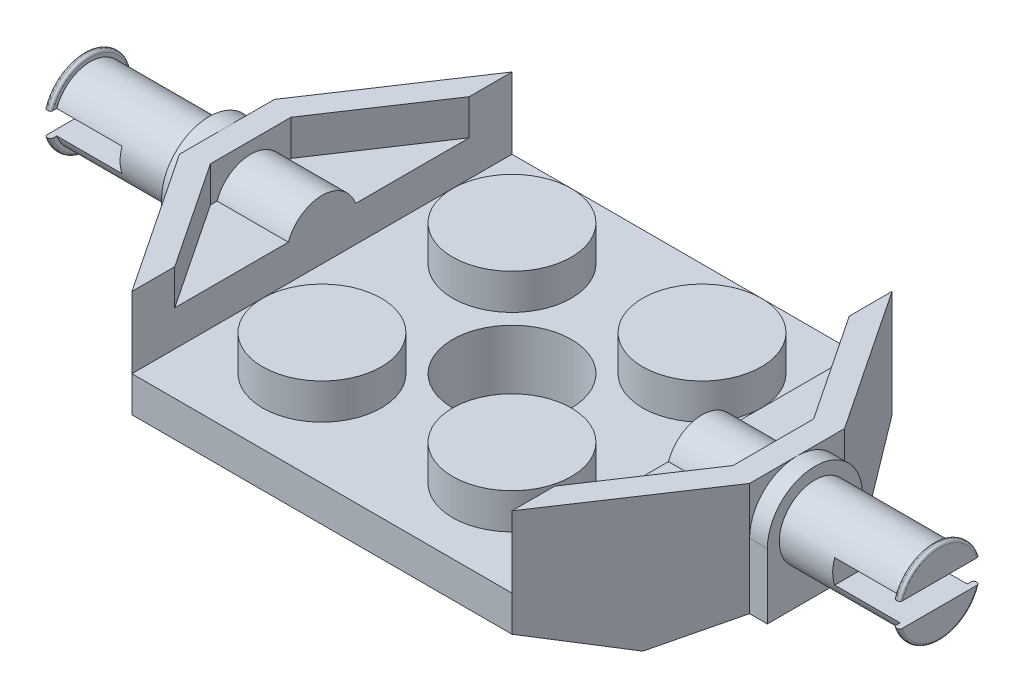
ISO-10303-21;
HEADER;
FILE_DESCRIPTION(('STEP AP214'),'2;1');
FILE_NAME('part.step','',(''),(''),'','','');
FILE_SCHEMA(('AUTOMOTIVE_DESIGN { 1 0 10303 214 1 1 1 1 }'));
ENDSEC;
DATA;
#1=APPLICATION_CONTEXT('core data for automotive mechanical design processes');
#2=APPLICATION_PROTOCOL_DEFINITION('international standard','automotive_design',2000,#1);
#3=PRODUCT_CONTEXT('',#1,'mechanical');
#4=PRODUCT('Part','Part','',(#3));
#5=PRODUCT_RELATED_PRODUCT_CATEGORY('part','',(#4));
#6=PRODUCT_DEFINITION_FORMATION('','',#4);
#7=PRODUCT_DEFINITION_CONTEXT('part definition',#1,'design');
#8=PRODUCT_DEFINITION('design','',#6,#7);
#9=PRODUCT_DEFINITION_SHAPE('','',#8);
#10=(LENGTH_UNIT() NAMED_UNIT(*) SI_UNIT(.MILLI.,.METRE.));
#11=(NAMED_UNIT(*) PLANE_ANGLE_UNIT() SI_UNIT($,.RADIAN.));
#12=(NAMED_UNIT(*) SI_UNIT($,.STERADIAN.) SOLID_ANGLE_UNIT());
#13=UNCERTAINTY_MEASURE_WITH_UNIT(LENGTH_MEASURE(1.E-05),#10,'distance_accuracy_value','');
#14=(GEOMETRIC_REPRESENTATION_CONTEXT(3) GLOBAL_UNCERTAINTY_ASSIGNED_CONTEXT((#13)) GLOBAL_UNIT_ASSIGNED_CONTEXT((#10,
#11,#12)) REPRESENTATION_CONTEXT('',''));
#15=CARTESIAN_POINT('',(0.,0.,0.));
#16=DIRECTION('',(0.,0.,1.));
#17=DIRECTION('',(1.,0.,0.));
#18=AXIS2_PLACEMENT_3D('',#15,#16,#17);
#19=CARTESIAN_POINT('',(-17.75,1.,-2.47895318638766E-13));
#20=DIRECTION('',(-1.,0.,0.));
#21=DIRECTION('',(0.,0.,1.));
#22=AXIS2_PLACEMENT_3D('',#19,#20,#21);
#23=CYLINDRICAL_SURFACE('',#22,1.75);
#24=DIRECTION('',(-1.,0.,0.));
#25=VECTOR('',#24,1.);
#26=CARTESIAN_POINT('',(-17.75,1.5,-1.67705098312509));
#27=LINE('',#26,#25);
#28=CARTESIAN_POINT('',(-17.9,1.5,-1.67705098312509));
#29=VERTEX_POINT('',#28);
#30=CARTESIAN_POINT('',(-17.85,1.5,-1.67705098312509));
#31=VERTEX_POINT('',#30);
#32=EDGE_CURVE('E617',#29,#31,#27,.F.);
#33=ORIENTED_EDGE('',*,*,#32,.F.);
#34=CARTESIAN_POINT('',(-17.9,1.,-2.49990208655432E-13));
#35=DIRECTION('',(1.,0.,0.));
#36=DIRECTION('',(0.,0.,-1.));
#37=AXIS2_PLACEMENT_3D('',#34,#35,#36);
#38=CIRCLE('',#37,1.75);
#39=CARTESIAN_POINT('',(-17.9,1.5,1.67705098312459));
#40=VERTEX_POINT('',#39);
#41=EDGE_CURVE('E1225',#29,#40,#38,.T.);
#42=ORIENTED_EDGE('',*,*,#41,.T.);
#43=DIRECTION('',(-1.,0.,0.));
#44=VECTOR('',#43,1.);
#45=CARTESIAN_POINT('',(-17.75,1.5,1.67705098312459));
#46=LINE('',#45,#44);
#47=CARTESIAN_POINT('',(-17.85,1.5,1.67705098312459));
#48=VERTEX_POINT('',#47);
#49=EDGE_CURVE('E629',#48,#40,#46,.T.);
#50=ORIENTED_EDGE('',*,*,#49,.F.);
#51=CARTESIAN_POINT('',(-17.85,1.,-2.4929191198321E-13));
#52=DIRECTION('',(-1.,0.,0.));
#53=DIRECTION('',(0.,0.,1.));
#54=AXIS2_PLACEMENT_3D('',#51,#52,#53);
#55=CIRCLE('',#54,1.75);
#56=EDGE_CURVE('E1227',#48,#31,#55,.T.);
#57=ORIENTED_EDGE('',*,*,#56,.T.);
#58=EDGE_LOOP('',(#33,#42,#50,#57));
#59=FACE_BOUND('',#58,.T.);
#60=ADVANCED_FACE('F32',(#59),#23,.T.);
#61=CARTESIAN_POINT('',(-17.75,1.,-2.47895318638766E-13));
#62=DIRECTION('',(-1.,0.,0.));
#63=DIRECTION('',(0.,0.,1.));
#64=AXIS2_PLACEMENT_3D('',#61,#62,#63);
#65=PLANE('',#64);
#66=DIRECTION('',(0.,0.,-1.));
#67=VECTOR('',#66,1.);
#68=CARTESIAN_POINT('',(-17.75,1.5,-2.47895318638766E-13));
#69=LINE('',#68,#67);
#70=CARTESIAN_POINT('',(-17.75,1.5,-1.41421356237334));
#71=VERTEX_POINT('',#70);
#72=CARTESIAN_POINT('',(-17.75,1.5,-1.57241851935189));
#73=VERTEX_POINT('',#72);
#74=EDGE_CURVE('E613',#71,#73,#69,.T.);
#75=ORIENTED_EDGE('',*,*,#74,.T.);
#76=CARTESIAN_POINT('',(-17.75,1.,-2.47895318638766E-13));
#77=DIRECTION('',(-1.,0.,0.));
#78=DIRECTION('',(0.,0.,1.));
#79=AXIS2_PLACEMENT_3D('',#76,#77,#78);
#80=CIRCLE('',#79,1.65);
#81=CARTESIAN_POINT('',(-17.75,1.5,1.57241851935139));
#82=VERTEX_POINT('',#81);
#83=EDGE_CURVE('E1236',#73,#82,#80,.F.);
#84=ORIENTED_EDGE('',*,*,#83,.T.);
#85=CARTESIAN_POINT('',(-17.75,1.5,1.41421356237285));
#86=VERTEX_POINT('',#85);
#87=EDGE_CURVE('E619',#82,#86,#69,.T.);
#88=ORIENTED_EDGE('',*,*,#87,.T.);
#89=CARTESIAN_POINT('',(-17.75,1.,-2.47895318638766E-13));
#90=DIRECTION('',(-1.,0.,0.));
#91=DIRECTION('',(0.,0.,1.));
#92=AXIS2_PLACEMENT_3D('',#89,#90,#91);
#93=CIRCLE('',#92,1.5);
#94=EDGE_CURVE('E668',#71,#86,#93,.F.);
#95=ORIENTED_EDGE('',*,*,#94,.F.);
#96=EDGE_LOOP('',(#75,#84,#88,#95));
#97=FACE_BOUND('',#96,.T.);
#98=ADVANCED_FACE('F1133',(#97),#65,.F.);
#99=CARTESIAN_POINT('',(-18.,1.,-2.51386801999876E-13));
#100=DIRECTION('',(1.,0.,0.));
#101=DIRECTION('',(0.,0.,-1.));
#102=AXIS2_PLACEMENT_3D('',#99,#100,#101);
#103=PLANE('',#102);
#104=DIRECTION('',(0.,0.,1.));
#105=VECTOR('',#104,1.);
#106=CARTESIAN_POINT('',(-18.,1.5,-2.51386801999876E-13));
#107=LINE('',#106,#105);
#108=CARTESIAN_POINT('',(-18.,1.5,-1.57241851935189));
#109=VERTEX_POINT('',#108);
#110=CARTESIAN_POINT('',(-18.,1.5,1.57241851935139));
#111=VERTEX_POINT('',#110);
#112=EDGE_CURVE('E747',#109,#111,#107,.T.);
#113=ORIENTED_EDGE('',*,*,#112,.T.);
#114=CARTESIAN_POINT('',(-18.,1.,-2.51386801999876E-13));
#115=DIRECTION('',(1.,0.,0.));
#116=DIRECTION('',(0.,0.,-1.));
#117=AXIS2_PLACEMENT_3D('',#114,#115,#116);
#118=CIRCLE('',#117,1.65);
#119=EDGE_CURVE('E1809',#111,#109,#118,.F.);
#120=ORIENTED_EDGE('',*,*,#119,.T.);
#121=EDGE_LOOP('',(#113,#120));
#122=FACE_BOUND('',#121,.T.);
#123=ADVANCED_FACE('F1117',(#122),#103,.F.);
#124=CARTESIAN_POINT('',(17.75,1.,1.23947659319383E-13));
#125=DIRECTION('',(1.,0.,0.));
#126=DIRECTION('',(0.,0.,-1.));
#127=AXIS2_PLACEMENT_3D('',#124,#125,#126);
#128=CYLINDRICAL_SURFACE('',#127,1.75);
#129=DIRECTION('',(1.,0.,0.));
#130=VECTOR('',#129,1.);
#131=CARTESIAN_POINT('',(17.75,1.5,-1.67705098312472));
#132=LINE('',#131,#130);
#133=CARTESIAN_POINT('',(17.85,1.5,-1.67705098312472));
#134=VERTEX_POINT('',#133);
#135=CARTESIAN_POINT('',(17.9,1.5,-1.67705098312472));
#136=VERTEX_POINT('',#135);
#137=EDGE_CURVE('E662',#134,#136,#132,.T.);
#138=ORIENTED_EDGE('',*,*,#137,.F.);
#139=CARTESIAN_POINT('',(17.85,1.,1.24645955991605E-13));
#140=DIRECTION('',(1.,0.,0.));
#141=DIRECTION('',(0.,0.,-1.));
#142=AXIS2_PLACEMENT_3D('',#139,#140,#141);
#143=CIRCLE('',#142,1.75);
#144=CARTESIAN_POINT('',(17.85,1.5,1.67705098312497));
#145=VERTEX_POINT('',#144);
#146=EDGE_CURVE('E1243',#134,#145,#143,.T.);
#147=ORIENTED_EDGE('',*,*,#146,.T.);
#148=DIRECTION('',(1.,0.,0.));
#149=VECTOR('',#148,1.);
#150=CARTESIAN_POINT('',(17.75,1.5,1.67705098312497));
#151=LINE('',#150,#149);
#152=CARTESIAN_POINT('',(17.9,1.5,1.67705098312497));
#153=VERTEX_POINT('',#152);
#154=EDGE_CURVE('E656',#153,#145,#151,.F.);
#155=ORIENTED_EDGE('',*,*,#154,.F.);
#156=CARTESIAN_POINT('',(17.9,1.,1.24995104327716E-13));
#157=DIRECTION('',(-1.,0.,0.));
#158=DIRECTION('',(0.,0.,1.));
#159=AXIS2_PLACEMENT_3D('',#156,#157,#158);
#160=CIRCLE('',#159,1.75);
#161=EDGE_CURVE('E1238',#153,#136,#160,.T.);
#162=ORIENTED_EDGE('',*,*,#161,.T.);
#163=EDGE_LOOP('',(#138,#147,#155,#162));
#164=FACE_BOUND('',#163,.T.);
#165=ADVANCED_FACE('F1122',(#164),#128,.T.);
#166=CARTESIAN_POINT('',(17.75,1.,1.23947659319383E-13));
#167=DIRECTION('',(1.,0.,0.));
#168=DIRECTION('',(0.,0.,-1.));
#169=AXIS2_PLACEMENT_3D('',#166,#167,#168);
#170=PLANE('',#169);
#171=DIRECTION('',(0.,0.,1.));
#172=VECTOR('',#171,1.);
#173=CARTESIAN_POINT('',(17.75,1.5,1.23947659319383E-13));
#174=LINE('',#173,#172);
#175=CARTESIAN_POINT('',(17.75,1.5,1.41421356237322));
#176=VERTEX_POINT('',#175);
#177=CARTESIAN_POINT('',(17.75,1.5,1.57241851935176));
#178=VERTEX_POINT('',#177);
#179=EDGE_CURVE('E653',#176,#178,#174,.T.);
#180=ORIENTED_EDGE('',*,*,#179,.T.);
#181=CARTESIAN_POINT('',(17.75,1.,1.23947659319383E-13));
#182=DIRECTION('',(1.,0.,0.));
#183=DIRECTION('',(0.,0.,-1.));
#184=AXIS2_PLACEMENT_3D('',#181,#182,#183);
#185=CIRCLE('',#184,1.65);
#186=CARTESIAN_POINT('',(17.75,1.5,-1.57241851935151));
#187=VERTEX_POINT('',#186);
#188=EDGE_CURVE('E1198',#178,#187,#185,.F.);
#189=ORIENTED_EDGE('',*,*,#188,.T.);
#190=CARTESIAN_POINT('',(17.75,1.5,-1.41421356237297));
#191=VERTEX_POINT('',#190);
#192=EDGE_CURVE('E657',#187,#191,#174,.T.);
#193=ORIENTED_EDGE('',*,*,#192,.T.);
#194=CARTESIAN_POINT('',(17.75,1.,1.23947659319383E-13));
#195=DIRECTION('',(1.,0.,0.));
#196=DIRECTION('',(0.,0.,-1.));
#197=AXIS2_PLACEMENT_3D('',#194,#195,#196);
#198=CIRCLE('',#197,1.5);
#199=EDGE_CURVE('E735',#176,#191,#198,.F.);
#200=ORIENTED_EDGE('',*,*,#199,.F.);
#201=EDGE_LOOP('',(#180,#189,#193,#200));
#202=FACE_BOUND('',#201,.T.);
#203=ADVANCED_FACE('F1126',(#202),#170,.F.);
#204=CARTESIAN_POINT('',(18.,1.,1.25693400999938E-13));
#205=DIRECTION('',(-1.,0.,0.));
#206=DIRECTION('',(0.,0.,1.));
#207=AXIS2_PLACEMENT_3D('',#204,#205,#206);
#208=PLANE('',#207);
#209=DIRECTION('',(0.,0.,-1.));
#210=VECTOR('',#209,1.);
#211=CARTESIAN_POINT('',(18.,1.5,1.25693400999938E-13));
#212=LINE('',#211,#210);
#213=CARTESIAN_POINT('',(18.,1.5,1.57241851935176));
#214=VERTEX_POINT('',#213);
#215=CARTESIAN_POINT('',(18.,1.5,-1.57241851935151));
#216=VERTEX_POINT('',#215);
#217=EDGE_CURVE('E738',#214,#216,#212,.T.);
#218=ORIENTED_EDGE('',*,*,#217,.T.);
#219=CARTESIAN_POINT('',(18.,1.,1.25693400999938E-13));
#220=DIRECTION('',(-1.,0.,0.));
#221=DIRECTION('',(0.,0.,1.));
#222=AXIS2_PLACEMENT_3D('',#219,#220,#221);
#223=CIRCLE('',#222,1.65);
#224=EDGE_CURVE('E1200',#216,#214,#223,.F.);
#225=ORIENTED_EDGE('',*,*,#224,.T.);
#226=EDGE_LOOP('',(#218,#225));
#227=FACE_BOUND('',#226,.T.);
#228=ADVANCED_FACE('F1091',(#227),#208,.F.);
#229=CARTESIAN_POINT('',(-18.,1.,-2.51386801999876E-13));
#230=DIRECTION('',(1.,0.,0.));
#231=DIRECTION('',(0.,0.,-1.));
#232=AXIS2_PLACEMENT_3D('',#229,#230,#231);
#233=CYLINDRICAL_SURFACE('',#232,1.5);
#234=DIRECTION('',(1.,0.,0.));
#235=VECTOR('',#234,1.);
#236=CARTESIAN_POINT('',(-18.,1.5,-1.41421356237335));
#237=LINE('',#236,#235);
#238=CARTESIAN_POINT('',(-15.,1.5,-1.4142135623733));
#239=VERTEX_POINT('',#238);
#240=EDGE_CURVE('E627',#71,#239,#237,.T.);
#241=ORIENTED_EDGE('',*,*,#240,.F.);
#242=ORIENTED_EDGE('',*,*,#94,.T.);
#243=DIRECTION('',(1.,0.,0.));
#244=VECTOR('',#243,1.);
#245=CARTESIAN_POINT('',(-18.,1.5,1.41421356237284));
#246=LINE('',#245,#244);
#247=CARTESIAN_POINT('',(-15.,1.5,1.41421356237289));
#248=VERTEX_POINT('',#247);
#249=EDGE_CURVE('E632',#248,#86,#246,.F.);
#250=ORIENTED_EDGE('',*,*,#249,.F.);
#251=CARTESIAN_POINT('',(-15.,1.,-2.09489001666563E-13));
#252=DIRECTION('',(1.,0.,0.));
#253=DIRECTION('',(0.,0.,-1.));
#254=AXIS2_PLACEMENT_3D('',#251,#252,#253);
#255=CIRCLE('',#254,1.5);
#256=CARTESIAN_POINT('',(-15.,0.5,1.41421356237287));
#257=VERTEX_POINT('',#256);
#258=EDGE_CURVE('E597',#257,#248,#255,.F.);
#259=ORIENTED_EDGE('',*,*,#258,.F.);
#260=DIRECTION('',(1.,0.,0.));
#261=VECTOR('',#260,1.);
#262=CARTESIAN_POINT('',(-18.,0.5,1.41421356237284));
#263=LINE('',#262,#261);
#264=CARTESIAN_POINT('',(-17.75,0.5,1.41421356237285));
#265=VERTEX_POINT('',#264);
#266=EDGE_CURVE('E607',#265,#257,#263,.T.);
#267=ORIENTED_EDGE('',*,*,#266,.F.);
#268=CARTESIAN_POINT('',(-17.75,0.5,-1.41421356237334));
#269=VERTEX_POINT('',#268);
#270=EDGE_CURVE('E612',#265,#269,#93,.F.);
#271=ORIENTED_EDGE('',*,*,#270,.T.);
#272=DIRECTION('',(1.,0.,0.));
#273=VECTOR('',#272,1.);
#274=CARTESIAN_POINT('',(-18.,0.5,-1.41421356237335));
#275=LINE('',#274,#273);
#276=CARTESIAN_POINT('',(-15.,0.5,-1.41421356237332));
#277=VERTEX_POINT('',#276);
#278=EDGE_CURVE('E604',#277,#269,#275,.F.);
#279=ORIENTED_EDGE('',*,*,#278,.F.);
#280=EDGE_CURVE('E586',#239,#277,#255,.F.);
#281=ORIENTED_EDGE('',*,*,#280,.F.);
#282=EDGE_LOOP('',(#241,#242,#250,#259,#267,#271,#279,#281));
#283=FACE_BOUND('',#282,.T.);
#284=CARTESIAN_POINT('',(-12.75,1.,-1.78065651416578E-13));
#285=DIRECTION('',(-1.,0.,0.));
#286=DIRECTION('',(0.,0.,1.));
#287=AXIS2_PLACEMENT_3D('',#284,#285,#286);
#288=CIRCLE('',#287,1.5);
#289=CARTESIAN_POINT('',(-12.75,1.,1.49999999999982));
#290=VERTEX_POINT('',#289);
#291=EDGE_CURVE('E729',#290,#290,#288,.T.);
#292=ORIENTED_EDGE('',*,*,#291,.T.);
#293=EDGE_LOOP('',(#292));
#294=FACE_BOUND('',#293,.T.);
#295=ADVANCED_FACE('F609',(#283,#294),#233,.T.);
#296=CARTESIAN_POINT('',(18.,1.,1.25693400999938E-13));
#297=DIRECTION('',(-1.,0.,0.));
#298=DIRECTION('',(0.,0.,1.));
#299=AXIS2_PLACEMENT_3D('',#296,#297,#298);
#300=CYLINDRICAL_SURFACE('',#299,1.5);
#301=DIRECTION('',(-1.,0.,0.));
#302=VECTOR('',#301,1.);
#303=CARTESIAN_POINT('',(18.,1.5,1.41421356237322));
#304=LINE('',#303,#302);
#305=CARTESIAN_POINT('',(15.,1.5,1.4142135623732));
#306=VERTEX_POINT('',#305);
#307=EDGE_CURVE('E660',#176,#306,#304,.T.);
#308=ORIENTED_EDGE('',*,*,#307,.F.);
#309=ORIENTED_EDGE('',*,*,#199,.T.);
#310=DIRECTION('',(-1.,0.,0.));
#311=VECTOR('',#310,1.);
#312=CARTESIAN_POINT('',(18.,1.5,-1.41421356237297));
#313=LINE('',#312,#311);
#314=CARTESIAN_POINT('',(15.,1.5,-1.41421356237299));
#315=VERTEX_POINT('',#314);
#316=EDGE_CURVE('E665',#315,#191,#313,.F.);
#317=ORIENTED_EDGE('',*,*,#316,.F.);
#318=CARTESIAN_POINT('',(15.,1.,1.04744500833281E-13));
#319=DIRECTION('',(-1.,0.,0.));
#320=DIRECTION('',(0.,0.,1.));
#321=AXIS2_PLACEMENT_3D('',#318,#319,#320);
#322=CIRCLE('',#321,1.5);
#323=CARTESIAN_POINT('',(15.,0.5,-1.41421356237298));
#324=VERTEX_POINT('',#323);
#325=EDGE_CURVE('E741',#324,#315,#322,.F.);
#326=ORIENTED_EDGE('',*,*,#325,.F.);
#327=DIRECTION('',(-1.,0.,0.));
#328=VECTOR('',#327,1.);
#329=CARTESIAN_POINT('',(18.,0.5,-1.41421356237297));
#330=LINE('',#329,#328);
#331=CARTESIAN_POINT('',(17.75,0.5,-1.41421356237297));
#332=VERTEX_POINT('',#331);
#333=EDGE_CURVE('E646',#332,#324,#330,.T.);
#334=ORIENTED_EDGE('',*,*,#333,.F.);
#335=CARTESIAN_POINT('',(17.75,0.5,1.41421356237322));
#336=VERTEX_POINT('',#335);
#337=EDGE_CURVE('E673',#332,#336,#198,.F.);
#338=ORIENTED_EDGE('',*,*,#337,.T.);
#339=DIRECTION('',(-1.,0.,0.));
#340=VECTOR('',#339,1.);
#341=CARTESIAN_POINT('',(18.,0.5,1.41421356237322));
#342=LINE('',#341,#340);
#343=CARTESIAN_POINT('',(15.,0.5,1.41421356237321));
#344=VERTEX_POINT('',#343);
#345=EDGE_CURVE('E650',#344,#336,#342,.F.);
#346=ORIENTED_EDGE('',*,*,#345,.F.);
#347=EDGE_CURVE('E743',#306,#344,#322,.F.);
#348=ORIENTED_EDGE('',*,*,#347,.F.);
#349=EDGE_LOOP('',(#308,#309,#317,#326,#334,#338,#346,#348));
#350=FACE_BOUND('',#349,.T.);
#351=CARTESIAN_POINT('',(12.75,1.,0.));
#352=DIRECTION('',(1.,0.,0.));
#353=DIRECTION('',(0.,0.,-1.));
#354=AXIS2_PLACEMENT_3D('',#351,#352,#353);
#355=CIRCLE('',#354,1.5);
#356=CARTESIAN_POINT('',(12.75,1.,-1.49999999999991));
#357=VERTEX_POINT('',#356);
#358=EDGE_CURVE('E2575',#357,#357,#355,.T.);
#359=ORIENTED_EDGE('',*,*,#358,.T.);
#360=EDGE_LOOP('',(#359));
#361=FACE_BOUND('',#360,.T.);
#362=ADVANCED_FACE('F1080',(#350,#361),#300,.T.);
#363=CARTESIAN_POINT('',(-12.2043689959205,0.25,0.00234677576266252));
#364=DIRECTION('',(0.,-1.,0.));
#365=DIRECTION('',(0.,0.,-1.));
#366=AXIS2_PLACEMENT_3D('',#363,#364,#365);
#367=PLANE('',#366);
#368=DIRECTION('',(1.,0.,0.));
#369=VECTOR('',#368,1.);
#370=CARTESIAN_POINT('',(-18.,0.25,-1.29903810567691));
#371=LINE('',#370,#369);
#372=CARTESIAN_POINT('',(-11.,0.25,-1.29903810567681));
#373=VERTEX_POINT('',#372);
#374=CARTESIAN_POINT('',(-9.,0.25,-1.29903810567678));
#375=VERTEX_POINT('',#374);
#376=EDGE_CURVE('E678',#373,#375,#371,.T.);
#377=ORIENTED_EDGE('',*,*,#376,.F.);
#378=DIRECTION('',(0.,0.,-1.));
#379=VECTOR('',#378,1.);
#380=CARTESIAN_POINT('',(-11.,0.25,1.80890026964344));
#381=LINE('',#380,#379);
#382=CARTESIAN_POINT('',(-11.,0.25,-1.80420671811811));
#383=VERTEX_POINT('',#382);
#384=EDGE_CURVE('E2088',#373,#383,#381,.T.);
#385=ORIENTED_EDGE('',*,*,#384,.T.);
#386=DIRECTION('',(0.55470019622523,0.,-0.832050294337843));
#387=VECTOR('',#386,1.);
#388=CARTESIAN_POINT('',(-11.,0.25,-1.80420671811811));
#389=LINE('',#388,#387);
#390=CARTESIAN_POINT('',(-9.,0.25,-4.80420671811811));
#391=VERTEX_POINT('',#390);
#392=EDGE_CURVE('E2100',#383,#391,#389,.T.);
#393=ORIENTED_EDGE('',*,*,#392,.T.);
#394=DIRECTION('',(0.,0.,-1.));
#395=VECTOR('',#394,1.);
#396=CARTESIAN_POINT('',(-9.,0.25,-4.80420671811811));
#397=LINE('',#396,#395);
#398=EDGE_CURVE('E2090',#375,#391,#397,.T.);
#399=ORIENTED_EDGE('',*,*,#398,.F.);
#400=EDGE_LOOP('',(#377,#385,#393,#399));
#401=FACE_BOUND('',#400,.T.);
#402=ADVANCED_FACE('F994',(#401),#367,.T.);
#403=CARTESIAN_POINT('',(-11.,1.5,1.69722436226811));
#404=DIRECTION('',(0.,1.,0.));
#405=DIRECTION('',(0.,0.,1.));
#406=AXIS2_PLACEMENT_3D('',#403,#404,#405);
#407=PLANE('',#406);
#408=DIRECTION('',(1.,0.,0.));
#409=VECTOR('',#408,1.);
#410=CARTESIAN_POINT('',(-18.,1.5,1.41421356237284));
#411=LINE('',#410,#409);
#412=CARTESIAN_POINT('',(-11.,1.5,1.41421356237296));
#413=VERTEX_POINT('',#412);
#414=CARTESIAN_POINT('',(-8.,1.5,1.41421356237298));
#415=VERTEX_POINT('',#414);
#416=EDGE_CURVE('E688',#413,#415,#411,.T.);
#417=ORIENTED_EDGE('',*,*,#416,.F.);
#418=DIRECTION('',(0.,0.,1.));
#419=VECTOR('',#418,1.);
#420=CARTESIAN_POINT('',(-11.,1.5,-1.69722436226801));
#421=LINE('',#420,#419);
#422=CARTESIAN_POINT('',(-11.,1.5,1.69722436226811));
#423=VERTEX_POINT('',#422);
#424=EDGE_CURVE('E2154',#413,#423,#421,.T.);
#425=ORIENTED_EDGE('',*,*,#424,.T.);
#426=DIRECTION('',(0.554700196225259,0.,0.832050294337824));
#427=VECTOR('',#426,1.);
#428=CARTESIAN_POINT('',(-11.,1.5,1.69722436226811));
#429=LINE('',#428,#427);
#430=CARTESIAN_POINT('',(-8.,1.5,6.19722436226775));
#431=VERTEX_POINT('',#430);
#432=EDGE_CURVE('E2153',#423,#431,#429,.T.);
#433=ORIENTED_EDGE('',*,*,#432,.T.);
#434=DIRECTION('',(0.,0.,-1.));
#435=VECTOR('',#434,1.);
#436=CARTESIAN_POINT('',(-8.,1.5,-6.19722436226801));
#437=LINE('',#436,#435);
#438=EDGE_CURVE('E2158',#431,#415,#437,.T.);
#439=ORIENTED_EDGE('',*,*,#438,.T.);
#440=EDGE_LOOP('',(#417,#425,#433,#439));
#441=FACE_BOUND('',#440,.T.);
#442=ADVANCED_FACE('F956',(#441),#407,.T.);
#443=CARTESIAN_POINT('',(-12.,3.,2.));
#444=DIRECTION('',(-1.,0.,0.));
#445=DIRECTION('',(0.,0.,1.));
#446=AXIS2_PLACEMENT_3D('',#443,#444,#445);
#447=PLANE('',#446);
#448=CARTESIAN_POINT('',(-12.,0.999999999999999,-1.68458563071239E-13));
#449=DIRECTION('',(-1.,0.,0.));
#450=DIRECTION('',(0.,0.,1.));
#451=AXIS2_PLACEMENT_3D('',#448,#449,#450);
#452=CIRCLE('',#451,2.);
#453=CARTESIAN_POINT('',(-12.,0.999999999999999,2.));
#454=VERTEX_POINT('',#453);
#455=CARTESIAN_POINT('',(-12.,3.,-1.68458563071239E-13));
#456=VERTEX_POINT('',#455);
#457=EDGE_CURVE('E712',#454,#456,#452,.T.);
#458=ORIENTED_EDGE('',*,*,#457,.F.);
#459=DIRECTION('',(0.,-1.,0.));
#460=VECTOR('',#459,1.);
#461=CARTESIAN_POINT('',(-12.,3.,2.));
#462=LINE('',#461,#460);
#463=CARTESIAN_POINT('',(-12.,3.,2.));
#464=VERTEX_POINT('',#463);
#465=EDGE_CURVE('E2219',#464,#454,#462,.T.);
#466=ORIENTED_EDGE('',*,*,#465,.F.);
#467=DIRECTION('',(0.,0.,-1.));
#468=VECTOR('',#467,1.);
#469=CARTESIAN_POINT('',(-12.,3.,2.));
#470=LINE('',#469,#468);
#471=EDGE_CURVE('E2209',#464,#456,#470,.T.);
#472=ORIENTED_EDGE('',*,*,#471,.T.);
#473=EDGE_LOOP('',(#458,#466,#472));
#474=FACE_BOUND('',#473,.T.);
#475=ADVANCED_FACE('F909',(#474),#447,.T.);
#476=CARTESIAN_POINT('',(12.2043689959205,0.25,-0.00234677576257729));
#477=DIRECTION('',(0.,-1.,0.));
#478=DIRECTION('',(0.,0.,1.));
#479=AXIS2_PLACEMENT_3D('',#476,#477,#478);
#480=PLANE('',#479);
#481=DIRECTION('',(-1.,0.,0.));
#482=VECTOR('',#481,1.);
#483=CARTESIAN_POINT('',(18.,0.25,1.29903810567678));
#484=LINE('',#483,#482);
#485=CARTESIAN_POINT('',(11.,0.25,1.29903810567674));
#486=VERTEX_POINT('',#485);
#487=CARTESIAN_POINT('',(8.99999999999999,0.25,1.29903810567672));
#488=VERTEX_POINT('',#487);
#489=EDGE_CURVE('E2521',#486,#488,#484,.T.);
#490=ORIENTED_EDGE('',*,*,#489,.F.);
#491=DIRECTION('',(0.,0.,1.));
#492=VECTOR('',#491,1.);
#493=CARTESIAN_POINT('',(11.,0.25,-1.80890026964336));
#494=LINE('',#493,#492);
#495=CARTESIAN_POINT('',(11.,0.25,1.80420671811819));
#496=VERTEX_POINT('',#495);
#497=EDGE_CURVE('E2501',#486,#496,#494,.T.);
#498=ORIENTED_EDGE('',*,*,#497,.T.);
#499=DIRECTION('',(-0.554700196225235,0.,0.83205029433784));
#500=VECTOR('',#499,1.);
#501=CARTESIAN_POINT('',(11.,0.25,1.80420671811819));
#502=LINE('',#501,#500);
#503=CARTESIAN_POINT('',(8.99999999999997,0.25,4.80420671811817));
#504=VERTEX_POINT('',#503);
#505=EDGE_CURVE('E2427',#496,#504,#502,.T.);
#506=ORIENTED_EDGE('',*,*,#505,.T.);
#507=DIRECTION('',(0.,0.,1.));
#508=VECTOR('',#507,1.);
#509=CARTESIAN_POINT('',(8.99999999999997,0.25,4.80420671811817));
#510=LINE('',#509,#508);
#511=EDGE_CURVE('E2483',#488,#504,#510,.T.);
#512=ORIENTED_EDGE('',*,*,#511,.F.);
#513=EDGE_LOOP('',(#490,#498,#506,#512));
#514=FACE_BOUND('',#513,.T.);
#515=ADVANCED_FACE('F1021',(#514),#480,.T.);
#516=CARTESIAN_POINT('',(11.,1.5,-1.69722436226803));
#517=DIRECTION('',(0.,1.,0.));
#518=DIRECTION('',(0.,0.,-1.));
#519=AXIS2_PLACEMENT_3D('',#516,#517,#518);
#520=PLANE('',#519);
#521=DIRECTION('',(-1.,0.,0.));
#522=VECTOR('',#521,1.);
#523=CARTESIAN_POINT('',(18.,1.5,-1.41421356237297));
#524=LINE('',#523,#522);
#525=CARTESIAN_POINT('',(11.,1.5,-1.41421356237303));
#526=VERTEX_POINT('',#525);
#527=CARTESIAN_POINT('',(8.00000000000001,1.5,-1.41421356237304));
#528=VERTEX_POINT('',#527);
#529=EDGE_CURVE('E2535',#526,#528,#524,.T.);
#530=ORIENTED_EDGE('',*,*,#529,.F.);
#531=DIRECTION('',(0.,0.,-1.));
#532=VECTOR('',#531,1.);
#533=CARTESIAN_POINT('',(11.,1.5,1.69722436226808));
#534=LINE('',#533,#532);
#535=CARTESIAN_POINT('',(11.,1.5,-1.69722436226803));
#536=VERTEX_POINT('',#535);
#537=EDGE_CURVE('E2124',#526,#536,#534,.T.);
#538=ORIENTED_EDGE('',*,*,#537,.T.);
#539=DIRECTION('',(-0.554700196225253,0.,-0.832050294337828));
#540=VECTOR('',#539,1.);
#541=CARTESIAN_POINT('',(11.,1.5,-1.69722436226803));
#542=LINE('',#541,#540);
#543=CARTESIAN_POINT('',(8.00000000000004,1.5,-6.1972243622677));
#544=VERTEX_POINT('',#543);
#545=EDGE_CURVE('E2123',#536,#544,#542,.T.);
#546=ORIENTED_EDGE('',*,*,#545,.T.);
#547=DIRECTION('',(0.,0.,1.));
#548=VECTOR('',#547,1.);
#549=CARTESIAN_POINT('',(7.99999999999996,1.5,6.19722436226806));
#550=LINE('',#549,#548);
#551=EDGE_CURVE('E2128',#544,#528,#550,.T.);
#552=ORIENTED_EDGE('',*,*,#551,.T.);
#553=EDGE_LOOP('',(#530,#538,#546,#552));
#554=FACE_BOUND('',#553,.T.);
#555=ADVANCED_FACE('F973',(#554),#520,.T.);
#556=CARTESIAN_POINT('',(12.,3.,-1.99999999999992));
#557=DIRECTION('',(1.,0.,0.));
#558=DIRECTION('',(0.,0.,-1.));
#559=AXIS2_PLACEMENT_3D('',#556,#557,#558);
#560=PLANE('',#559);
#561=CARTESIAN_POINT('',(12.,0.999999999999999,0.));
#562=DIRECTION('',(1.,0.,0.));
#563=DIRECTION('',(0.,0.,-1.));
#564=AXIS2_PLACEMENT_3D('',#561,#562,#563);
#565=CIRCLE('',#564,2.);
#566=CARTESIAN_POINT('',(12.,0.999999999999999,-1.99999999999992));
#567=VERTEX_POINT('',#566);
#568=CARTESIAN_POINT('',(12.,3.,0.));
#569=VERTEX_POINT('',#568);
#570=EDGE_CURVE('E2558',#567,#569,#565,.T.);
#571=ORIENTED_EDGE('',*,*,#570,.F.);
#572=DIRECTION('',(0.,-1.,0.));
#573=VECTOR('',#572,1.);
#574=CARTESIAN_POINT('',(12.,3.,-1.99999999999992));
#575=LINE('',#574,#573);
#576=CARTESIAN_POINT('',(12.,3.,-1.99999999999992));
#577=VERTEX_POINT('',#576);
#578=EDGE_CURVE('E2193',#577,#567,#575,.T.);
#579=ORIENTED_EDGE('',*,*,#578,.F.);
#580=DIRECTION('',(0.,0.,1.));
#581=VECTOR('',#580,1.);
#582=CARTESIAN_POINT('',(12.,3.,-1.99999999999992));
#583=LINE('',#582,#581);
#584=EDGE_CURVE('E2183',#577,#569,#583,.T.);
#585=ORIENTED_EDGE('',*,*,#584,.T.);
#586=EDGE_LOOP('',(#571,#579,#585));
#587=FACE_BOUND('',#586,.T.);
#588=ADVANCED_FACE('F813',(#587),#560,.T.);
#589=CARTESIAN_POINT('',(-8.,-3.,8.));
#590=DIRECTION('',(0.,1.,0.));
#591=DIRECTION('',(0.,0.,1.));
#592=AXIS2_PLACEMENT_3D('',#589,#590,#591);
#593=PLANE('',#592);
#594=CARTESIAN_POINT('',(0.,-3.,0.));
#595=DIRECTION('',(0.,-1.,0.));
#596=DIRECTION('',(0.,0.,-1.));
#597=AXIS2_PLACEMENT_3D('',#594,#595,#596);
#598=CIRCLE('',#597,2.5);
#599=CARTESIAN_POINT('',(0.,-3.,-2.5));
#600=VERTEX_POINT('',#599);
#601=EDGE_CURVE('E2256',#600,#600,#598,.T.);
#602=ORIENTED_EDGE('',*,*,#601,.F.);
#603=EDGE_LOOP('',(#602));
#604=FACE_BOUND('',#603,.T.);
#605=DIRECTION('',(0.,0.,-1.));
#606=VECTOR('',#605,1.);
#607=CARTESIAN_POINT('',(8.00000000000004,-3.,-6.30890026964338));
#608=LINE('',#607,#606);
#609=CARTESIAN_POINT('',(7.99999999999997,-3.,3.75000000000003));
#610=VERTEX_POINT('',#609);
#611=CARTESIAN_POINT('',(8.00000000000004,-3.,-3.74999999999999));
#612=VERTEX_POINT('',#611);
#613=EDGE_CURVE('E2399',#610,#612,#608,.T.);
#614=ORIENTED_EDGE('',*,*,#613,.F.);
#615=DIRECTION('',(1.,0.,0.));
#616=VECTOR('',#615,1.);
#617=CARTESIAN_POINT('',(-12.0000000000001,-3.,3.74999999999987));
#618=LINE('',#617,#616);
#619=CARTESIAN_POINT('',(7.,-3.,3.75));
#620=VERTEX_POINT('',#619);
#621=EDGE_CURVE('E2645',#620,#610,#618,.T.);
#622=ORIENTED_EDGE('',*,*,#621,.F.);
#623=DIRECTION('',(0.,0.,1.));
#624=VECTOR('',#623,1.);
#625=CARTESIAN_POINT('',(7.,-3.,8.));
#626=LINE('',#625,#624);
#627=CARTESIAN_POINT('',(7.,-3.,0.5));
#628=VERTEX_POINT('',#627);
#629=EDGE_CURVE('E2307',#628,#620,#626,.T.);
#630=ORIENTED_EDGE('',*,*,#629,.F.);
#631=DIRECTION('',(1.,0.,0.));
#632=VECTOR('',#631,1.);
#633=CARTESIAN_POINT('',(2.83118791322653,-3.,0.5));
#634=LINE('',#633,#632);
#635=CARTESIAN_POINT('',(2.83118791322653,-3.,0.5));
#636=VERTEX_POINT('',#635);
#637=EDGE_CURVE('E2330',#636,#628,#634,.T.);
#638=ORIENTED_EDGE('',*,*,#637,.F.);
#639=CARTESIAN_POINT('',(0.,-3.,0.));
#640=DIRECTION('',(0.,1.,0.));
#641=DIRECTION('',(0.,0.,-1.));
#642=AXIS2_PLACEMENT_3D('',#639,#640,#641);
#643=CIRCLE('',#642,2.875);
#644=CARTESIAN_POINT('',(-2.83118791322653,-3.,0.500000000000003));
#645=VERTEX_POINT('',#644);
#646=EDGE_CURVE('E2327',#645,#636,#643,.T.);
#647=ORIENTED_EDGE('',*,*,#646,.F.);
#648=DIRECTION('',(1.,0.,0.));
#649=VECTOR('',#648,1.);
#650=CARTESIAN_POINT('',(-2.83118791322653,-3.,0.5));
#651=LINE('',#650,#649);
#652=CARTESIAN_POINT('',(-7.,-3.,0.5));
#653=VERTEX_POINT('',#652);
#654=EDGE_CURVE('E2324',#653,#645,#651,.T.);
#655=ORIENTED_EDGE('',*,*,#654,.F.);
#656=DIRECTION('',(0.,0.,-1.));
#657=VECTOR('',#656,1.);
#658=CARTESIAN_POINT('',(-7.,-3.,8.));
#659=LINE('',#658,#657);
#660=CARTESIAN_POINT('',(-7.,-3.,3.7499999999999));
#661=VERTEX_POINT('',#660);
#662=EDGE_CURVE('E2296',#661,#653,#659,.T.);
#663=ORIENTED_EDGE('',*,*,#662,.F.);
#664=CARTESIAN_POINT('',(-8.,-3.,3.7499999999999));
#665=VERTEX_POINT('',#664);
#666=EDGE_CURVE('E2644',#665,#661,#618,.T.);
#667=ORIENTED_EDGE('',*,*,#666,.F.);
#668=DIRECTION('',(0.,0.,1.));
#669=VECTOR('',#668,1.);
#670=CARTESIAN_POINT('',(-8.,-3.,6.30890026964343));
#671=LINE('',#670,#669);
#672=CARTESIAN_POINT('',(-8.,-3.,-3.75000000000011));
#673=VERTEX_POINT('',#672);
#674=EDGE_CURVE('E2101',#673,#665,#671,.T.);
#675=ORIENTED_EDGE('',*,*,#674,.F.);
#676=DIRECTION('',(1.,0.,0.));
#677=VECTOR('',#676,1.);
#678=CARTESIAN_POINT('',(-12.,-3.,-3.75000000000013));
#679=LINE('',#678,#677);
#680=CARTESIAN_POINT('',(-7.,-3.,-3.7500000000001));
#681=VERTEX_POINT('',#680);
#682=EDGE_CURVE('E2647',#673,#681,#679,.T.);
#683=ORIENTED_EDGE('',*,*,#682,.T.);
#684=DIRECTION('',(0.,0.,-1.));
#685=VECTOR('',#684,1.);
#686=CARTESIAN_POINT('',(-7.,-3.,-0.5));
#687=LINE('',#686,#685);
#688=CARTESIAN_POINT('',(-7.,-3.,-0.5));
#689=VERTEX_POINT('',#688);
#690=EDGE_CURVE('E2266',#689,#681,#687,.T.);
#691=ORIENTED_EDGE('',*,*,#690,.F.);
#692=DIRECTION('',(-1.,0.,0.));
#693=VECTOR('',#692,1.);
#694=CARTESIAN_POINT('',(-2.83118791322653,-3.,-0.5));
#695=LINE('',#694,#693);
#696=CARTESIAN_POINT('',(-2.83118791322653,-3.,-0.5));
#697=VERTEX_POINT('',#696);
#698=EDGE_CURVE('E2289',#697,#689,#695,.T.);
#699=ORIENTED_EDGE('',*,*,#698,.F.);
#700=CARTESIAN_POINT('',(0.,-3.,0.));
#701=DIRECTION('',(0.,1.,0.));
#702=DIRECTION('',(0.,0.,-1.));
#703=AXIS2_PLACEMENT_3D('',#700,#701,#702);
#704=CIRCLE('',#703,2.875);
#705=CARTESIAN_POINT('',(2.83118791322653,-3.,-0.5));
#706=VERTEX_POINT('',#705);
#707=EDGE_CURVE('E2286',#706,#697,#704,.T.);
#708=ORIENTED_EDGE('',*,*,#707,.F.);
#709=DIRECTION('',(-1.,0.,0.));
#710=VECTOR('',#709,1.);
#711=CARTESIAN_POINT('',(2.83118791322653,-3.,-0.5));
#712=LINE('',#711,#710);
#713=CARTESIAN_POINT('',(7.,-3.,-0.499999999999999));
#714=VERTEX_POINT('',#713);
#715=EDGE_CURVE('E2283',#714,#706,#712,.T.);
#716=ORIENTED_EDGE('',*,*,#715,.F.);
#717=DIRECTION('',(0.,0.,1.));
#718=VECTOR('',#717,1.);
#719=CARTESIAN_POINT('',(7.,-3.,-0.499999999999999));
#720=LINE('',#719,#718);
#721=CARTESIAN_POINT('',(7.,-3.,-3.75));
#722=VERTEX_POINT('',#721);
#723=EDGE_CURVE('E2261',#722,#714,#720,.T.);
#724=ORIENTED_EDGE('',*,*,#723,.F.);
#725=EDGE_CURVE('E2648',#722,#612,#679,.T.);
#726=ORIENTED_EDGE('',*,*,#725,.T.);
#727=EDGE_LOOP('',(#614,#622,#630,#638,#647,#655,#663,#667,#675,#683,#691,#699,#708,#716,#724,#726));
#728=FACE_BOUND('',#727,.T.);
#729=ADVANCED_FACE('F809',(#604,#728),#593,.F.);
#730=CARTESIAN_POINT('',(8.00000000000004,0.25,-6.30890026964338));
#731=DIRECTION('',(0.832050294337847,0.,-0.554700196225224));
#732=DIRECTION('',(-0.554700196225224,0.,-0.832050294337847));
#733=AXIS2_PLACEMENT_3D('',#730,#731,#732);
#734=PLANE('',#733);
#735=DIRECTION('',(0.533685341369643,0.272644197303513,0.800528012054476));
#736=VECTOR('',#735,1.);
#737=CARTESIAN_POINT('',(8.50454675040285,-2.95976908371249,-5.55208014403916));
#738=LINE('',#737,#736);
#739=CARTESIAN_POINT('',(9.07727329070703,-2.66717988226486,-4.69299033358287));
#740=VERTEX_POINT('',#739);
#741=CARTESIAN_POINT('',(10.8726001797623,-1.75,-1.99999999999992));
#742=VERTEX_POINT('',#741);
#743=EDGE_CURVE('E2636',#740,#742,#738,.T.);
#744=ORIENTED_EDGE('',*,*,#743,.T.);
#745=DIRECTION('',(0.554700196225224,0.,0.832050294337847));
#746=VECTOR('',#745,1.);
#747=CARTESIAN_POINT('',(8.00000000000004,-1.75,-6.30890026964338));
#748=LINE('',#747,#746);
#749=CARTESIAN_POINT('',(11.,-1.75,-1.80890026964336));
#750=VERTEX_POINT('',#749);
#751=EDGE_CURVE('E2631',#742,#750,#748,.T.);
#752=ORIENTED_EDGE('',*,*,#751,.T.);
#753=DIRECTION('',(0.,-1.,0.));
#754=VECTOR('',#753,1.);
#755=CARTESIAN_POINT('',(11.,0.25,-1.80890026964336));
#756=LINE('',#755,#754);
#757=CARTESIAN_POINT('',(11.,0.25,-1.80890026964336));
#758=VERTEX_POINT('',#757);
#759=EDGE_CURVE('E2424',#758,#750,#756,.T.);
#760=ORIENTED_EDGE('',*,*,#759,.F.);
#761=DIRECTION('',(0.554700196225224,0.,0.832050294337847));
#762=VECTOR('',#761,1.);
#763=CARTESIAN_POINT('',(8.00000000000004,0.25,-6.30890026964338));
#764=LINE('',#763,#762);
#765=CARTESIAN_POINT('',(9.00000000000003,0.25,-4.80890026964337));
#766=VERTEX_POINT('',#765);
#767=EDGE_CURVE('E2499',#766,#758,#764,.T.);
#768=ORIENTED_EDGE('',*,*,#767,.F.);
#769=DIRECTION('',(0.,1.,0.));
#770=VECTOR('',#769,1.);
#771=CARTESIAN_POINT('',(9.00000000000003,-1.5,-4.80890026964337));
#772=LINE('',#771,#770);
#773=CARTESIAN_POINT('',(9.00000000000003,-1.5,-4.80890026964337));
#774=VERTEX_POINT('',#773);
#775=EDGE_CURVE('E2497',#774,#766,#772,.T.);
#776=ORIENTED_EDGE('',*,*,#775,.F.);
#777=DIRECTION('',(0.554700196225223,0.,0.832050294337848));
#778=VECTOR('',#777,1.);
#779=CARTESIAN_POINT('',(9.00000000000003,-1.5,-4.80890026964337));
#780=LINE('',#779,#778);
#781=CARTESIAN_POINT('',(8.00000000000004,-1.5,-6.30890026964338));
#782=VERTEX_POINT('',#781);
#783=EDGE_CURVE('E2412',#782,#774,#780,.T.);
#784=ORIENTED_EDGE('',*,*,#783,.F.);
#785=DIRECTION('',(0.,-1.,0.));
#786=VECTOR('',#785,1.);
#787=CARTESIAN_POINT('',(8.00000000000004,0.25,-6.30890026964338));
#788=LINE('',#787,#786);
#789=CARTESIAN_POINT('',(8.00000000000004,-2.09685872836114,-6.30890026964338));
#790=VERTEX_POINT('',#789);
#791=EDGE_CURVE('E2397',#782,#790,#788,.T.);
#792=ORIENTED_EDGE('',*,*,#791,.T.);
#793=DIRECTION('',(0.532225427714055,-0.28176640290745,0.798338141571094));
#794=VECTOR('',#793,1.);
#795=CARTESIAN_POINT('',(7.6480574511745,-1.91053620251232,-6.83681409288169));
#796=LINE('',#795,#794);
#797=EDGE_CURVE('E2403',#790,#740,#796,.T.);
#798=ORIENTED_EDGE('',*,*,#797,.T.);
#799=EDGE_LOOP('',(#744,#752,#760,#768,#776,#784,#792,#798));
#800=FACE_BOUND('',#799,.T.);
#801=ADVANCED_FACE('F812',(#800),#734,.F.);
#802=CARTESIAN_POINT('',(11.,0.25,1.80420671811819));
#803=DIRECTION('',(0.832050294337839,0.,0.554700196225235));
#804=DIRECTION('',(0.554700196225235,0.,-0.83205029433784));
#805=AXIS2_PLACEMENT_3D('',#802,#803,#804);
#806=PLANE('',#805);
#807=DIRECTION('',(-0.554700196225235,0.,0.83205029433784));
#808=VECTOR('',#807,1.);
#809=CARTESIAN_POINT('',(11.,-1.75,1.80420671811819));
#810=LINE('',#809,#808);
#811=CARTESIAN_POINT('',(11.,-1.75,1.80420671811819));
#812=VERTEX_POINT('',#811);
#813=CARTESIAN_POINT('',(10.8694711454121,-1.75,2.00000000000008));
#814=VERTEX_POINT('',#813);
#815=EDGE_CURVE('E2634',#812,#814,#810,.T.);
#816=ORIENTED_EDGE('',*,*,#815,.T.);
#817=DIRECTION('',(-0.533685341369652,-0.272644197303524,0.800528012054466));
#818=VECTOR('',#817,1.);
#819=CARTESIAN_POINT('',(11.2813095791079,-1.53960381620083,1.38224234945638));
#820=LINE('',#819,#818);
#821=CARTESIAN_POINT('',(9.07414425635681,-2.66717988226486,4.69299033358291));
#822=VERTEX_POINT('',#821);
#823=EDGE_CURVE('E2664',#814,#822,#820,.T.);
#824=ORIENTED_EDGE('',*,*,#823,.T.);
#825=DIRECTION('',(-0.532225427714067,0.281766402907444,0.798338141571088));
#826=VECTOR('',#825,1.);
#827=CARTESIAN_POINT('',(10.4096321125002,-3.37420286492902,2.68975854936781));
#828=LINE('',#827,#826);
#829=CARTESIAN_POINT('',(7.99999999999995,-2.0985152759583,6.30420671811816));
#830=VERTEX_POINT('',#829);
#831=EDGE_CURVE('E2471',#822,#830,#828,.T.);
#832=ORIENTED_EDGE('',*,*,#831,.T.);
#833=DIRECTION('',(0.,-1.,0.));
#834=VECTOR('',#833,1.);
#835=CARTESIAN_POINT('',(7.99999999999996,0.25,6.30420671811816));
#836=LINE('',#835,#834);
#837=CARTESIAN_POINT('',(7.99999999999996,-1.5,6.30420671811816));
#838=VERTEX_POINT('',#837);
#839=EDGE_CURVE('E2413',#838,#830,#836,.T.);
#840=ORIENTED_EDGE('',*,*,#839,.F.);
#841=DIRECTION('',(-0.554700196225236,0.,0.832050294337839));
#842=VECTOR('',#841,1.);
#843=CARTESIAN_POINT('',(7.99999999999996,-1.5,6.30420671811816));
#844=LINE('',#843,#842);
#845=CARTESIAN_POINT('',(8.99999999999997,-1.5,4.80420671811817));
#846=VERTEX_POINT('',#845);
#847=EDGE_CURVE('E2488',#846,#838,#844,.T.);
#848=ORIENTED_EDGE('',*,*,#847,.F.);
#849=DIRECTION('',(0.,1.,0.));
#850=VECTOR('',#849,1.);
#851=CARTESIAN_POINT('',(8.99999999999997,-1.5,4.80420671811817));
#852=LINE('',#851,#850);
#853=EDGE_CURVE('E2492',#846,#504,#852,.T.);
#854=ORIENTED_EDGE('',*,*,#853,.T.);
#855=ORIENTED_EDGE('',*,*,#505,.F.);
#856=DIRECTION('',(0.,-1.,0.));
#857=VECTOR('',#856,1.);
#858=CARTESIAN_POINT('',(11.,0.25,1.80420671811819));
#859=LINE('',#858,#857);
#860=EDGE_CURVE('E2417',#496,#812,#859,.T.);
#861=ORIENTED_EDGE('',*,*,#860,.T.);
#862=EDGE_LOOP('',(#816,#824,#832,#840,#848,#854,#855,#861));
#863=FACE_BOUND('',#862,.T.);
#864=ADVANCED_FACE('F1005',(#863),#806,.F.);
#865=DIRECTION('',(-1.,0.,0.));
#866=VECTOR('',#865,1.);
#867=CARTESIAN_POINT('',(18.,0.25,-1.29903810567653));
#868=LINE('',#867,#866);
#869=CARTESIAN_POINT('',(9.00000000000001,0.25,-1.2990381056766));
#870=VERTEX_POINT('',#869);
#871=CARTESIAN_POINT('',(11.,0.25,-1.29903810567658));
#872=VERTEX_POINT('',#871);
#873=EDGE_CURVE('E2518',#870,#872,#868,.F.);
#874=ORIENTED_EDGE('',*,*,#873,.F.);
#875=EDGE_CURVE('E2486',#766,#870,#510,.T.);
#876=ORIENTED_EDGE('',*,*,#875,.F.);
#877=ORIENTED_EDGE('',*,*,#767,.T.);
#878=EDGE_CURVE('E2502',#758,#872,#494,.T.);
#879=ORIENTED_EDGE('',*,*,#878,.T.);
#880=EDGE_LOOP('',(#874,#876,#877,#879));
#881=FACE_BOUND('',#880,.T.);
#882=ADVANCED_FACE('F978',(#881),#480,.T.);
#883=CARTESIAN_POINT('',(-8.,0.25,6.30890026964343));
#884=DIRECTION('',(-0.832050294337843,0.,0.554700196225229));
#885=DIRECTION('',(0.554700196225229,0.,0.832050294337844));
#886=AXIS2_PLACEMENT_3D('',#883,#884,#885);
#887=PLANE('',#886);
#888=DIRECTION('',(-0.533685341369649,0.272644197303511,-0.800528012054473));
#889=VECTOR('',#888,1.);
#890=CARTESIAN_POINT('',(-8.50454675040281,-2.95976908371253,5.55208014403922));
#891=LINE('',#890,#889);
#892=CARTESIAN_POINT('',(-9.07727329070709,-2.66717988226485,4.6929903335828));
#893=VERTEX_POINT('',#892);
#894=CARTESIAN_POINT('',(-10.8726001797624,-1.75,1.99999999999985));
#895=VERTEX_POINT('',#894);
#896=EDGE_CURVE('E2465',#893,#895,#891,.T.);
#897=ORIENTED_EDGE('',*,*,#896,.T.);
#898=DIRECTION('',(-0.554700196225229,0.,-0.832050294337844));
#899=VECTOR('',#898,1.);
#900=CARTESIAN_POINT('',(-8.,-1.75,6.30890026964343));
#901=LINE('',#900,#899);
#902=CARTESIAN_POINT('',(-11.,-1.75,1.80890026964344));
#903=VERTEX_POINT('',#902);
#904=EDGE_CURVE('E2449',#895,#903,#901,.T.);
#905=ORIENTED_EDGE('',*,*,#904,.T.);
#906=DIRECTION('',(0.,-1.,0.));
#907=VECTOR('',#906,1.);
#908=CARTESIAN_POINT('',(-11.,0.25,1.80890026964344));
#909=LINE('',#908,#907);
#910=CARTESIAN_POINT('',(-11.,0.25,1.80890026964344));
#911=VERTEX_POINT('',#910);
#912=EDGE_CURVE('E2106',#911,#903,#909,.T.);
#913=ORIENTED_EDGE('',*,*,#912,.F.);
#914=DIRECTION('',(-0.554700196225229,0.,-0.832050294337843));
#915=VECTOR('',#914,1.);
#916=CARTESIAN_POINT('',(-8.,0.25,6.30890026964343));
#917=LINE('',#916,#915);
#918=CARTESIAN_POINT('',(-9.,0.25,4.80890026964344));
#919=VERTEX_POINT('',#918);
#920=EDGE_CURVE('E2098',#919,#911,#917,.T.);
#921=ORIENTED_EDGE('',*,*,#920,.F.);
#922=DIRECTION('',(0.,1.,0.));
#923=VECTOR('',#922,1.);
#924=CARTESIAN_POINT('',(-9.,-1.5,4.80890026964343));
#925=LINE('',#924,#923);
#926=CARTESIAN_POINT('',(-9.,-1.5,4.80890026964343));
#927=VERTEX_POINT('',#926);
#928=EDGE_CURVE('E2109',#927,#919,#925,.T.);
#929=ORIENTED_EDGE('',*,*,#928,.F.);
#930=DIRECTION('',(-0.554700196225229,0.,-0.832050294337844));
#931=VECTOR('',#930,1.);
#932=CARTESIAN_POINT('',(-9.,-1.5,4.80890026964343));
#933=LINE('',#932,#931);
#934=CARTESIAN_POINT('',(-8.,-1.5,6.30890026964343));
#935=VERTEX_POINT('',#934);
#936=EDGE_CURVE('E2428',#935,#927,#933,.T.);
#937=ORIENTED_EDGE('',*,*,#936,.F.);
#938=DIRECTION('',(0.,-1.,0.));
#939=VECTOR('',#938,1.);
#940=CARTESIAN_POINT('',(-8.,0.25,6.30890026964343));
#941=LINE('',#940,#939);
#942=CARTESIAN_POINT('',(-8.,-2.0968587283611,6.30890026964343));
#943=VERTEX_POINT('',#942);
#944=EDGE_CURVE('E2110',#935,#943,#941,.T.);
#945=ORIENTED_EDGE('',*,*,#944,.T.);
#946=DIRECTION('',(-0.532225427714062,-0.281766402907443,-0.798338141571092));
#947=VECTOR('',#946,1.);
#948=CARTESIAN_POINT('',(-7.64805745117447,-1.9105362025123,6.83681409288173));
#949=LINE('',#948,#947);
#950=EDGE_CURVE('E2464',#943,#893,#949,.T.);
#951=ORIENTED_EDGE('',*,*,#950,.T.);
#952=EDGE_LOOP('',(#897,#905,#913,#921,#929,#937,#945,#951));
#953=FACE_BOUND('',#952,.T.);
#954=ADVANCED_FACE('F974',(#953),#887,.F.);
#955=CARTESIAN_POINT('',(-11.,0.25,-1.80420671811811));
#956=DIRECTION('',(-0.832050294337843,0.,-0.55470019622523));
#957=DIRECTION('',(-0.55470019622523,0.,0.832050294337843));
#958=AXIS2_PLACEMENT_3D('',#955,#956,#957);
#959=PLANE('',#958);
#960=DIRECTION('',(0.55470019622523,0.,-0.832050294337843));
#961=VECTOR('',#960,1.);
#962=CARTESIAN_POINT('',(-11.,-1.75,-1.80420671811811));
#963=LINE('',#962,#961);
#964=CARTESIAN_POINT('',(-11.,-1.75,-1.80420671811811));
#965=VERTEX_POINT('',#964);
#966=CARTESIAN_POINT('',(-10.869471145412,-1.75,-2.00000000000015));
#967=VERTEX_POINT('',#966);
#968=EDGE_CURVE('E2456',#965,#967,#963,.T.);
#969=ORIENTED_EDGE('',*,*,#968,.T.);
#970=DIRECTION('',(0.533685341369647,-0.272644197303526,-0.800528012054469));
#971=VECTOR('',#970,1.);
#972=CARTESIAN_POINT('',(-11.2813095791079,-1.53960381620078,-1.38224234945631));
#973=LINE('',#972,#971);
#974=CARTESIAN_POINT('',(-9.07414425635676,-2.66717988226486,-4.69299033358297));
#975=VERTEX_POINT('',#974);
#976=EDGE_CURVE('E2688',#967,#975,#973,.T.);
#977=ORIENTED_EDGE('',*,*,#976,.T.);
#978=DIRECTION('',(0.532225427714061,0.281766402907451,-0.79833814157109));
#979=VECTOR('',#978,1.);
#980=CARTESIAN_POINT('',(-10.4096321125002,-3.37420286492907,-2.68975854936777));
#981=LINE('',#980,#979);
#982=CARTESIAN_POINT('',(-8.,-2.09851527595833,-6.30420671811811));
#983=VERTEX_POINT('',#982);
#984=EDGE_CURVE('E2651',#975,#983,#981,.T.);
#985=ORIENTED_EDGE('',*,*,#984,.T.);
#986=DIRECTION('',(0.,-1.,0.));
#987=VECTOR('',#986,1.);
#988=CARTESIAN_POINT('',(-8.,0.25,-6.30420671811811));
#989=LINE('',#988,#987);
#990=CARTESIAN_POINT('',(-8.,-1.5,-6.30420671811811));
#991=VERTEX_POINT('',#990);
#992=EDGE_CURVE('E2114',#991,#983,#989,.T.);
#993=ORIENTED_EDGE('',*,*,#992,.F.);
#994=DIRECTION('',(0.55470019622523,0.,-0.832050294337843));
#995=VECTOR('',#994,1.);
#996=CARTESIAN_POINT('',(-8.,-1.5,-6.30420671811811));
#997=LINE('',#996,#995);
#998=CARTESIAN_POINT('',(-9.,-1.5,-4.80420671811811));
#999=VERTEX_POINT('',#998);
#1000=EDGE_CURVE('E2433',#999,#991,#997,.T.);
#1001=ORIENTED_EDGE('',*,*,#1000,.F.);
#1002=DIRECTION('',(0.,1.,0.));
#1003=VECTOR('',#1002,1.);
#1004=CARTESIAN_POINT('',(-9.,-1.5,-4.80420671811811));
#1005=LINE('',#1004,#1003);
#1006=EDGE_CURVE('E2436',#999,#391,#1005,.T.);
#1007=ORIENTED_EDGE('',*,*,#1006,.T.);
#1008=ORIENTED_EDGE('',*,*,#392,.F.);
#1009=DIRECTION('',(0.,-1.,0.));
#1010=VECTOR('',#1009,1.);
#1011=CARTESIAN_POINT('',(-11.,0.25,-1.80420671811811));
#1012=LINE('',#1011,#1010);
#1013=EDGE_CURVE('E2095',#383,#965,#1012,.T.);
#1014=ORIENTED_EDGE('',*,*,#1013,.T.);
#1015=EDGE_LOOP('',(#969,#977,#985,#993,#1001,#1007,#1008,#1014));
#1016=FACE_BOUND('',#1015,.T.);
#1017=ADVANCED_FACE('F977',(#1016),#959,.F.);
#1018=DIRECTION('',(1.,0.,0.));
#1019=VECTOR('',#1018,1.);
#1020=CARTESIAN_POINT('',(-18.,0.25,1.29903810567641));
#1021=LINE('',#1020,#1019);
#1022=CARTESIAN_POINT('',(-9.,0.25,1.29903810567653));
#1023=VERTEX_POINT('',#1022);
#1024=CARTESIAN_POINT('',(-11.,0.25,1.2990381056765));
#1025=VERTEX_POINT('',#1024);
#1026=EDGE_CURVE('E676',#1023,#1025,#1021,.F.);
#1027=ORIENTED_EDGE('',*,*,#1026,.F.);
#1028=EDGE_CURVE('E2415',#919,#1023,#397,.T.);
#1029=ORIENTED_EDGE('',*,*,#1028,.F.);
#1030=ORIENTED_EDGE('',*,*,#920,.T.);
#1031=EDGE_CURVE('E2097',#911,#1025,#381,.T.);
#1032=ORIENTED_EDGE('',*,*,#1031,.T.);
#1033=EDGE_LOOP('',(#1027,#1029,#1030,#1032));
#1034=FACE_BOUND('',#1033,.T.);
#1035=ADVANCED_FACE('F807',(#1034),#367,.T.);
#1036=CARTESIAN_POINT('',(-8.,0.,8.));
#1037=DIRECTION('',(0.,1.,0.));
#1038=DIRECTION('',(0.,0.,1.));
#1039=AXIS2_PLACEMENT_3D('',#1036,#1037,#1038);
#1040=PLANE('',#1039);
#1041=CARTESIAN_POINT('',(0.,0.,0.));
#1042=DIRECTION('',(0.,-1.,0.));
#1043=DIRECTION('',(0.,0.,-1.));
#1044=AXIS2_PLACEMENT_3D('',#1041,#1042,#1043);
#1045=CIRCLE('',#1044,2.5);
#1046=CARTESIAN_POINT('',(0.,0.,-2.5));
#1047=VERTEX_POINT('',#1046);
#1048=EDGE_CURVE('E2229',#1047,#1047,#1045,.T.);
#1049=ORIENTED_EDGE('',*,*,#1048,.T.);
#1050=EDGE_LOOP('',(#1049));
#1051=FACE_BOUND('',#1050,.T.);
#1052=CARTESIAN_POINT('',(4.,0.,4.));
#1053=DIRECTION('',(0.,1.,0.));
#1054=DIRECTION('',(0.,0.,1.));
#1055=AXIS2_PLACEMENT_3D('',#1052,#1053,#1054);
#1056=CIRCLE('',#1055,2.5);
#1057=CARTESIAN_POINT('',(4.,0.,6.5));
#1058=VERTEX_POINT('',#1057);
#1059=EDGE_CURVE('E2238',#1058,#1058,#1056,.T.);
#1060=ORIENTED_EDGE('',*,*,#1059,.F.);
#1061=EDGE_LOOP('',(#1060));
#1062=FACE_BOUND('',#1061,.T.);
#1063=CARTESIAN_POINT('',(4.,0.,-4.));
#1064=DIRECTION('',(0.,1.,0.));
#1065=DIRECTION('',(0.,0.,1.));
#1066=AXIS2_PLACEMENT_3D('',#1063,#1064,#1065);
#1067=CIRCLE('',#1066,2.5);
#1068=CARTESIAN_POINT('',(4.,0.,-1.5));
#1069=VERTEX_POINT('',#1068);
#1070=EDGE_CURVE('E2250',#1069,#1069,#1067,.T.);
#1071=ORIENTED_EDGE('',*,*,#1070,.F.);
#1072=EDGE_LOOP('',(#1071));
#1073=FACE_BOUND('',#1072,.T.);
#1074=DIRECTION('',(0.,0.,1.));
#1075=VECTOR('',#1074,1.);
#1076=CARTESIAN_POINT('',(-8.,0.,-8.));
#1077=LINE('',#1076,#1075);
#1078=CARTESIAN_POINT('',(-8.,0.,-8.));
#1079=VERTEX_POINT('',#1078);
#1080=CARTESIAN_POINT('',(-8.,0.,8.));
#1081=VERTEX_POINT('',#1080);
#1082=EDGE_CURVE('E2337',#1079,#1081,#1077,.T.);
#1083=ORIENTED_EDGE('',*,*,#1082,.T.);
#1084=DIRECTION('',(1.,0.,0.));
#1085=VECTOR('',#1084,1.);
#1086=CARTESIAN_POINT('',(-8.,0.,8.));
#1087=LINE('',#1086,#1085);
#1088=CARTESIAN_POINT('',(7.99999999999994,0.,8.00000000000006));
#1089=VERTEX_POINT('',#1088);
#1090=EDGE_CURVE('E2351',#1081,#1089,#1087,.T.);
#1091=ORIENTED_EDGE('',*,*,#1090,.T.);
#1092=DIRECTION('',(0.,0.,-1.));
#1093=VECTOR('',#1092,1.);
#1094=CARTESIAN_POINT('',(8.,0.,-8.));
#1095=LINE('',#1094,#1093);
#1096=CARTESIAN_POINT('',(8.,0.,-8.));
#1097=VERTEX_POINT('',#1096);
#1098=EDGE_CURVE('E2374',#1089,#1097,#1095,.T.);
#1099=ORIENTED_EDGE('',*,*,#1098,.T.);
#1100=DIRECTION('',(-1.,0.,0.));
#1101=VECTOR('',#1100,1.);
#1102=CARTESIAN_POINT('',(-8.,0.,-8.));
#1103=LINE('',#1102,#1101);
#1104=EDGE_CURVE('E2356',#1097,#1079,#1103,.T.);
#1105=ORIENTED_EDGE('',*,*,#1104,.T.);
#1106=EDGE_LOOP('',(#1083,#1091,#1099,#1105));
#1107=FACE_BOUND('',#1106,.T.);
#1108=CARTESIAN_POINT('',(-4.,0.,4.));
#1109=DIRECTION('',(0.,1.,0.));
#1110=DIRECTION('',(0.,0.,1.));
#1111=AXIS2_PLACEMENT_3D('',#1108,#1109,#1110);
#1112=CIRCLE('',#1111,2.5);
#1113=CARTESIAN_POINT('',(-4.,0.,6.5));
#1114=VERTEX_POINT('',#1113);
#1115=EDGE_CURVE('E2244',#1114,#1114,#1112,.T.);
#1116=ORIENTED_EDGE('',*,*,#1115,.F.);
#1117=EDGE_LOOP('',(#1116));
#1118=FACE_BOUND('',#1117,.T.);
#1119=CARTESIAN_POINT('',(-4.,0.,-4.));
#1120=DIRECTION('',(0.,1.,0.));
#1121=DIRECTION('',(0.,0.,1.));
#1122=AXIS2_PLACEMENT_3D('',#1119,#1120,#1121);
#1123=CIRCLE('',#1122,2.5);
#1124=CARTESIAN_POINT('',(-4.,0.,-1.5));
#1125=VERTEX_POINT('',#1124);
#1126=EDGE_CURVE('E2234',#1125,#1125,#1123,.T.);
#1127=ORIENTED_EDGE('',*,*,#1126,.F.);
#1128=EDGE_LOOP('',(#1127));
#1129=FACE_BOUND('',#1128,.T.);
#1130=ADVANCED_FACE('F803',(#1051,#1062,#1073,#1107,#1118,#1129),#1040,.T.);
#1131=CARTESIAN_POINT('',(-8.,-3.,-8.));
#1132=DIRECTION('',(0.,0.,-1.));
#1133=DIRECTION('',(-1.,0.,0.));
#1134=AXIS2_PLACEMENT_3D('',#1131,#1132,#1133);
#1135=PLANE('',#1134);
#1136=DIRECTION('',(1.,0.,0.));
#1137=VECTOR('',#1136,1.);
#1138=CARTESIAN_POINT('',(-12.,-1.5,-8.00000000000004));
#1139=LINE('',#1138,#1137);
#1140=CARTESIAN_POINT('',(-8.,-1.5,-8.00000000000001));
#1141=VERTEX_POINT('',#1140);
#1142=CARTESIAN_POINT('',(-7.,-1.5,-8.));
#1143=VERTEX_POINT('',#1142);
#1144=EDGE_CURVE('E2597',#1141,#1143,#1139,.T.);
#1145=ORIENTED_EDGE('',*,*,#1144,.F.);
#1146=DIRECTION('',(0.,1.,0.));
#1147=VECTOR('',#1146,1.);
#1148=CARTESIAN_POINT('',(-8.,-3.,-8.));
#1149=LINE('',#1148,#1147);
#1150=EDGE_CURVE('E2359',#1141,#1079,#1149,.T.);
#1151=ORIENTED_EDGE('',*,*,#1150,.T.);
#1152=ORIENTED_EDGE('',*,*,#1104,.F.);
#1153=DIRECTION('',(0.,1.,0.));
#1154=VECTOR('',#1153,1.);
#1155=CARTESIAN_POINT('',(8.,-3.,-8.));
#1156=LINE('',#1155,#1154);
#1157=CARTESIAN_POINT('',(8.00000000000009,-1.5,-7.9999999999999));
#1158=VERTEX_POINT('',#1157);
#1159=EDGE_CURVE('E2363',#1158,#1097,#1156,.T.);
#1160=ORIENTED_EDGE('',*,*,#1159,.F.);
#1161=CARTESIAN_POINT('',(7.00000000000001,-1.5,-7.99999999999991));
#1162=VERTEX_POINT('',#1161);
#1163=EDGE_CURVE('E2637',#1162,#1158,#1139,.T.);
#1164=ORIENTED_EDGE('',*,*,#1163,.F.);
#1165=DIRECTION('',(1.,0.,0.));
#1166=VECTOR('',#1165,1.);
#1167=CARTESIAN_POINT('',(-7.,-1.5,-8.));
#1168=LINE('',#1167,#1166);
#1169=EDGE_CURVE('E2278',#1143,#1162,#1168,.T.);
#1170=ORIENTED_EDGE('',*,*,#1169,.F.);
#1171=EDGE_LOOP('',(#1145,#1151,#1152,#1160,#1164,#1170));
#1172=FACE_BOUND('',#1171,.T.);
#1173=ADVANCED_FACE('F799',(#1172),#1135,.T.);
#1174=CARTESIAN_POINT('',(-8.,-3.,8.));
#1175=DIRECTION('',(0.,0.,1.));
#1176=DIRECTION('',(1.,0.,0.));
#1177=AXIS2_PLACEMENT_3D('',#1174,#1175,#1176);
#1178=PLANE('',#1177);
#1179=DIRECTION('',(1.,0.,0.));
#1180=VECTOR('',#1179,1.);
#1181=CARTESIAN_POINT('',(-12.0000000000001,-1.5,7.99999999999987));
#1182=LINE('',#1181,#1180);
#1183=CARTESIAN_POINT('',(7.,-1.5,8.));
#1184=VERTEX_POINT('',#1183);
#1185=CARTESIAN_POINT('',(7.99999999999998,-1.5,8.00000000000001));
#1186=VERTEX_POINT('',#1185);
#1187=EDGE_CURVE('E2606',#1184,#1186,#1182,.T.);
#1188=ORIENTED_EDGE('',*,*,#1187,.T.);
#1189=DIRECTION('',(0.,1.,0.));
#1190=VECTOR('',#1189,1.);
#1191=CARTESIAN_POINT('',(8.,-3.,8.));
#1192=LINE('',#1191,#1190);
#1193=EDGE_CURVE('E2369',#1186,#1089,#1192,.T.);
#1194=ORIENTED_EDGE('',*,*,#1193,.T.);
#1195=ORIENTED_EDGE('',*,*,#1090,.F.);
#1196=DIRECTION('',(0.,1.,0.));
#1197=VECTOR('',#1196,1.);
#1198=CARTESIAN_POINT('',(-8.,-3.,8.));
#1199=LINE('',#1198,#1197);
#1200=CARTESIAN_POINT('',(-8.00000000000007,-1.5,7.99999999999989));
#1201=VERTEX_POINT('',#1200);
#1202=EDGE_CURVE('E2366',#1201,#1081,#1199,.T.);
#1203=ORIENTED_EDGE('',*,*,#1202,.F.);
#1204=CARTESIAN_POINT('',(-7.,-1.5,7.9999999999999));
#1205=VERTEX_POINT('',#1204);
#1206=EDGE_CURVE('E2407',#1201,#1205,#1182,.T.);
#1207=ORIENTED_EDGE('',*,*,#1206,.T.);
#1208=DIRECTION('',(-1.,0.,0.));
#1209=VECTOR('',#1208,1.);
#1210=CARTESIAN_POINT('',(-7.,-1.5,8.));
#1211=LINE('',#1210,#1209);
#1212=EDGE_CURVE('E2319',#1184,#1205,#1211,.T.);
#1213=ORIENTED_EDGE('',*,*,#1212,.F.);
#1214=EDGE_LOOP('',(#1188,#1194,#1195,#1203,#1207,#1213));
#1215=FACE_BOUND('',#1214,.T.);
#1216=ADVANCED_FACE('F794',(#1215),#1178,.T.);
#1217=CARTESIAN_POINT('',(-7.,-1.5,8.));
#1218=DIRECTION('',(-1.,0.,0.));
#1219=DIRECTION('',(0.,0.,1.));
#1220=AXIS2_PLACEMENT_3D('',#1217,#1218,#1219);
#1221=PLANE('',#1220);
#1222=DIRECTION('',(0.,0.,-1.));
#1223=VECTOR('',#1222,1.);
#1224=CARTESIAN_POINT('',(-7.,-1.5,8.));
#1225=LINE('',#1224,#1223);
#1226=CARTESIAN_POINT('',(-7.,-1.5,0.5));
#1227=VERTEX_POINT('',#1226);
#1228=EDGE_CURVE('E2303',#1205,#1227,#1225,.T.);
#1229=ORIENTED_EDGE('',*,*,#1228,.F.);
#1230=DIRECTION('',(0.,-0.332820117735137,-0.94299033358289));
#1231=VECTOR('',#1230,1.);
#1232=CARTESIAN_POINT('',(-7.,-1.49999999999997,7.99999999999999));
#1233=LINE('',#1232,#1231);
#1234=EDGE_CURVE('E2480',#1205,#661,#1233,.T.);
#1235=ORIENTED_EDGE('',*,*,#1234,.T.);
#1236=ORIENTED_EDGE('',*,*,#662,.T.);
#1237=DIRECTION('',(0.,-1.,0.));
#1238=VECTOR('',#1237,1.);
#1239=CARTESIAN_POINT('',(-7.,-1.5,0.5));
#1240=LINE('',#1239,#1238);
#1241=EDGE_CURVE('E2322',#1227,#653,#1240,.T.);
#1242=ORIENTED_EDGE('',*,*,#1241,.F.);
#1243=EDGE_LOOP('',(#1229,#1235,#1236,#1242));
#1244=FACE_BOUND('',#1243,.T.);
#1245=ADVANCED_FACE('F798',(#1244),#1221,.F.);
#1246=CARTESIAN_POINT('',(7.,-1.5,8.));
#1247=DIRECTION('',(1.,0.,0.));
#1248=DIRECTION('',(0.,0.,-1.));
#1249=AXIS2_PLACEMENT_3D('',#1246,#1247,#1248);
#1250=PLANE('',#1249);
#1251=ORIENTED_EDGE('',*,*,#629,.T.);
#1252=DIRECTION('',(0.,0.332820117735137,0.94299033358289));
#1253=VECTOR('',#1252,1.);
#1254=CARTESIAN_POINT('',(7.,-1.5,8.));
#1255=LINE('',#1254,#1253);
#1256=EDGE_CURVE('E2477',#620,#1184,#1255,.T.);
#1257=ORIENTED_EDGE('',*,*,#1256,.T.);
#1258=DIRECTION('',(0.,0.,1.));
#1259=VECTOR('',#1258,1.);
#1260=CARTESIAN_POINT('',(7.,-1.5,8.));
#1261=LINE('',#1260,#1259);
#1262=CARTESIAN_POINT('',(7.,-1.5,0.5));
#1263=VERTEX_POINT('',#1262);
#1264=EDGE_CURVE('E2316',#1263,#1184,#1261,.T.);
#1265=ORIENTED_EDGE('',*,*,#1264,.F.);
#1266=DIRECTION('',(0.,-1.,0.));
#1267=VECTOR('',#1266,1.);
#1268=CARTESIAN_POINT('',(7.,-1.5,0.5));
#1269=LINE('',#1268,#1267);
#1270=EDGE_CURVE('E2335',#1263,#628,#1269,.T.);
#1271=ORIENTED_EDGE('',*,*,#1270,.T.);
#1272=EDGE_LOOP('',(#1251,#1257,#1265,#1271));
#1273=FACE_BOUND('',#1272,.T.);
#1274=ADVANCED_FACE('F817',(#1273),#1250,.F.);
#1275=CARTESIAN_POINT('',(2.83118791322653,-1.5,0.5));
#1276=DIRECTION('',(0.,0.,-1.));
#1277=DIRECTION('',(-1.,0.,0.));
#1278=AXIS2_PLACEMENT_3D('',#1275,#1276,#1277);
#1279=PLANE('',#1278);
#1280=ORIENTED_EDGE('',*,*,#637,.T.);
#1281=ORIENTED_EDGE('',*,*,#1270,.F.);
#1282=DIRECTION('',(1.,0.,0.));
#1283=VECTOR('',#1282,1.);
#1284=CARTESIAN_POINT('',(2.83118791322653,-1.5,0.5));
#1285=LINE('',#1284,#1283);
#1286=CARTESIAN_POINT('',(2.83118791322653,-1.5,0.5));
#1287=VERTEX_POINT('',#1286);
#1288=EDGE_CURVE('E2313',#1287,#1263,#1285,.T.);
#1289=ORIENTED_EDGE('',*,*,#1288,.F.);
#1290=DIRECTION('',(0.,-1.,0.));
#1291=VECTOR('',#1290,1.);
#1292=CARTESIAN_POINT('',(2.83118791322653,-1.5,0.5));
#1293=LINE('',#1292,#1291);
#1294=EDGE_CURVE('E2338',#1287,#636,#1293,.T.);
#1295=ORIENTED_EDGE('',*,*,#1294,.T.);
#1296=EDGE_LOOP('',(#1280,#1281,#1289,#1295));
#1297=FACE_BOUND('',#1296,.T.);
#1298=ADVANCED_FACE('F827',(#1297),#1279,.F.);
#1299=CARTESIAN_POINT('',(0.,-1.5,0.));
#1300=DIRECTION('',(0.,-1.,0.));
#1301=DIRECTION('',(0.,0.,-1.));
#1302=AXIS2_PLACEMENT_3D('',#1299,#1300,#1301);
#1303=CYLINDRICAL_SURFACE('',#1302,2.875);
#1304=ORIENTED_EDGE('',*,*,#646,.T.);
#1305=ORIENTED_EDGE('',*,*,#1294,.F.);
#1306=CARTESIAN_POINT('',(0.,-1.5,0.));
#1307=DIRECTION('',(0.,1.,0.));
#1308=DIRECTION('',(0.,0.,-1.));
#1309=AXIS2_PLACEMENT_3D('',#1306,#1307,#1308);
#1310=CIRCLE('',#1309,2.875);
#1311=CARTESIAN_POINT('',(-2.83118791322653,-1.5,0.500000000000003));
#1312=VERTEX_POINT('',#1311);
#1313=EDGE_CURVE('E2310',#1312,#1287,#1310,.T.);
#1314=ORIENTED_EDGE('',*,*,#1313,.F.);
#1315=DIRECTION('',(0.,-1.,0.));
#1316=VECTOR('',#1315,1.);
#1317=CARTESIAN_POINT('',(-2.83118791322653,-1.5,0.500000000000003));
#1318=LINE('',#1317,#1316);
#1319=EDGE_CURVE('E2340',#1312,#645,#1318,.T.);
#1320=ORIENTED_EDGE('',*,*,#1319,.T.);
#1321=EDGE_LOOP('',(#1304,#1305,#1314,#1320));
#1322=FACE_BOUND('',#1321,.T.);
#1323=ADVANCED_FACE('F823',(#1322),#1303,.T.);
#1324=CARTESIAN_POINT('',(-2.83118791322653,-1.5,0.5));
#1325=DIRECTION('',(0.,0.,-1.));
#1326=DIRECTION('',(-1.,0.,0.));
#1327=AXIS2_PLACEMENT_3D('',#1324,#1325,#1326);
#1328=PLANE('',#1327);
#1329=ORIENTED_EDGE('',*,*,#654,.T.);
#1330=ORIENTED_EDGE('',*,*,#1319,.F.);
#1331=DIRECTION('',(1.,0.,0.));
#1332=VECTOR('',#1331,1.);
#1333=CARTESIAN_POINT('',(-2.83118791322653,-1.5,0.5));
#1334=LINE('',#1333,#1332);
#1335=EDGE_CURVE('E2306',#1227,#1312,#1334,.T.);
#1336=ORIENTED_EDGE('',*,*,#1335,.F.);
#1337=ORIENTED_EDGE('',*,*,#1241,.T.);
#1338=EDGE_LOOP('',(#1329,#1330,#1336,#1337));
#1339=FACE_BOUND('',#1338,.T.);
#1340=ADVANCED_FACE('F819',(#1339),#1328,.F.);
#1341=CARTESIAN_POINT('',(0.,-1.5,0.));
#1342=DIRECTION('',(0.,-1.,0.));
#1343=DIRECTION('',(0.,0.,-1.));
#1344=AXIS2_PLACEMENT_3D('',#1341,#1342,#1343);
#1345=PLANE('',#1344);
#1346=ORIENTED_EDGE('',*,*,#1228,.T.);
#1347=ORIENTED_EDGE('',*,*,#1335,.T.);
#1348=ORIENTED_EDGE('',*,*,#1313,.T.);
#1349=ORIENTED_EDGE('',*,*,#1288,.T.);
#1350=ORIENTED_EDGE('',*,*,#1264,.T.);
#1351=ORIENTED_EDGE('',*,*,#1212,.T.);
#1352=EDGE_LOOP('',(#1346,#1347,#1348,#1349,#1350,#1351));
#1353=FACE_BOUND('',#1352,.T.);
#1354=ADVANCED_FACE('F822',(#1353),#1345,.T.);
#1355=CARTESIAN_POINT('',(7.,-1.5,-0.499999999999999));
#1356=DIRECTION('',(1.,0.,0.));
#1357=DIRECTION('',(0.,0.,-1.));
#1358=AXIS2_PLACEMENT_3D('',#1355,#1356,#1357);
#1359=PLANE('',#1358);
#1360=DIRECTION('',(0.,0.,1.));
#1361=VECTOR('',#1360,1.);
#1362=CARTESIAN_POINT('',(7.,-1.5,-0.499999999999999));
#1363=LINE('',#1362,#1361);
#1364=CARTESIAN_POINT('',(7.,-1.5,-0.499999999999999));
#1365=VERTEX_POINT('',#1364);
#1366=EDGE_CURVE('E2262',#1162,#1365,#1363,.T.);
#1367=ORIENTED_EDGE('',*,*,#1366,.F.);
#1368=DIRECTION('',(0.,-0.332820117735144,0.942990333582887));
#1369=VECTOR('',#1368,1.);
#1370=CARTESIAN_POINT('',(7.,-3.85384615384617,-1.33076923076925));
#1371=LINE('',#1370,#1369);
#1372=EDGE_CURVE('E2660',#1162,#722,#1371,.T.);
#1373=ORIENTED_EDGE('',*,*,#1372,.T.);
#1374=ORIENTED_EDGE('',*,*,#723,.T.);
#1375=DIRECTION('',(0.,-1.,0.));
#1376=VECTOR('',#1375,1.);
#1377=CARTESIAN_POINT('',(7.,-1.5,-0.499999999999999));
#1378=LINE('',#1377,#1376);
#1379=EDGE_CURVE('E2281',#1365,#714,#1378,.T.);
#1380=ORIENTED_EDGE('',*,*,#1379,.F.);
#1381=EDGE_LOOP('',(#1367,#1373,#1374,#1380));
#1382=FACE_BOUND('',#1381,.T.);
#1383=ADVANCED_FACE('F837',(#1382),#1359,.F.);
#1384=CARTESIAN_POINT('',(-7.,-1.5,-0.5));
#1385=DIRECTION('',(-1.,0.,0.));
#1386=DIRECTION('',(0.,0.,1.));
#1387=AXIS2_PLACEMENT_3D('',#1384,#1385,#1386);
#1388=PLANE('',#1387);
#1389=ORIENTED_EDGE('',*,*,#690,.T.);
#1390=DIRECTION('',(0.,0.332820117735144,-0.942990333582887));
#1391=VECTOR('',#1390,1.);
#1392=CARTESIAN_POINT('',(-7.,-3.8538461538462,-1.33076923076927));
#1393=LINE('',#1392,#1391);
#1394=EDGE_CURVE('E2657',#681,#1143,#1393,.T.);
#1395=ORIENTED_EDGE('',*,*,#1394,.T.);
#1396=DIRECTION('',(0.,0.,-1.));
#1397=VECTOR('',#1396,1.);
#1398=CARTESIAN_POINT('',(-7.,-1.5,-0.5));
#1399=LINE('',#1398,#1397);
#1400=CARTESIAN_POINT('',(-7.,-1.5,-0.5));
#1401=VERTEX_POINT('',#1400);
#1402=EDGE_CURVE('E2275',#1401,#1143,#1399,.T.);
#1403=ORIENTED_EDGE('',*,*,#1402,.F.);
#1404=DIRECTION('',(0.,-1.,0.));
#1405=VECTOR('',#1404,1.);
#1406=CARTESIAN_POINT('',(-7.,-1.5,-0.5));
#1407=LINE('',#1406,#1405);
#1408=EDGE_CURVE('E2294',#1401,#689,#1407,.T.);
#1409=ORIENTED_EDGE('',*,*,#1408,.T.);
#1410=EDGE_LOOP('',(#1389,#1395,#1403,#1409));
#1411=FACE_BOUND('',#1410,.T.);
#1412=ADVANCED_FACE('F841',(#1411),#1388,.F.);
#1413=CARTESIAN_POINT('',(-2.83118791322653,-1.5,-0.5));
#1414=DIRECTION('',(0.,0.,1.));
#1415=DIRECTION('',(1.,0.,0.));
#1416=AXIS2_PLACEMENT_3D('',#1413,#1414,#1415);
#1417=PLANE('',#1416);
#1418=ORIENTED_EDGE('',*,*,#698,.T.);
#1419=ORIENTED_EDGE('',*,*,#1408,.F.);
#1420=DIRECTION('',(-1.,0.,0.));
#1421=VECTOR('',#1420,1.);
#1422=CARTESIAN_POINT('',(-2.83118791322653,-1.5,-0.5));
#1423=LINE('',#1422,#1421);
#1424=CARTESIAN_POINT('',(-2.83118791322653,-1.5,-0.5));
#1425=VERTEX_POINT('',#1424);
#1426=EDGE_CURVE('E2272',#1425,#1401,#1423,.T.);
#1427=ORIENTED_EDGE('',*,*,#1426,.F.);
#1428=DIRECTION('',(0.,-1.,0.));
#1429=VECTOR('',#1428,1.);
#1430=CARTESIAN_POINT('',(-2.83118791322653,-1.5,-0.5));
#1431=LINE('',#1430,#1429);
#1432=EDGE_CURVE('E2297',#1425,#697,#1431,.T.);
#1433=ORIENTED_EDGE('',*,*,#1432,.T.);
#1434=EDGE_LOOP('',(#1418,#1419,#1427,#1433));
#1435=FACE_BOUND('',#1434,.T.);
#1436=ADVANCED_FACE('F851',(#1435),#1417,.F.);
#1437=CARTESIAN_POINT('',(0.,-1.5,0.));
#1438=DIRECTION('',(0.,-1.,0.));
#1439=DIRECTION('',(0.,0.,-1.));
#1440=AXIS2_PLACEMENT_3D('',#1437,#1438,#1439);
#1441=CYLINDRICAL_SURFACE('',#1440,2.875);
#1442=ORIENTED_EDGE('',*,*,#707,.T.);
#1443=ORIENTED_EDGE('',*,*,#1432,.F.);
#1444=CARTESIAN_POINT('',(0.,-1.5,0.));
#1445=DIRECTION('',(0.,1.,0.));
#1446=DIRECTION('',(0.,0.,-1.));
#1447=AXIS2_PLACEMENT_3D('',#1444,#1445,#1446);
#1448=CIRCLE('',#1447,2.875);
#1449=CARTESIAN_POINT('',(2.83118791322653,-1.5,-0.5));
#1450=VERTEX_POINT('',#1449);
#1451=EDGE_CURVE('E2269',#1450,#1425,#1448,.T.);
#1452=ORIENTED_EDGE('',*,*,#1451,.F.);
#1453=DIRECTION('',(0.,-1.,0.));
#1454=VECTOR('',#1453,1.);
#1455=CARTESIAN_POINT('',(2.83118791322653,-1.5,-0.5));
#1456=LINE('',#1455,#1454);
#1457=EDGE_CURVE('E2299',#1450,#706,#1456,.T.);
#1458=ORIENTED_EDGE('',*,*,#1457,.T.);
#1459=EDGE_LOOP('',(#1442,#1443,#1452,#1458));
#1460=FACE_BOUND('',#1459,.T.);
#1461=ADVANCED_FACE('F847',(#1460),#1441,.T.);
#1462=CARTESIAN_POINT('',(2.83118791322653,-1.5,-0.5));
#1463=DIRECTION('',(0.,0.,1.));
#1464=DIRECTION('',(1.,0.,0.));
#1465=AXIS2_PLACEMENT_3D('',#1462,#1463,#1464);
#1466=PLANE('',#1465);
#1467=ORIENTED_EDGE('',*,*,#715,.T.);
#1468=ORIENTED_EDGE('',*,*,#1457,.F.);
#1469=DIRECTION('',(-1.,0.,0.));
#1470=VECTOR('',#1469,1.);
#1471=CARTESIAN_POINT('',(2.83118791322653,-1.5,-0.5));
#1472=LINE('',#1471,#1470);
#1473=EDGE_CURVE('E2265',#1365,#1450,#1472,.T.);
#1474=ORIENTED_EDGE('',*,*,#1473,.F.);
#1475=ORIENTED_EDGE('',*,*,#1379,.T.);
#1476=EDGE_LOOP('',(#1467,#1468,#1474,#1475));
#1477=FACE_BOUND('',#1476,.T.);
#1478=ADVANCED_FACE('F843',(#1477),#1466,.F.);
#1479=CARTESIAN_POINT('',(0.,-1.5,0.));
#1480=DIRECTION('',(0.,-1.,0.));
#1481=DIRECTION('',(0.,0.,-1.));
#1482=AXIS2_PLACEMENT_3D('',#1479,#1480,#1481);
#1483=PLANE('',#1482);
#1484=ORIENTED_EDGE('',*,*,#1366,.T.);
#1485=ORIENTED_EDGE('',*,*,#1473,.T.);
#1486=ORIENTED_EDGE('',*,*,#1451,.T.);
#1487=ORIENTED_EDGE('',*,*,#1426,.T.);
#1488=ORIENTED_EDGE('',*,*,#1402,.T.);
#1489=ORIENTED_EDGE('',*,*,#1169,.T.);
#1490=EDGE_LOOP('',(#1484,#1485,#1486,#1487,#1488,#1489));
#1491=FACE_BOUND('',#1490,.T.);
#1492=ADVANCED_FACE('F846',(#1491),#1483,.T.);
#1493=CARTESIAN_POINT('',(0.,-1.5,0.));
#1494=DIRECTION('',(0.,-1.,0.));
#1495=DIRECTION('',(0.,0.,-1.));
#1496=AXIS2_PLACEMENT_3D('',#1493,#1494,#1495);
#1497=CYLINDRICAL_SURFACE('',#1496,2.5);
#1498=ORIENTED_EDGE('',*,*,#601,.T.);
#1499=EDGE_LOOP('',(#1498));
#1500=FACE_BOUND('',#1499,.T.);
#1501=ORIENTED_EDGE('',*,*,#1048,.F.);
#1502=EDGE_LOOP('',(#1501));
#1503=FACE_BOUND('',#1502,.T.);
#1504=ADVANCED_FACE('F861',(#1500,#1503),#1497,.F.);
#1505=CARTESIAN_POINT('',(4.,1.5,-4.));
#1506=DIRECTION('',(0.,-1.,0.));
#1507=DIRECTION('',(0.,0.,-1.));
#1508=AXIS2_PLACEMENT_3D('',#1505,#1506,#1507);
#1509=CYLINDRICAL_SURFACE('',#1508,2.5);
#1510=CARTESIAN_POINT('',(4.,1.5,-4.));
#1511=DIRECTION('',(0.,1.,0.));
#1512=DIRECTION('',(0.,0.,1.));
#1513=AXIS2_PLACEMENT_3D('',#1510,#1511,#1512);
#1514=CIRCLE('',#1513,2.5);
#1515=CARTESIAN_POINT('',(4.,1.5,-1.5));
#1516=VERTEX_POINT('',#1515);
#1517=EDGE_CURVE('E2253',#1516,#1516,#1514,.T.);
#1518=ORIENTED_EDGE('',*,*,#1517,.F.);
#1519=EDGE_LOOP('',(#1518));
#1520=FACE_BOUND('',#1519,.T.);
#1521=ORIENTED_EDGE('',*,*,#1070,.T.);
#1522=EDGE_LOOP('',(#1521));
#1523=FACE_BOUND('',#1522,.T.);
#1524=ADVANCED_FACE('F865',(#1520,#1523),#1509,.T.);
#1525=CARTESIAN_POINT('',(4.,1.5,-4.));
#1526=DIRECTION('',(0.,1.,0.));
#1527=DIRECTION('',(0.,0.,1.));
#1528=AXIS2_PLACEMENT_3D('',#1525,#1526,#1527);
#1529=PLANE('',#1528);
#1530=ORIENTED_EDGE('',*,*,#1517,.T.);
#1531=EDGE_LOOP('',(#1530));
#1532=FACE_BOUND('',#1531,.T.);
#1533=ADVANCED_FACE('F869',(#1532),#1529,.T.);
#1534=CARTESIAN_POINT('',(-4.,1.5,4.));
#1535=DIRECTION('',(0.,-1.,0.));
#1536=DIRECTION('',(0.,0.,-1.));
#1537=AXIS2_PLACEMENT_3D('',#1534,#1535,#1536);
#1538=CYLINDRICAL_SURFACE('',#1537,2.5);
#1539=CARTESIAN_POINT('',(-4.,1.5,4.));
#1540=DIRECTION('',(0.,1.,0.));
#1541=DIRECTION('',(0.,0.,1.));
#1542=AXIS2_PLACEMENT_3D('',#1539,#1540,#1541);
#1543=CIRCLE('',#1542,2.5);
#1544=CARTESIAN_POINT('',(-4.,1.5,6.5));
#1545=VERTEX_POINT('',#1544);
#1546=EDGE_CURVE('E2247',#1545,#1545,#1543,.T.);
#1547=ORIENTED_EDGE('',*,*,#1546,.F.);
#1548=EDGE_LOOP('',(#1547));
#1549=FACE_BOUND('',#1548,.T.);
#1550=ORIENTED_EDGE('',*,*,#1115,.T.);
#1551=EDGE_LOOP('',(#1550));
#1552=FACE_BOUND('',#1551,.T.);
#1553=ADVANCED_FACE('F873',(#1549,#1552),#1538,.T.);
#1554=CARTESIAN_POINT('',(-4.,1.5,4.));
#1555=DIRECTION('',(0.,1.,0.));
#1556=DIRECTION('',(0.,0.,1.));
#1557=AXIS2_PLACEMENT_3D('',#1554,#1555,#1556);
#1558=PLANE('',#1557);
#1559=ORIENTED_EDGE('',*,*,#1546,.T.);
#1560=EDGE_LOOP('',(#1559));
#1561=FACE_BOUND('',#1560,.T.);
#1562=ADVANCED_FACE('F877',(#1561),#1558,.T.);
#1563=CARTESIAN_POINT('',(4.,1.5,4.));
#1564=DIRECTION('',(0.,-1.,0.));
#1565=DIRECTION('',(0.,0.,-1.));
#1566=AXIS2_PLACEMENT_3D('',#1563,#1564,#1565);
#1567=CYLINDRICAL_SURFACE('',#1566,2.5);
#1568=CARTESIAN_POINT('',(4.,1.5,4.));
#1569=DIRECTION('',(0.,1.,0.));
#1570=DIRECTION('',(0.,0.,1.));
#1571=AXIS2_PLACEMENT_3D('',#1568,#1569,#1570);
#1572=CIRCLE('',#1571,2.5);
#1573=CARTESIAN_POINT('',(4.,1.5,6.5));
#1574=VERTEX_POINT('',#1573);
#1575=EDGE_CURVE('E2241',#1574,#1574,#1572,.T.);
#1576=ORIENTED_EDGE('',*,*,#1575,.F.);
#1577=EDGE_LOOP('',(#1576));
#1578=FACE_BOUND('',#1577,.T.);
#1579=ORIENTED_EDGE('',*,*,#1059,.T.);
#1580=EDGE_LOOP('',(#1579));
#1581=FACE_BOUND('',#1580,.T.);
#1582=ADVANCED_FACE('F881',(#1578,#1581),#1567,.T.);
#1583=CARTESIAN_POINT('',(4.,1.5,4.));
#1584=DIRECTION('',(0.,1.,0.));
#1585=DIRECTION('',(0.,0.,1.));
#1586=AXIS2_PLACEMENT_3D('',#1583,#1584,#1585);
#1587=PLANE('',#1586);
#1588=ORIENTED_EDGE('',*,*,#1575,.T.);
#1589=EDGE_LOOP('',(#1588));
#1590=FACE_BOUND('',#1589,.T.);
#1591=ADVANCED_FACE('F885',(#1590),#1587,.T.);
#1592=CARTESIAN_POINT('',(-4.,1.5,-4.));
#1593=DIRECTION('',(0.,-1.,0.));
#1594=DIRECTION('',(0.,0.,-1.));
#1595=AXIS2_PLACEMENT_3D('',#1592,#1593,#1594);
#1596=CYLINDRICAL_SURFACE('',#1595,2.5);
#1597=CARTESIAN_POINT('',(-4.,1.5,-4.));
#1598=DIRECTION('',(0.,1.,0.));
#1599=DIRECTION('',(0.,0.,1.));
#1600=AXIS2_PLACEMENT_3D('',#1597,#1598,#1599);
#1601=CIRCLE('',#1600,2.5);
#1602=CARTESIAN_POINT('',(-4.,1.5,-1.5));
#1603=VERTEX_POINT('',#1602);
#1604=EDGE_CURVE('E2235',#1603,#1603,#1601,.T.);
#1605=ORIENTED_EDGE('',*,*,#1604,.F.);
#1606=EDGE_LOOP('',(#1605));
#1607=FACE_BOUND('',#1606,.T.);
#1608=ORIENTED_EDGE('',*,*,#1126,.T.);
#1609=EDGE_LOOP('',(#1608));
#1610=FACE_BOUND('',#1609,.T.);
#1611=ADVANCED_FACE('F889',(#1607,#1610),#1596,.T.);
#1612=CARTESIAN_POINT('',(-4.,1.5,-4.));
#1613=DIRECTION('',(0.,1.,0.));
#1614=DIRECTION('',(0.,0.,1.));
#1615=AXIS2_PLACEMENT_3D('',#1612,#1613,#1614);
#1616=PLANE('',#1615);
#1617=ORIENTED_EDGE('',*,*,#1604,.T.);
#1618=EDGE_LOOP('',(#1617));
#1619=FACE_BOUND('',#1618,.T.);
#1620=ADVANCED_FACE('F893',(#1619),#1616,.T.);
#1621=CARTESIAN_POINT('',(-8.,3.,8.));
#1622=DIRECTION('',(1.,0.,0.));
#1623=DIRECTION('',(0.,0.,-1.));
#1624=AXIS2_PLACEMENT_3D('',#1621,#1622,#1623);
#1625=PLANE('',#1624);
#1626=CARTESIAN_POINT('',(-7.99999999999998,1.5,-1.41421356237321));
#1627=VERTEX_POINT('',#1626);
#1628=CARTESIAN_POINT('',(-8.,1.5,-6.19722436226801));
#1629=VERTEX_POINT('',#1628);
#1630=EDGE_CURVE('E2157',#1627,#1629,#437,.T.);
#1631=ORIENTED_EDGE('',*,*,#1630,.F.);
#1632=CARTESIAN_POINT('',(-8.,1.,-1.117274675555E-13));
#1633=DIRECTION('',(1.,0.,0.));
#1634=DIRECTION('',(0.,0.,-1.));
#1635=AXIS2_PLACEMENT_3D('',#1632,#1633,#1634);
#1636=CIRCLE('',#1635,1.5);
#1637=EDGE_CURVE('E669',#1627,#415,#1636,.T.);
#1638=ORIENTED_EDGE('',*,*,#1637,.T.);
#1639=ORIENTED_EDGE('',*,*,#438,.F.);
#1640=DIRECTION('',(0.,1.,0.));
#1641=VECTOR('',#1640,1.);
#1642=CARTESIAN_POINT('',(-8.,1.5,6.19722436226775));
#1643=LINE('',#1642,#1641);
#1644=CARTESIAN_POINT('',(-8.,3.,6.19722436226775));
#1645=VERTEX_POINT('',#1644);
#1646=EDGE_CURVE('E2175',#431,#1645,#1643,.T.);
#1647=ORIENTED_EDGE('',*,*,#1646,.T.);
#1648=DIRECTION('',(0.,0.,1.));
#1649=VECTOR('',#1648,1.);
#1650=CARTESIAN_POINT('',(-8.,3.,8.));
#1651=LINE('',#1650,#1649);
#1652=CARTESIAN_POINT('',(-8.,3.,8.));
#1653=VERTEX_POINT('',#1652);
#1654=EDGE_CURVE('E2215',#1645,#1653,#1651,.T.);
#1655=ORIENTED_EDGE('',*,*,#1654,.T.);
#1656=DIRECTION('',(0.,-1.,0.));
#1657=VECTOR('',#1656,1.);
#1658=CARTESIAN_POINT('',(-8.,3.,8.));
#1659=LINE('',#1658,#1657);
#1660=EDGE_CURVE('E2225',#1653,#1081,#1659,.T.);
#1661=ORIENTED_EDGE('',*,*,#1660,.T.);
#1662=ORIENTED_EDGE('',*,*,#1082,.F.);
#1663=DIRECTION('',(0.,-1.,0.));
#1664=VECTOR('',#1663,1.);
#1665=CARTESIAN_POINT('',(-8.,3.,-8.));
#1666=LINE('',#1665,#1664);
#1667=CARTESIAN_POINT('',(-8.,3.,-8.));
#1668=VERTEX_POINT('',#1667);
#1669=EDGE_CURVE('E2230',#1668,#1079,#1666,.T.);
#1670=ORIENTED_EDGE('',*,*,#1669,.F.);
#1671=CARTESIAN_POINT('',(-8.,3.,-6.19722436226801));
#1672=VERTEX_POINT('',#1671);
#1673=EDGE_CURVE('E2216',#1668,#1672,#1651,.T.);
#1674=ORIENTED_EDGE('',*,*,#1673,.T.);
#1675=DIRECTION('',(0.,1.,0.));
#1676=VECTOR('',#1675,1.);
#1677=CARTESIAN_POINT('',(-8.,1.5,-6.19722436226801));
#1678=LINE('',#1677,#1676);
#1679=EDGE_CURVE('E2173',#1629,#1672,#1678,.T.);
#1680=ORIENTED_EDGE('',*,*,#1679,.F.);
#1681=EDGE_LOOP('',(#1631,#1638,#1639,#1647,#1655,#1661,#1662,#1670,#1674,#1680));
#1682=FACE_BOUND('',#1681,.T.);
#1683=ADVANCED_FACE('F897',(#1682),#1625,.T.);
#1684=CARTESIAN_POINT('',(-12.,3.,2.));
#1685=DIRECTION('',(-0.832050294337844,0.,0.554700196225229));
#1686=DIRECTION('',(0.554700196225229,0.,0.832050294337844));
#1687=AXIS2_PLACEMENT_3D('',#1684,#1685,#1686);
#1688=PLANE('',#1687);
#1689=DIRECTION('',(-0.533685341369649,0.272644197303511,-0.800528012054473));
#1690=VECTOR('',#1689,1.);
#1691=CARTESIAN_POINT('',(-12.6911545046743,-1.39690942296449,0.963268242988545));
#1692=LINE('',#1691,#1690);
#1693=CARTESIAN_POINT('',(-10.2046731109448,-2.66717988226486,4.6929903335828));
#1694=VERTEX_POINT('',#1693);
#1695=CARTESIAN_POINT('',(-12.,-1.75,1.99999999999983));
#1696=VERTEX_POINT('',#1695);
#1697=EDGE_CURVE('E2693',#1694,#1696,#1692,.T.);
#1698=ORIENTED_EDGE('',*,*,#1697,.F.);
#1699=DIRECTION('',(-0.532225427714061,-0.281766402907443,-0.798338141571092));
#1700=VECTOR('',#1699,1.);
#1701=CARTESIAN_POINT('',(-11.0075961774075,-3.09225679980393,3.48860573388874));
#1702=LINE('',#1701,#1700);
#1703=EDGE_CURVE('E2469',#1201,#1694,#1702,.T.);
#1704=ORIENTED_EDGE('',*,*,#1703,.F.);
#1705=ORIENTED_EDGE('',*,*,#1202,.T.);
#1706=ORIENTED_EDGE('',*,*,#1660,.F.);
#1707=DIRECTION('',(-0.554700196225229,0.,-0.832050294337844));
#1708=VECTOR('',#1707,1.);
#1709=CARTESIAN_POINT('',(-12.,3.,2.));
#1710=LINE('',#1709,#1708);
#1711=EDGE_CURVE('E2203',#1653,#464,#1710,.T.);
#1712=ORIENTED_EDGE('',*,*,#1711,.T.);
#1713=ORIENTED_EDGE('',*,*,#465,.T.);
#1714=DIRECTION('',(0.,1.,0.));
#1715=VECTOR('',#1714,1.);
#1716=CARTESIAN_POINT('',(-12.,-1.75,1.99999999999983));
#1717=LINE('',#1716,#1715);
#1718=EDGE_CURVE('E691',#1696,#454,#1717,.T.);
#1719=ORIENTED_EDGE('',*,*,#1718,.F.);
#1720=EDGE_LOOP('',(#1698,#1704,#1705,#1706,#1712,#1713,#1719));
#1721=FACE_BOUND('',#1720,.T.);
#1722=ADVANCED_FACE('F899',(#1721),#1688,.T.);
#1723=CARTESIAN_POINT('',(-12.,3.,-2.));
#1724=DIRECTION('',(-0.832050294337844,0.,-0.554700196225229));
#1725=DIRECTION('',(-0.554700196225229,0.,0.832050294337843));
#1726=AXIS2_PLACEMENT_3D('',#1723,#1724,#1725);
#1727=PLANE('',#1726);
#1728=DIRECTION('',(0.533685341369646,-0.272644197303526,-0.800528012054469));
#1729=VECTOR('',#1728,1.);
#1730=CARTESIAN_POINT('',(-12.6911545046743,-1.39690942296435,-0.963268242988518));
#1731=LINE('',#1730,#1729);
#1732=CARTESIAN_POINT('',(-12.,-1.75,-2.00000000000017));
#1733=VERTEX_POINT('',#1732);
#1734=CARTESIAN_POINT('',(-10.2046731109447,-2.66717988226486,-4.69299033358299));
#1735=VERTEX_POINT('',#1734);
#1736=EDGE_CURVE('E2690',#1733,#1735,#1731,.T.);
#1737=ORIENTED_EDGE('',*,*,#1736,.F.);
#1738=DIRECTION('',(0.,-1.,0.));
#1739=VECTOR('',#1738,1.);
#1740=CARTESIAN_POINT('',(-12.,-1.75,-2.00000000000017));
#1741=LINE('',#1740,#1739);
#1742=CARTESIAN_POINT('',(-12.,1.,-2.00000000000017));
#1743=VERTEX_POINT('',#1742);
#1744=EDGE_CURVE('E696',#1743,#1733,#1741,.T.);
#1745=ORIENTED_EDGE('',*,*,#1744,.F.);
#1746=DIRECTION('',(0.,-1.,0.));
#1747=VECTOR('',#1746,1.);
#1748=CARTESIAN_POINT('',(-12.,3.,-2.));
#1749=LINE('',#1748,#1747);
#1750=CARTESIAN_POINT('',(-12.,3.,-2.));
#1751=VERTEX_POINT('',#1750);
#1752=EDGE_CURVE('E2579',#1751,#1743,#1749,.T.);
#1753=ORIENTED_EDGE('',*,*,#1752,.F.);
#1754=DIRECTION('',(0.554700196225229,0.,-0.832050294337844));
#1755=VECTOR('',#1754,1.);
#1756=CARTESIAN_POINT('',(-12.,3.,-2.));
#1757=LINE('',#1756,#1755);
#1758=EDGE_CURVE('E2212',#1751,#1668,#1757,.T.);
#1759=ORIENTED_EDGE('',*,*,#1758,.T.);
#1760=ORIENTED_EDGE('',*,*,#1669,.T.);
#1761=ORIENTED_EDGE('',*,*,#1150,.F.);
#1762=DIRECTION('',(0.53222542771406,0.281766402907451,-0.79833814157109));
#1763=VECTOR('',#1762,1.);
#1764=CARTESIAN_POINT('',(-11.0075961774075,-3.092256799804,-3.4886057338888));
#1765=LINE('',#1764,#1763);
#1766=EDGE_CURVE('E2655',#1735,#1141,#1765,.T.);
#1767=ORIENTED_EDGE('',*,*,#1766,.F.);
#1768=EDGE_LOOP('',(#1737,#1745,#1753,#1759,#1760,#1761,#1767));
#1769=FACE_BOUND('',#1768,.T.);
#1770=ADVANCED_FACE('F902',(#1769),#1727,.T.);
#1771=EDGE_CURVE('E708',#456,#1743,#452,.T.);
#1772=ORIENTED_EDGE('',*,*,#1771,.F.);
#1773=EDGE_CURVE('E2208',#456,#1751,#470,.T.);
#1774=ORIENTED_EDGE('',*,*,#1773,.T.);
#1775=ORIENTED_EDGE('',*,*,#1752,.T.);
#1776=EDGE_LOOP('',(#1772,#1774,#1775));
#1777=FACE_BOUND('',#1776,.T.);
#1778=ADVANCED_FACE('F904',(#1777),#447,.T.);
#1779=CARTESIAN_POINT('',(-13.3333333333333,3.,0.));
#1780=DIRECTION('',(0.,1.,0.));
#1781=DIRECTION('',(0.,0.,1.));
#1782=AXIS2_PLACEMENT_3D('',#1779,#1780,#1781);
#1783=PLANE('',#1782);
#1784=DIRECTION('',(-0.554700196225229,0.,0.832050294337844));
#1785=VECTOR('',#1784,1.);
#1786=CARTESIAN_POINT('',(-11.,3.,-1.69722436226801));
#1787=LINE('',#1786,#1785);
#1788=CARTESIAN_POINT('',(-11.,3.,-1.69722436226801));
#1789=VERTEX_POINT('',#1788);
#1790=EDGE_CURVE('E2167',#1672,#1789,#1787,.T.);
#1791=ORIENTED_EDGE('',*,*,#1790,.F.);
#1792=ORIENTED_EDGE('',*,*,#1673,.F.);
#1793=ORIENTED_EDGE('',*,*,#1758,.F.);
#1794=ORIENTED_EDGE('',*,*,#1773,.F.);
#1795=ORIENTED_EDGE('',*,*,#471,.F.);
#1796=ORIENTED_EDGE('',*,*,#1711,.F.);
#1797=ORIENTED_EDGE('',*,*,#1654,.F.);
#1798=DIRECTION('',(0.554700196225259,0.,0.832050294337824));
#1799=VECTOR('',#1798,1.);
#1800=CARTESIAN_POINT('',(-11.,3.,1.69722436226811));
#1801=LINE('',#1800,#1799);
#1802=CARTESIAN_POINT('',(-11.,3.,1.69722436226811));
#1803=VERTEX_POINT('',#1802);
#1804=EDGE_CURVE('E2165',#1803,#1645,#1801,.T.);
#1805=ORIENTED_EDGE('',*,*,#1804,.F.);
#1806=DIRECTION('',(0.,0.,1.));
#1807=VECTOR('',#1806,1.);
#1808=CARTESIAN_POINT('',(-11.,3.,-1.69722436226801));
#1809=LINE('',#1808,#1807);
#1810=EDGE_CURVE('E2142',#1789,#1803,#1809,.T.);
#1811=ORIENTED_EDGE('',*,*,#1810,.F.);
#1812=EDGE_LOOP('',(#1791,#1792,#1793,#1794,#1795,#1796,#1797,#1805,#1811));
#1813=FACE_BOUND('',#1812,.T.);
#1814=ADVANCED_FACE('F907',(#1813),#1783,.T.);
#1815=CARTESIAN_POINT('',(8.00000000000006,3.,-7.99999999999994));
#1816=DIRECTION('',(-1.,0.,0.));
#1817=DIRECTION('',(0.,0.,1.));
#1818=AXIS2_PLACEMENT_3D('',#1815,#1816,#1817);
#1819=PLANE('',#1818);
#1820=CARTESIAN_POINT('',(7.99999999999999,1.5,1.41421356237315));
#1821=VERTEX_POINT('',#1820);
#1822=CARTESIAN_POINT('',(7.99999999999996,1.5,6.19722436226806));
#1823=VERTEX_POINT('',#1822);
#1824=EDGE_CURVE('E2127',#1821,#1823,#550,.T.);
#1825=ORIENTED_EDGE('',*,*,#1824,.F.);
#1826=CARTESIAN_POINT('',(8.,1.,0.));
#1827=DIRECTION('',(-1.,0.,0.));
#1828=DIRECTION('',(0.,0.,1.));
#1829=AXIS2_PLACEMENT_3D('',#1826,#1827,#1828);
#1830=CIRCLE('',#1829,1.5);
#1831=EDGE_CURVE('E2519',#1821,#528,#1830,.T.);
#1832=ORIENTED_EDGE('',*,*,#1831,.T.);
#1833=ORIENTED_EDGE('',*,*,#551,.F.);
#1834=DIRECTION('',(0.,1.,0.));
#1835=VECTOR('',#1834,1.);
#1836=CARTESIAN_POINT('',(8.00000000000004,1.5,-6.1972243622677));
#1837=LINE('',#1836,#1835);
#1838=CARTESIAN_POINT('',(8.00000000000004,3.,-6.1972243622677));
#1839=VERTEX_POINT('',#1838);
#1840=EDGE_CURVE('E2145',#544,#1839,#1837,.T.);
#1841=ORIENTED_EDGE('',*,*,#1840,.T.);
#1842=DIRECTION('',(0.,0.,-1.));
#1843=VECTOR('',#1842,1.);
#1844=CARTESIAN_POINT('',(8.00000000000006,3.,-7.99999999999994));
#1845=LINE('',#1844,#1843);
#1846=CARTESIAN_POINT('',(8.00000000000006,3.,-7.99999999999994));
#1847=VERTEX_POINT('',#1846);
#1848=EDGE_CURVE('E2189',#1839,#1847,#1845,.T.);
#1849=ORIENTED_EDGE('',*,*,#1848,.T.);
#1850=DIRECTION('',(0.,-1.,0.));
#1851=VECTOR('',#1850,1.);
#1852=CARTESIAN_POINT('',(8.00000000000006,3.,-7.99999999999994));
#1853=LINE('',#1852,#1851);
#1854=EDGE_CURVE('E2199',#1847,#1097,#1853,.T.);
#1855=ORIENTED_EDGE('',*,*,#1854,.T.);
#1856=ORIENTED_EDGE('',*,*,#1098,.F.);
#1857=DIRECTION('',(0.,-1.,0.));
#1858=VECTOR('',#1857,1.);
#1859=CARTESIAN_POINT('',(7.99999999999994,3.,8.00000000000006));
#1860=LINE('',#1859,#1858);
#1861=CARTESIAN_POINT('',(7.99999999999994,3.,8.00000000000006));
#1862=VERTEX_POINT('',#1861);
#1863=EDGE_CURVE('E2204',#1862,#1089,#1860,.T.);
#1864=ORIENTED_EDGE('',*,*,#1863,.F.);
#1865=CARTESIAN_POINT('',(7.99999999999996,3.,6.19722436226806));
#1866=VERTEX_POINT('',#1865);
#1867=EDGE_CURVE('E2190',#1862,#1866,#1845,.T.);
#1868=ORIENTED_EDGE('',*,*,#1867,.T.);
#1869=DIRECTION('',(0.,1.,0.));
#1870=VECTOR('',#1869,1.);
#1871=CARTESIAN_POINT('',(7.99999999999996,1.5,6.19722436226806));
#1872=LINE('',#1871,#1870);
#1873=EDGE_CURVE('E2143',#1823,#1866,#1872,.T.);
#1874=ORIENTED_EDGE('',*,*,#1873,.F.);
#1875=EDGE_LOOP('',(#1825,#1832,#1833,#1841,#1849,#1855,#1856,#1864,#1868,#1874));
#1876=FACE_BOUND('',#1875,.T.);
#1877=ADVANCED_FACE('F918',(#1876),#1819,.T.);
#1878=CARTESIAN_POINT('',(12.,3.,-1.99999999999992));
#1879=DIRECTION('',(0.832050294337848,0.,-0.554700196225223));
#1880=DIRECTION('',(-0.554700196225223,0.,-0.832050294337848));
#1881=AXIS2_PLACEMENT_3D('',#1878,#1879,#1880);
#1882=PLANE('',#1881);
#1883=DIRECTION('',(0.533685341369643,0.272644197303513,0.800528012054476));
#1884=VECTOR('',#1883,1.);
#1885=CARTESIAN_POINT('',(12.6911545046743,-1.39690942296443,-0.963268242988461));
#1886=LINE('',#1885,#1884);
#1887=CARTESIAN_POINT('',(10.2046731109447,-2.66717988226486,-4.69299033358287));
#1888=VERTEX_POINT('',#1887);
#1889=CARTESIAN_POINT('',(12.,-1.75,-1.99999999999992));
#1890=VERTEX_POINT('',#1889);
#1891=EDGE_CURVE('E2676',#1888,#1890,#1886,.T.);
#1892=ORIENTED_EDGE('',*,*,#1891,.F.);
#1893=DIRECTION('',(0.532225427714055,-0.28176640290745,0.798338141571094));
#1894=VECTOR('',#1893,1.);
#1895=CARTESIAN_POINT('',(11.0075961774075,-3.09225679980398,-3.48860573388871));
#1896=LINE('',#1895,#1894);
#1897=EDGE_CURVE('E2653',#1158,#1888,#1896,.T.);
#1898=ORIENTED_EDGE('',*,*,#1897,.F.);
#1899=ORIENTED_EDGE('',*,*,#1159,.T.);
#1900=ORIENTED_EDGE('',*,*,#1854,.F.);
#1901=DIRECTION('',(0.554700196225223,0.,0.832050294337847));
#1902=VECTOR('',#1901,1.);
#1903=CARTESIAN_POINT('',(12.,3.,-1.99999999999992));
#1904=LINE('',#1903,#1902);
#1905=EDGE_CURVE('E2172',#1847,#577,#1904,.T.);
#1906=ORIENTED_EDGE('',*,*,#1905,.T.);
#1907=ORIENTED_EDGE('',*,*,#578,.T.);
#1908=DIRECTION('',(0.,1.,0.));
#1909=VECTOR('',#1908,1.);
#1910=CARTESIAN_POINT('',(12.,-1.75,-1.99999999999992));
#1911=LINE('',#1910,#1909);
#1912=EDGE_CURVE('E2538',#1890,#567,#1911,.T.);
#1913=ORIENTED_EDGE('',*,*,#1912,.F.);
#1914=EDGE_LOOP('',(#1892,#1898,#1899,#1900,#1906,#1907,#1913));
#1915=FACE_BOUND('',#1914,.T.);
#1916=ADVANCED_FACE('F920',(#1915),#1882,.T.);
#1917=CARTESIAN_POINT('',(12.,3.,2.00000000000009));
#1918=DIRECTION('',(0.83205029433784,0.,0.554700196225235));
#1919=DIRECTION('',(0.554700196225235,0.,-0.83205029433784));
#1920=AXIS2_PLACEMENT_3D('',#1917,#1918,#1919);
#1921=PLANE('',#1920);
#1922=DIRECTION('',(-0.533685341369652,-0.272644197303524,0.800528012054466));
#1923=VECTOR('',#1922,1.);
#1924=CARTESIAN_POINT('',(12.6911545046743,-1.39690942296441,0.963268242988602));
#1925=LINE('',#1924,#1923);
#1926=CARTESIAN_POINT('',(12.,-1.75,2.00000000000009));
#1927=VERTEX_POINT('',#1926);
#1928=CARTESIAN_POINT('',(10.2046731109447,-2.66717988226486,4.69299033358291));
#1929=VERTEX_POINT('',#1928);
#1930=EDGE_CURVE('E2678',#1927,#1929,#1925,.T.);
#1931=ORIENTED_EDGE('',*,*,#1930,.F.);
#1932=DIRECTION('',(0.,-1.,0.));
#1933=VECTOR('',#1932,1.);
#1934=CARTESIAN_POINT('',(12.,-1.75,2.00000000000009));
#1935=LINE('',#1934,#1933);
#1936=CARTESIAN_POINT('',(12.,1.,2.00000000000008));
#1937=VERTEX_POINT('',#1936);
#1938=EDGE_CURVE('E2543',#1937,#1927,#1935,.T.);
#1939=ORIENTED_EDGE('',*,*,#1938,.F.);
#1940=DIRECTION('',(0.,-1.,0.));
#1941=VECTOR('',#1940,1.);
#1942=CARTESIAN_POINT('',(12.,3.,2.00000000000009));
#1943=LINE('',#1942,#1941);
#1944=CARTESIAN_POINT('',(12.,3.,2.00000000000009));
#1945=VERTEX_POINT('',#1944);
#1946=EDGE_CURVE('E2614',#1945,#1937,#1943,.T.);
#1947=ORIENTED_EDGE('',*,*,#1946,.F.);
#1948=DIRECTION('',(-0.554700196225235,0.,0.83205029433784));
#1949=VECTOR('',#1948,1.);
#1950=CARTESIAN_POINT('',(12.,3.,2.00000000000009));
#1951=LINE('',#1950,#1949);
#1952=EDGE_CURVE('E2186',#1945,#1862,#1951,.T.);
#1953=ORIENTED_EDGE('',*,*,#1952,.T.);
#1954=ORIENTED_EDGE('',*,*,#1863,.T.);
#1955=ORIENTED_EDGE('',*,*,#1193,.F.);
#1956=DIRECTION('',(-0.532225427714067,0.281766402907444,0.798338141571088));
#1957=VECTOR('',#1956,1.);
#1958=CARTESIAN_POINT('',(11.0075961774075,-3.09225679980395,3.48860573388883));
#1959=LINE('',#1958,#1957);
#1960=EDGE_CURVE('E2467',#1929,#1186,#1959,.T.);
#1961=ORIENTED_EDGE('',*,*,#1960,.F.);
#1962=EDGE_LOOP('',(#1931,#1939,#1947,#1953,#1954,#1955,#1961));
#1963=FACE_BOUND('',#1962,.T.);
#1964=ADVANCED_FACE('F923',(#1963),#1921,.T.);
#1965=EDGE_CURVE('E2451',#569,#1937,#565,.T.);
#1966=ORIENTED_EDGE('',*,*,#1965,.F.);
#1967=EDGE_CURVE('E2182',#569,#1945,#583,.T.);
#1968=ORIENTED_EDGE('',*,*,#1967,.T.);
#1969=ORIENTED_EDGE('',*,*,#1946,.T.);
#1970=EDGE_LOOP('',(#1966,#1968,#1969));
#1971=FACE_BOUND('',#1970,.T.);
#1972=ADVANCED_FACE('F925',(#1971),#560,.T.);
#1973=CARTESIAN_POINT('',(13.3333333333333,3.,0.));
#1974=DIRECTION('',(0.,1.,0.));
#1975=DIRECTION('',(0.,0.,-1.));
#1976=AXIS2_PLACEMENT_3D('',#1973,#1974,#1975);
#1977=PLANE('',#1976);
#1978=DIRECTION('',(0.554700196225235,0.,-0.83205029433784));
#1979=VECTOR('',#1978,1.);
#1980=CARTESIAN_POINT('',(11.,3.,1.69722436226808));
#1981=LINE('',#1980,#1979);
#1982=CARTESIAN_POINT('',(11.,3.,1.69722436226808));
#1983=VERTEX_POINT('',#1982);
#1984=EDGE_CURVE('E2137',#1866,#1983,#1981,.T.);
#1985=ORIENTED_EDGE('',*,*,#1984,.F.);
#1986=ORIENTED_EDGE('',*,*,#1867,.F.);
#1987=ORIENTED_EDGE('',*,*,#1952,.F.);
#1988=ORIENTED_EDGE('',*,*,#1967,.F.);
#1989=ORIENTED_EDGE('',*,*,#584,.F.);
#1990=ORIENTED_EDGE('',*,*,#1905,.F.);
#1991=ORIENTED_EDGE('',*,*,#1848,.F.);
#1992=DIRECTION('',(-0.554700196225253,0.,-0.832050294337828));
#1993=VECTOR('',#1992,1.);
#1994=CARTESIAN_POINT('',(11.,3.,-1.69722436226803));
#1995=LINE('',#1994,#1993);
#1996=CARTESIAN_POINT('',(11.,3.,-1.69722436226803));
#1997=VERTEX_POINT('',#1996);
#1998=EDGE_CURVE('E2135',#1997,#1839,#1995,.T.);
#1999=ORIENTED_EDGE('',*,*,#1998,.F.);
#2000=DIRECTION('',(0.,0.,-1.));
#2001=VECTOR('',#2000,1.);
#2002=CARTESIAN_POINT('',(11.,3.,1.69722436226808));
#2003=LINE('',#2002,#2001);
#2004=EDGE_CURVE('E2113',#1983,#1997,#2003,.T.);
#2005=ORIENTED_EDGE('',*,*,#2004,.F.);
#2006=EDGE_LOOP('',(#1985,#1986,#1987,#1988,#1989,#1990,#1991,#1999,#2005));
#2007=FACE_BOUND('',#2006,.T.);
#2008=ADVANCED_FACE('F928',(#2007),#1977,.T.);
#2009=CARTESIAN_POINT('',(-11.,1.5,-1.69722436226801));
#2010=DIRECTION('',(-1.,0.,0.));
#2011=DIRECTION('',(0.,0.,1.));
#2012=AXIS2_PLACEMENT_3D('',#2009,#2010,#2011);
#2013=PLANE('',#2012);
#2014=ORIENTED_EDGE('',*,*,#424,.F.);
#2015=CARTESIAN_POINT('',(-11.,1.,-1.53625267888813E-13));
#2016=DIRECTION('',(-1.,0.,0.));
#2017=DIRECTION('',(0.,0.,1.));
#2018=AXIS2_PLACEMENT_3D('',#2015,#2016,#2017);
#2019=CIRCLE('',#2018,1.5);
#2020=CARTESIAN_POINT('',(-11.,1.5,-1.41421356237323));
#2021=VERTEX_POINT('',#2020);
#2022=EDGE_CURVE('E686',#413,#2021,#2019,.T.);
#2023=ORIENTED_EDGE('',*,*,#2022,.T.);
#2024=CARTESIAN_POINT('',(-11.,1.5,-1.69722436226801));
#2025=VERTEX_POINT('',#2024);
#2026=EDGE_CURVE('E2150',#2025,#2021,#421,.T.);
#2027=ORIENTED_EDGE('',*,*,#2026,.F.);
#2028=DIRECTION('',(0.,1.,0.));
#2029=VECTOR('',#2028,1.);
#2030=CARTESIAN_POINT('',(-11.,1.5,-1.69722436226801));
#2031=LINE('',#2030,#2029);
#2032=EDGE_CURVE('E2170',#2025,#1789,#2031,.T.);
#2033=ORIENTED_EDGE('',*,*,#2032,.T.);
#2034=ORIENTED_EDGE('',*,*,#1810,.T.);
#2035=DIRECTION('',(0.,1.,0.));
#2036=VECTOR('',#2035,1.);
#2037=CARTESIAN_POINT('',(-11.,1.5,1.69722436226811));
#2038=LINE('',#2037,#2036);
#2039=EDGE_CURVE('E2163',#423,#1803,#2038,.T.);
#2040=ORIENTED_EDGE('',*,*,#2039,.F.);
#2041=EDGE_LOOP('',(#2014,#2023,#2027,#2033,#2034,#2040));
#2042=FACE_BOUND('',#2041,.T.);
#2043=ADVANCED_FACE('F938',(#2042),#2013,.F.);
#2044=CARTESIAN_POINT('',(-11.,1.5,-1.69722436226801));
#2045=DIRECTION('',(-0.832050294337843,0.,-0.554700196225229));
#2046=DIRECTION('',(-0.554700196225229,0.,0.832050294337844));
#2047=AXIS2_PLACEMENT_3D('',#2044,#2045,#2046);
#2048=PLANE('',#2047);
#2049=ORIENTED_EDGE('',*,*,#1790,.T.);
#2050=ORIENTED_EDGE('',*,*,#2032,.F.);
#2051=DIRECTION('',(-0.554700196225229,0.,0.832050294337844));
#2052=VECTOR('',#2051,1.);
#2053=CARTESIAN_POINT('',(-11.,1.5,-1.69722436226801));
#2054=LINE('',#2053,#2052);
#2055=EDGE_CURVE('E2160',#1629,#2025,#2054,.T.);
#2056=ORIENTED_EDGE('',*,*,#2055,.F.);
#2057=ORIENTED_EDGE('',*,*,#1679,.T.);
#2058=EDGE_LOOP('',(#2049,#2050,#2056,#2057));
#2059=FACE_BOUND('',#2058,.T.);
#2060=ADVANCED_FACE('F942',(#2059),#2048,.F.);
#2061=CARTESIAN_POINT('',(-11.,1.5,1.69722436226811));
#2062=DIRECTION('',(-0.832050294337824,0.,0.554700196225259));
#2063=DIRECTION('',(0.554700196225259,0.,0.832050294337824));
#2064=AXIS2_PLACEMENT_3D('',#2061,#2062,#2063);
#2065=PLANE('',#2064);
#2066=ORIENTED_EDGE('',*,*,#1804,.T.);
#2067=ORIENTED_EDGE('',*,*,#1646,.F.);
#2068=ORIENTED_EDGE('',*,*,#432,.F.);
#2069=ORIENTED_EDGE('',*,*,#2039,.T.);
#2070=EDGE_LOOP('',(#2066,#2067,#2068,#2069));
#2071=FACE_BOUND('',#2070,.T.);
#2072=ADVANCED_FACE('F944',(#2071),#2065,.F.);
#2073=DIRECTION('',(1.,0.,0.));
#2074=VECTOR('',#2073,1.);
#2075=CARTESIAN_POINT('',(-18.,1.5,-1.41421356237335));
#2076=LINE('',#2075,#2074);
#2077=EDGE_CURVE('E683',#1627,#2021,#2076,.F.);
#2078=ORIENTED_EDGE('',*,*,#2077,.F.);
#2079=ORIENTED_EDGE('',*,*,#1630,.T.);
#2080=ORIENTED_EDGE('',*,*,#2055,.T.);
#2081=ORIENTED_EDGE('',*,*,#2026,.T.);
#2082=EDGE_LOOP('',(#2078,#2079,#2080,#2081));
#2083=FACE_BOUND('',#2082,.T.);
#2084=ADVANCED_FACE('F947',(#2083),#407,.T.);
#2085=CARTESIAN_POINT('',(11.,1.5,1.69722436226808));
#2086=DIRECTION('',(1.,0.,0.));
#2087=DIRECTION('',(0.,0.,-1.));
#2088=AXIS2_PLACEMENT_3D('',#2085,#2086,#2087);
#2089=PLANE('',#2088);
#2090=ORIENTED_EDGE('',*,*,#537,.F.);
#2091=CARTESIAN_POINT('',(11.,1.,0.));
#2092=DIRECTION('',(1.,0.,0.));
#2093=DIRECTION('',(0.,0.,-1.));
#2094=AXIS2_PLACEMENT_3D('',#2091,#2092,#2093);
#2095=CIRCLE('',#2094,1.5);
#2096=CARTESIAN_POINT('',(11.,1.5,1.41421356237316));
#2097=VERTEX_POINT('',#2096);
#2098=EDGE_CURVE('E2533',#526,#2097,#2095,.T.);
#2099=ORIENTED_EDGE('',*,*,#2098,.T.);
#2100=CARTESIAN_POINT('',(11.,1.5,1.69722436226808));
#2101=VERTEX_POINT('',#2100);
#2102=EDGE_CURVE('E2120',#2101,#2097,#534,.T.);
#2103=ORIENTED_EDGE('',*,*,#2102,.F.);
#2104=DIRECTION('',(0.,1.,0.));
#2105=VECTOR('',#2104,1.);
#2106=CARTESIAN_POINT('',(11.,1.5,1.69722436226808));
#2107=LINE('',#2106,#2105);
#2108=EDGE_CURVE('E2140',#2101,#1983,#2107,.T.);
#2109=ORIENTED_EDGE('',*,*,#2108,.T.);
#2110=ORIENTED_EDGE('',*,*,#2004,.T.);
#2111=DIRECTION('',(0.,1.,0.));
#2112=VECTOR('',#2111,1.);
#2113=CARTESIAN_POINT('',(11.,1.5,-1.69722436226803));
#2114=LINE('',#2113,#2112);
#2115=EDGE_CURVE('E2133',#536,#1997,#2114,.T.);
#2116=ORIENTED_EDGE('',*,*,#2115,.F.);
#2117=EDGE_LOOP('',(#2090,#2099,#2103,#2109,#2110,#2116));
#2118=FACE_BOUND('',#2117,.T.);
#2119=ADVANCED_FACE('F954',(#2118),#2089,.F.);
#2120=CARTESIAN_POINT('',(11.,1.5,1.69722436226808));
#2121=DIRECTION('',(0.83205029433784,0.,0.554700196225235));
#2122=DIRECTION('',(0.554700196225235,0.,-0.83205029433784));
#2123=AXIS2_PLACEMENT_3D('',#2120,#2121,#2122);
#2124=PLANE('',#2123);
#2125=ORIENTED_EDGE('',*,*,#1984,.T.);
#2126=ORIENTED_EDGE('',*,*,#2108,.F.);
#2127=DIRECTION('',(0.554700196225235,0.,-0.83205029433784));
#2128=VECTOR('',#2127,1.);
#2129=CARTESIAN_POINT('',(11.,1.5,1.69722436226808));
#2130=LINE('',#2129,#2128);
#2131=EDGE_CURVE('E2130',#1823,#2101,#2130,.T.);
#2132=ORIENTED_EDGE('',*,*,#2131,.F.);
#2133=ORIENTED_EDGE('',*,*,#1873,.T.);
#2134=EDGE_LOOP('',(#2125,#2126,#2132,#2133));
#2135=FACE_BOUND('',#2134,.T.);
#2136=ADVANCED_FACE('F959',(#2135),#2124,.F.);
#2137=CARTESIAN_POINT('',(11.,1.5,-1.69722436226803));
#2138=DIRECTION('',(0.832050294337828,0.,-0.554700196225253));
#2139=DIRECTION('',(-0.554700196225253,0.,-0.832050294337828));
#2140=AXIS2_PLACEMENT_3D('',#2137,#2138,#2139);
#2141=PLANE('',#2140);
#2142=ORIENTED_EDGE('',*,*,#1998,.T.);
#2143=ORIENTED_EDGE('',*,*,#1840,.F.);
#2144=ORIENTED_EDGE('',*,*,#545,.F.);
#2145=ORIENTED_EDGE('',*,*,#2115,.T.);
#2146=EDGE_LOOP('',(#2142,#2143,#2144,#2145));
#2147=FACE_BOUND('',#2146,.T.);
#2148=ADVANCED_FACE('F961',(#2147),#2141,.F.);
#2149=DIRECTION('',(-1.,0.,0.));
#2150=VECTOR('',#2149,1.);
#2151=CARTESIAN_POINT('',(18.,1.5,1.41421356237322));
#2152=LINE('',#2151,#2150);
#2153=EDGE_CURVE('E2530',#1821,#2097,#2152,.F.);
#2154=ORIENTED_EDGE('',*,*,#2153,.F.);
#2155=ORIENTED_EDGE('',*,*,#1824,.T.);
#2156=ORIENTED_EDGE('',*,*,#2131,.T.);
#2157=ORIENTED_EDGE('',*,*,#2102,.T.);
#2158=EDGE_LOOP('',(#2154,#2155,#2156,#2157));
#2159=FACE_BOUND('',#2158,.T.);
#2160=ADVANCED_FACE('F964',(#2159),#520,.T.);
#2161=CARTESIAN_POINT('',(-8.,0.25,6.30890026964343));
#2162=DIRECTION('',(1.,0.,0.));
#2163=DIRECTION('',(0.,0.,-1.));
#2164=AXIS2_PLACEMENT_3D('',#2161,#2162,#2163);
#2165=PLANE('',#2164);
#2166=DIRECTION('',(0.,-0.332820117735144,0.942990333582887));
#2167=VECTOR('',#2166,1.);
#2168=CARTESIAN_POINT('',(-8.,-5.79694716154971,4.17468362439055));
#2169=LINE('',#2168,#2167);
#2170=EDGE_CURVE('E2406',#983,#673,#2169,.T.);
#2171=ORIENTED_EDGE('',*,*,#2170,.T.);
#2172=ORIENTED_EDGE('',*,*,#674,.T.);
#2173=DIRECTION('',(0.,0.332820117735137,0.94299033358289));
#2174=VECTOR('',#2173,1.);
#2175=CARTESIAN_POINT('',(-8.,-1.83689899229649,7.04545285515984));
#2176=LINE('',#2175,#2174);
#2177=EDGE_CURVE('E2461',#665,#943,#2176,.T.);
#2178=ORIENTED_EDGE('',*,*,#2177,.T.);
#2179=ORIENTED_EDGE('',*,*,#944,.F.);
#2180=DIRECTION('',(0.,0.,1.));
#2181=VECTOR('',#2180,1.);
#2182=CARTESIAN_POINT('',(-8.,-1.5,6.30890026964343));
#2183=LINE('',#2182,#2181);
#2184=EDGE_CURVE('E2435',#991,#935,#2183,.T.);
#2185=ORIENTED_EDGE('',*,*,#2184,.F.);
#2186=ORIENTED_EDGE('',*,*,#992,.T.);
#2187=EDGE_LOOP('',(#2171,#2172,#2178,#2179,#2185,#2186));
#2188=FACE_BOUND('',#2187,.T.);
#2189=ADVANCED_FACE('F971',(#2188),#2165,.F.);
#2190=CARTESIAN_POINT('',(-11.,0.25,1.80890026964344));
#2191=DIRECTION('',(-1.,0.,0.));
#2192=DIRECTION('',(0.,0.,1.));
#2193=AXIS2_PLACEMENT_3D('',#2190,#2191,#2192);
#2194=PLANE('',#2193);
#2195=ORIENTED_EDGE('',*,*,#384,.F.);
#2196=CARTESIAN_POINT('',(-11.,1.,-1.53625267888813E-13));
#2197=DIRECTION('',(-1.,0.,0.));
#2198=DIRECTION('',(0.,0.,1.));
#2199=AXIS2_PLACEMENT_3D('',#2196,#2197,#2198);
#2200=CIRCLE('',#2199,1.5);
#2201=EDGE_CURVE('E680',#373,#1025,#2200,.T.);
#2202=ORIENTED_EDGE('',*,*,#2201,.T.);
#2203=ORIENTED_EDGE('',*,*,#1031,.F.);
#2204=ORIENTED_EDGE('',*,*,#912,.T.);
#2205=DIRECTION('',(0.,0.,-1.));
#2206=VECTOR('',#2205,1.);
#2207=CARTESIAN_POINT('',(-11.,-1.75,1.80890026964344));
#2208=LINE('',#2207,#2206);
#2209=EDGE_CURVE('E2450',#903,#965,#2208,.T.);
#2210=ORIENTED_EDGE('',*,*,#2209,.T.);
#2211=ORIENTED_EDGE('',*,*,#1013,.F.);
#2212=EDGE_LOOP('',(#2195,#2202,#2203,#2204,#2210,#2211));
#2213=FACE_BOUND('',#2212,.T.);
#2214=ADVANCED_FACE('F980',(#2213),#2194,.F.);
#2215=CARTESIAN_POINT('',(-9.,-1.5,-4.80420671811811));
#2216=DIRECTION('',(1.,0.,0.));
#2217=DIRECTION('',(0.,0.,-1.));
#2218=AXIS2_PLACEMENT_3D('',#2215,#2216,#2217);
#2219=PLANE('',#2218);
#2220=ORIENTED_EDGE('',*,*,#1028,.T.);
#2221=CARTESIAN_POINT('',(-9.,1.,-1.25693400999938E-13));
#2222=DIRECTION('',(1.,0.,0.));
#2223=DIRECTION('',(0.,0.,-1.));
#2224=AXIS2_PLACEMENT_3D('',#2221,#2222,#2223);
#2225=CIRCLE('',#2224,1.5);
#2226=EDGE_CURVE('E672',#1023,#375,#2225,.T.);
#2227=ORIENTED_EDGE('',*,*,#2226,.T.);
#2228=ORIENTED_EDGE('',*,*,#398,.T.);
#2229=ORIENTED_EDGE('',*,*,#1006,.F.);
#2230=DIRECTION('',(0.,0.,-1.));
#2231=VECTOR('',#2230,1.);
#2232=CARTESIAN_POINT('',(-9.,-1.5,-4.80420671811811));
#2233=LINE('',#2232,#2231);
#2234=EDGE_CURVE('E2431',#927,#999,#2233,.T.);
#2235=ORIENTED_EDGE('',*,*,#2234,.F.);
#2236=ORIENTED_EDGE('',*,*,#928,.T.);
#2237=EDGE_LOOP('',(#2220,#2227,#2228,#2229,#2235,#2236));
#2238=FACE_BOUND('',#2237,.T.);
#2239=ADVANCED_FACE('F983',(#2238),#2219,.F.);
#2240=CARTESIAN_POINT('',(-12.2043689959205,-1.5,0.00234677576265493));
#2241=DIRECTION('',(0.,-1.,0.));
#2242=DIRECTION('',(0.,0.,-1.));
#2243=AXIS2_PLACEMENT_3D('',#2240,#2241,#2242);
#2244=PLANE('',#2243);
#2245=ORIENTED_EDGE('',*,*,#936,.T.);
#2246=ORIENTED_EDGE('',*,*,#2234,.T.);
#2247=ORIENTED_EDGE('',*,*,#1000,.T.);
#2248=ORIENTED_EDGE('',*,*,#2184,.T.);
#2249=EDGE_LOOP('',(#2245,#2246,#2247,#2248));
#2250=FACE_BOUND('',#2249,.T.);
#2251=ADVANCED_FACE('F997',(#2250),#2244,.T.);
#2252=CARTESIAN_POINT('',(8.00000000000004,0.25,-6.30890026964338));
#2253=DIRECTION('',(-1.,0.,0.));
#2254=DIRECTION('',(0.,0.,1.));
#2255=AXIS2_PLACEMENT_3D('',#2252,#2253,#2254);
#2256=PLANE('',#2255);
#2257=DIRECTION('',(0.,-0.332820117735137,-0.94299033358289));
#2258=VECTOR('',#2257,1.);
#2259=CARTESIAN_POINT('',(8.00000000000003,-5.79694716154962,-4.17468362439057));
#2260=LINE('',#2259,#2258);
#2261=EDGE_CURVE('E2386',#830,#610,#2260,.T.);
#2262=ORIENTED_EDGE('',*,*,#2261,.T.);
#2263=ORIENTED_EDGE('',*,*,#613,.T.);
#2264=DIRECTION('',(0.,0.332820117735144,-0.942990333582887));
#2265=VECTOR('',#2264,1.);
#2266=CARTESIAN_POINT('',(8.00000000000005,-1.83689899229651,-7.04545285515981));
#2267=LINE('',#2266,#2265);
#2268=EDGE_CURVE('E2362',#612,#790,#2267,.T.);
#2269=ORIENTED_EDGE('',*,*,#2268,.T.);
#2270=ORIENTED_EDGE('',*,*,#791,.F.);
#2271=DIRECTION('',(0.,0.,-1.));
#2272=VECTOR('',#2271,1.);
#2273=CARTESIAN_POINT('',(8.00000000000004,-1.5,-6.30890026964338));
#2274=LINE('',#2273,#2272);
#2275=EDGE_CURVE('E2490',#838,#782,#2274,.T.);
#2276=ORIENTED_EDGE('',*,*,#2275,.F.);
#2277=ORIENTED_EDGE('',*,*,#839,.T.);
#2278=EDGE_LOOP('',(#2262,#2263,#2269,#2270,#2276,#2277));
#2279=FACE_BOUND('',#2278,.T.);
#2280=ADVANCED_FACE('F1001',(#2279),#2256,.F.);
#2281=CARTESIAN_POINT('',(11.,0.25,-1.80890026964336));
#2282=DIRECTION('',(1.,0.,0.));
#2283=DIRECTION('',(0.,0.,-1.));
#2284=AXIS2_PLACEMENT_3D('',#2281,#2282,#2283);
#2285=PLANE('',#2284);
#2286=ORIENTED_EDGE('',*,*,#497,.F.);
#2287=CARTESIAN_POINT('',(11.,1.,0.));
#2288=DIRECTION('',(1.,0.,0.));
#2289=DIRECTION('',(0.,0.,-1.));
#2290=AXIS2_PLACEMENT_3D('',#2287,#2288,#2289);
#2291=CIRCLE('',#2290,1.5);
#2292=EDGE_CURVE('E2527',#486,#872,#2291,.T.);
#2293=ORIENTED_EDGE('',*,*,#2292,.T.);
#2294=ORIENTED_EDGE('',*,*,#878,.F.);
#2295=ORIENTED_EDGE('',*,*,#759,.T.);
#2296=DIRECTION('',(0.,0.,1.));
#2297=VECTOR('',#2296,1.);
#2298=CARTESIAN_POINT('',(11.,-1.75,-1.80890026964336));
#2299=LINE('',#2298,#2297);
#2300=EDGE_CURVE('E2625',#750,#812,#2299,.T.);
#2301=ORIENTED_EDGE('',*,*,#2300,.T.);
#2302=ORIENTED_EDGE('',*,*,#860,.F.);
#2303=EDGE_LOOP('',(#2286,#2293,#2294,#2295,#2301,#2302));
#2304=FACE_BOUND('',#2303,.T.);
#2305=ADVANCED_FACE('F1007',(#2304),#2285,.F.);
#2306=CARTESIAN_POINT('',(8.99999999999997,-1.5,4.80420671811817));
#2307=DIRECTION('',(-1.,0.,0.));
#2308=DIRECTION('',(0.,0.,1.));
#2309=AXIS2_PLACEMENT_3D('',#2306,#2307,#2308);
#2310=PLANE('',#2309);
#2311=ORIENTED_EDGE('',*,*,#875,.T.);
#2312=CARTESIAN_POINT('',(9.,1.,0.));
#2313=DIRECTION('',(-1.,0.,0.));
#2314=DIRECTION('',(0.,0.,1.));
#2315=AXIS2_PLACEMENT_3D('',#2312,#2313,#2314);
#2316=CIRCLE('',#2315,1.5);
#2317=EDGE_CURVE('E2515',#870,#488,#2316,.T.);
#2318=ORIENTED_EDGE('',*,*,#2317,.T.);
#2319=ORIENTED_EDGE('',*,*,#511,.T.);
#2320=ORIENTED_EDGE('',*,*,#853,.F.);
#2321=DIRECTION('',(0.,0.,1.));
#2322=VECTOR('',#2321,1.);
#2323=CARTESIAN_POINT('',(8.99999999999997,-1.5,4.80420671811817));
#2324=LINE('',#2323,#2322);
#2325=EDGE_CURVE('E2485',#774,#846,#2324,.T.);
#2326=ORIENTED_EDGE('',*,*,#2325,.F.);
#2327=ORIENTED_EDGE('',*,*,#775,.T.);
#2328=EDGE_LOOP('',(#2311,#2318,#2319,#2320,#2326,#2327));
#2329=FACE_BOUND('',#2328,.T.);
#2330=ADVANCED_FACE('F1010',(#2329),#2310,.F.);
#2331=CARTESIAN_POINT('',(12.2043689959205,-1.5,-0.00234677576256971));
#2332=DIRECTION('',(0.,-1.,0.));
#2333=DIRECTION('',(0.,0.,1.));
#2334=AXIS2_PLACEMENT_3D('',#2331,#2332,#2333);
#2335=PLANE('',#2334);
#2336=ORIENTED_EDGE('',*,*,#783,.T.);
#2337=ORIENTED_EDGE('',*,*,#2325,.T.);
#2338=ORIENTED_EDGE('',*,*,#847,.T.);
#2339=ORIENTED_EDGE('',*,*,#2275,.T.);
#2340=EDGE_LOOP('',(#2336,#2337,#2338,#2339));
#2341=FACE_BOUND('',#2340,.T.);
#2342=ADVANCED_FACE('F1024',(#2341),#2335,.T.);
#2343=CARTESIAN_POINT('',(-12.,-3.,-3.75000000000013));
#2344=DIRECTION('',(0.,0.942990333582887,0.332820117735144));
#2345=DIRECTION('',(0.,-0.332820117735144,0.942990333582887));
#2346=AXIS2_PLACEMENT_3D('',#2343,#2344,#2345);
#2347=PLANE('',#2346);
#2348=ORIENTED_EDGE('',*,*,#1897,.T.);
#2349=DIRECTION('',(-1.,0.,0.));
#2350=VECTOR('',#2349,1.);
#2351=CARTESIAN_POINT('',(-12.,-2.66717988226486,-4.69299033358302));
#2352=LINE('',#2351,#2350);
#2353=EDGE_CURVE('E2392',#1888,#740,#2352,.T.);
#2354=ORIENTED_EDGE('',*,*,#2353,.T.);
#2355=ORIENTED_EDGE('',*,*,#797,.F.);
#2356=ORIENTED_EDGE('',*,*,#2268,.F.);
#2357=ORIENTED_EDGE('',*,*,#725,.F.);
#2358=ORIENTED_EDGE('',*,*,#1372,.F.);
#2359=ORIENTED_EDGE('',*,*,#1163,.T.);
#2360=EDGE_LOOP('',(#2348,#2354,#2355,#2356,#2357,#2358,#2359));
#2361=FACE_BOUND('',#2360,.T.);
#2362=ADVANCED_FACE('F1028',(#2361),#2347,.F.);
#2363=CARTESIAN_POINT('',(-12.0000000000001,-1.5,7.99999999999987));
#2364=DIRECTION('',(0.,0.94299033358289,-0.332820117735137));
#2365=DIRECTION('',(0.,0.332820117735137,0.94299033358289));
#2366=AXIS2_PLACEMENT_3D('',#2363,#2364,#2365);
#2367=PLANE('',#2366);
#2368=ORIENTED_EDGE('',*,*,#831,.F.);
#2369=DIRECTION('',(1.,0.,0.));
#2370=VECTOR('',#2369,1.);
#2371=CARTESIAN_POINT('',(-12.0000000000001,-2.66717988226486,4.69299033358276));
#2372=LINE('',#2371,#2370);
#2373=EDGE_CURVE('E2370',#822,#1929,#2372,.T.);
#2374=ORIENTED_EDGE('',*,*,#2373,.T.);
#2375=ORIENTED_EDGE('',*,*,#1960,.T.);
#2376=ORIENTED_EDGE('',*,*,#1187,.F.);
#2377=ORIENTED_EDGE('',*,*,#1256,.F.);
#2378=ORIENTED_EDGE('',*,*,#621,.T.);
#2379=ORIENTED_EDGE('',*,*,#2261,.F.);
#2380=EDGE_LOOP('',(#2368,#2374,#2375,#2376,#2377,#2378,#2379));
#2381=FACE_BOUND('',#2380,.T.);
#2382=ADVANCED_FACE('F1032',(#2381),#2367,.F.);
#2383=ORIENTED_EDGE('',*,*,#984,.F.);
#2384=DIRECTION('',(-1.,0.,0.));
#2385=VECTOR('',#2384,1.);
#2386=CARTESIAN_POINT('',(-12.,-2.66717988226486,-4.69299033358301));
#2387=LINE('',#2386,#2385);
#2388=EDGE_CURVE('E2452',#975,#1735,#2387,.T.);
#2389=ORIENTED_EDGE('',*,*,#2388,.T.);
#2390=ORIENTED_EDGE('',*,*,#1766,.T.);
#2391=ORIENTED_EDGE('',*,*,#1144,.T.);
#2392=ORIENTED_EDGE('',*,*,#1394,.F.);
#2393=ORIENTED_EDGE('',*,*,#682,.F.);
#2394=ORIENTED_EDGE('',*,*,#2170,.F.);
#2395=EDGE_LOOP('',(#2383,#2389,#2390,#2391,#2392,#2393,#2394));
#2396=FACE_BOUND('',#2395,.T.);
#2397=ADVANCED_FACE('F1034',(#2396),#2347,.F.);
#2398=ORIENTED_EDGE('',*,*,#1703,.T.);
#2399=DIRECTION('',(1.,0.,0.));
#2400=VECTOR('',#2399,1.);
#2401=CARTESIAN_POINT('',(-12.0000000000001,-2.66717988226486,4.69299033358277));
#2402=LINE('',#2401,#2400);
#2403=EDGE_CURVE('E2623',#1694,#893,#2402,.T.);
#2404=ORIENTED_EDGE('',*,*,#2403,.T.);
#2405=ORIENTED_EDGE('',*,*,#950,.F.);
#2406=ORIENTED_EDGE('',*,*,#2177,.F.);
#2407=ORIENTED_EDGE('',*,*,#666,.T.);
#2408=ORIENTED_EDGE('',*,*,#1234,.F.);
#2409=ORIENTED_EDGE('',*,*,#1206,.F.);
#2410=EDGE_LOOP('',(#2398,#2404,#2405,#2406,#2407,#2408,#2409));
#2411=FACE_BOUND('',#2410,.T.);
#2412=ADVANCED_FACE('F1035',(#2411),#2367,.F.);
#2413=CARTESIAN_POINT('',(8.00000000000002,-1.75,-1.99999999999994));
#2414=DIRECTION('',(0.,1.,0.));
#2415=DIRECTION('',(0.,0.,1.));
#2416=AXIS2_PLACEMENT_3D('',#2413,#2414,#2415);
#2417=PLANE('',#2416);
#2418=DIRECTION('',(1.,0.,0.));
#2419=VECTOR('',#2418,1.);
#2420=CARTESIAN_POINT('',(8.00000000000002,-1.75,-1.99999999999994));
#2421=LINE('',#2420,#2419);
#2422=EDGE_CURVE('E2683',#742,#1890,#2421,.T.);
#2423=ORIENTED_EDGE('',*,*,#2422,.T.);
#2424=DIRECTION('',(-1.,0.,0.));
#2425=VECTOR('',#2424,1.);
#2426=CARTESIAN_POINT('',(12.75,-1.75,-1.99999999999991));
#2427=LINE('',#2426,#2425);
#2428=CARTESIAN_POINT('',(12.75,-1.75,-1.99999999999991));
#2429=VERTEX_POINT('',#2428);
#2430=EDGE_CURVE('E2571',#2429,#1890,#2427,.T.);
#2431=ORIENTED_EDGE('',*,*,#2430,.F.);
#2432=DIRECTION('',(0.,0.,-1.));
#2433=VECTOR('',#2432,1.);
#2434=CARTESIAN_POINT('',(12.75,-1.75,2.00000000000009));
#2435=LINE('',#2434,#2433);
#2436=CARTESIAN_POINT('',(12.75,-1.75,2.00000000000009));
#2437=VERTEX_POINT('',#2436);
#2438=EDGE_CURVE('E2539',#2437,#2429,#2435,.T.);
#2439=ORIENTED_EDGE('',*,*,#2438,.F.);
#2440=DIRECTION('',(-1.,0.,0.));
#2441=VECTOR('',#2440,1.);
#2442=CARTESIAN_POINT('',(12.75,-1.75,2.00000000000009));
#2443=LINE('',#2442,#2441);
#2444=EDGE_CURVE('E2549',#2437,#1927,#2443,.T.);
#2445=ORIENTED_EDGE('',*,*,#2444,.T.);
#2446=DIRECTION('',(1.,0.,0.));
#2447=VECTOR('',#2446,1.);
#2448=CARTESIAN_POINT('',(8.,-1.75,2.00000000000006));
#2449=LINE('',#2448,#2447);
#2450=EDGE_CURVE('E2682',#814,#1927,#2449,.T.);
#2451=ORIENTED_EDGE('',*,*,#2450,.F.);
#2452=ORIENTED_EDGE('',*,*,#815,.F.);
#2453=ORIENTED_EDGE('',*,*,#2300,.F.);
#2454=ORIENTED_EDGE('',*,*,#751,.F.);
#2455=EDGE_LOOP('',(#2423,#2431,#2439,#2445,#2451,#2452,#2453,#2454));
#2456=FACE_BOUND('',#2455,.T.);
#2457=ADVANCED_FACE('F1038',(#2456),#2417,.F.);
#2458=CARTESIAN_POINT('',(8.00000000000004,-2.66717988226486,-4.69299033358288));
#2459=DIRECTION('',(0.,0.946605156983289,-0.322395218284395));
#2460=DIRECTION('',(0.,0.322395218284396,0.946605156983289));
#2461=AXIS2_PLACEMENT_3D('',#2458,#2459,#2460);
#2462=PLANE('',#2461);
#2463=ORIENTED_EDGE('',*,*,#2353,.F.);
#2464=ORIENTED_EDGE('',*,*,#1891,.T.);
#2465=ORIENTED_EDGE('',*,*,#2422,.F.);
#2466=ORIENTED_EDGE('',*,*,#743,.F.);
#2467=EDGE_LOOP('',(#2463,#2464,#2465,#2466));
#2468=FACE_BOUND('',#2467,.T.);
#2469=ADVANCED_FACE('F1040',(#2468),#2462,.F.);
#2470=CARTESIAN_POINT('',(8.,-1.75,2.00000000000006));
#2471=DIRECTION('',(0.,0.946605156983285,0.322395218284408));
#2472=DIRECTION('',(0.,-0.322395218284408,0.946605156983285));
#2473=AXIS2_PLACEMENT_3D('',#2470,#2471,#2472);
#2474=PLANE('',#2473);
#2475=ORIENTED_EDGE('',*,*,#2450,.T.);
#2476=ORIENTED_EDGE('',*,*,#1930,.T.);
#2477=ORIENTED_EDGE('',*,*,#2373,.F.);
#2478=ORIENTED_EDGE('',*,*,#823,.F.);
#2479=EDGE_LOOP('',(#2475,#2476,#2477,#2478));
#2480=FACE_BOUND('',#2479,.T.);
#2481=ADVANCED_FACE('F1043',(#2480),#2474,.F.);
#2482=CARTESIAN_POINT('',(-8.00000000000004,-1.75,1.99999999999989));
#2483=DIRECTION('',(0.,1.,0.));
#2484=DIRECTION('',(0.,0.,1.));
#2485=AXIS2_PLACEMENT_3D('',#2482,#2483,#2484);
#2486=PLANE('',#2485);
#2487=DIRECTION('',(-1.,0.,0.));
#2488=VECTOR('',#2487,1.);
#2489=CARTESIAN_POINT('',(-8.00000000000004,-1.75,1.99999999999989));
#2490=LINE('',#2489,#2488);
#2491=EDGE_CURVE('E2697',#895,#1696,#2490,.T.);
#2492=ORIENTED_EDGE('',*,*,#2491,.T.);
#2493=DIRECTION('',(1.,0.,0.));
#2494=VECTOR('',#2493,1.);
#2495=CARTESIAN_POINT('',(-12.75,-1.75,1.99999999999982));
#2496=LINE('',#2495,#2494);
#2497=CARTESIAN_POINT('',(-12.75,-1.75,1.99999999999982));
#2498=VERTEX_POINT('',#2497);
#2499=EDGE_CURVE('E725',#2498,#1696,#2496,.T.);
#2500=ORIENTED_EDGE('',*,*,#2499,.F.);
#2501=DIRECTION('',(0.,0.,1.));
#2502=VECTOR('',#2501,1.);
#2503=CARTESIAN_POINT('',(-12.75,-1.75,-2.00000000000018));
#2504=LINE('',#2503,#2502);
#2505=CARTESIAN_POINT('',(-12.75,-1.75,-2.00000000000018));
#2506=VERTEX_POINT('',#2505);
#2507=EDGE_CURVE('E692',#2506,#2498,#2504,.T.);
#2508=ORIENTED_EDGE('',*,*,#2507,.F.);
#2509=DIRECTION('',(1.,0.,0.));
#2510=VECTOR('',#2509,1.);
#2511=CARTESIAN_POINT('',(-12.75,-1.75,-2.00000000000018));
#2512=LINE('',#2511,#2510);
#2513=EDGE_CURVE('E702',#2506,#1733,#2512,.T.);
#2514=ORIENTED_EDGE('',*,*,#2513,.T.);
#2515=DIRECTION('',(-1.,0.,0.));
#2516=VECTOR('',#2515,1.);
#2517=CARTESIAN_POINT('',(-7.99999999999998,-1.75,-2.00000000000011));
#2518=LINE('',#2517,#2516);
#2519=EDGE_CURVE('E2696',#967,#1733,#2518,.T.);
#2520=ORIENTED_EDGE('',*,*,#2519,.F.);
#2521=ORIENTED_EDGE('',*,*,#968,.F.);
#2522=ORIENTED_EDGE('',*,*,#2209,.F.);
#2523=ORIENTED_EDGE('',*,*,#904,.F.);
#2524=EDGE_LOOP('',(#2492,#2500,#2508,#2514,#2520,#2521,#2522,#2523));
#2525=FACE_BOUND('',#2524,.T.);
#2526=ADVANCED_FACE('F1050',(#2525),#2486,.F.);
#2527=CARTESIAN_POINT('',(-7.99999999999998,-1.75,-2.00000000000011));
#2528=DIRECTION('',(0.,0.946605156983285,-0.322395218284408));
#2529=DIRECTION('',(0.,0.322395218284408,0.946605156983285));
#2530=AXIS2_PLACEMENT_3D('',#2527,#2528,#2529);
#2531=PLANE('',#2530);
#2532=ORIENTED_EDGE('',*,*,#2519,.T.);
#2533=ORIENTED_EDGE('',*,*,#1736,.T.);
#2534=ORIENTED_EDGE('',*,*,#2388,.F.);
#2535=ORIENTED_EDGE('',*,*,#976,.F.);
#2536=EDGE_LOOP('',(#2532,#2533,#2534,#2535));
#2537=FACE_BOUND('',#2536,.T.);
#2538=ADVANCED_FACE('F1056',(#2537),#2531,.F.);
#2539=CARTESIAN_POINT('',(-8.00000000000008,-2.66717988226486,4.69299033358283));
#2540=DIRECTION('',(0.,0.946605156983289,0.322395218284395));
#2541=DIRECTION('',(0.,-0.322395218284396,0.946605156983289));
#2542=AXIS2_PLACEMENT_3D('',#2539,#2540,#2541);
#2543=PLANE('',#2542);
#2544=ORIENTED_EDGE('',*,*,#2403,.F.);
#2545=ORIENTED_EDGE('',*,*,#1697,.T.);
#2546=ORIENTED_EDGE('',*,*,#2491,.F.);
#2547=ORIENTED_EDGE('',*,*,#896,.F.);
#2548=EDGE_LOOP('',(#2544,#2545,#2546,#2547));
#2549=FACE_BOUND('',#2548,.T.);
#2550=ADVANCED_FACE('F1052',(#2549),#2543,.F.);
#2551=CARTESIAN_POINT('',(12.75,-1.75,-1.99999999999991));
#2552=DIRECTION('',(0.,0.,1.));
#2553=DIRECTION('',(1.,0.,0.));
#2554=AXIS2_PLACEMENT_3D('',#2551,#2552,#2553);
#2555=PLANE('',#2554);
#2556=ORIENTED_EDGE('',*,*,#1912,.T.);
#2557=DIRECTION('',(-1.,0.,0.));
#2558=VECTOR('',#2557,1.);
#2559=CARTESIAN_POINT('',(12.75,1.,-1.99999999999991));
#2560=LINE('',#2559,#2558);
#2561=CARTESIAN_POINT('',(12.75,1.,-1.99999999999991));
#2562=VERTEX_POINT('',#2561);
#2563=EDGE_CURVE('E2568',#2562,#567,#2560,.T.);
#2564=ORIENTED_EDGE('',*,*,#2563,.F.);
#2565=DIRECTION('',(0.,1.,0.));
#2566=VECTOR('',#2565,1.);
#2567=CARTESIAN_POINT('',(12.75,-1.75,-1.99999999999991));
#2568=LINE('',#2567,#2566);
#2569=EDGE_CURVE('E2542',#2429,#2562,#2568,.T.);
#2570=ORIENTED_EDGE('',*,*,#2569,.F.);
#2571=ORIENTED_EDGE('',*,*,#2430,.T.);
#2572=EDGE_LOOP('',(#2556,#2564,#2570,#2571));
#2573=FACE_BOUND('',#2572,.T.);
#2574=ADVANCED_FACE('F1055',(#2573),#2555,.F.);
#2575=CARTESIAN_POINT('',(12.75,0.999999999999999,0.));
#2576=DIRECTION('',(-1.,0.,0.));
#2577=DIRECTION('',(0.,0.,1.));
#2578=AXIS2_PLACEMENT_3D('',#2575,#2576,#2577);
#2579=CYLINDRICAL_SURFACE('',#2578,2.);
#2580=ORIENTED_EDGE('',*,*,#570,.T.);
#2581=ORIENTED_EDGE('',*,*,#1965,.T.);
#2582=DIRECTION('',(-1.,0.,0.));
#2583=VECTOR('',#2582,1.);
#2584=CARTESIAN_POINT('',(12.75,1.,2.00000000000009));
#2585=LINE('',#2584,#2583);
#2586=CARTESIAN_POINT('',(12.75,1.,2.00000000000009));
#2587=VERTEX_POINT('',#2586);
#2588=EDGE_CURVE('E2572',#2587,#1937,#2585,.T.);
#2589=ORIENTED_EDGE('',*,*,#2588,.F.);
#2590=CARTESIAN_POINT('',(12.75,0.999999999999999,0.));
#2591=DIRECTION('',(1.,0.,0.));
#2592=DIRECTION('',(0.,0.,-1.));
#2593=AXIS2_PLACEMENT_3D('',#2590,#2591,#2592);
#2594=CIRCLE('',#2593,2.);
#2595=EDGE_CURVE('E2545',#2562,#2587,#2594,.T.);
#2596=ORIENTED_EDGE('',*,*,#2595,.F.);
#2597=ORIENTED_EDGE('',*,*,#2563,.T.);
#2598=EDGE_LOOP('',(#2580,#2581,#2589,#2596,#2597));
#2599=FACE_BOUND('',#2598,.T.);
#2600=ADVANCED_FACE('F1066',(#2599),#2579,.T.);
#2601=CARTESIAN_POINT('',(12.75,-1.75,2.00000000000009));
#2602=DIRECTION('',(0.,0.,-1.));
#2603=DIRECTION('',(-1.,0.,0.));
#2604=AXIS2_PLACEMENT_3D('',#2601,#2602,#2603);
#2605=PLANE('',#2604);
#2606=ORIENTED_EDGE('',*,*,#1938,.T.);
#2607=ORIENTED_EDGE('',*,*,#2444,.F.);
#2608=DIRECTION('',(0.,-1.,0.));
#2609=VECTOR('',#2608,1.);
#2610=CARTESIAN_POINT('',(12.75,-1.75,2.00000000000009));
#2611=LINE('',#2610,#2609);
#2612=EDGE_CURVE('E2547',#2587,#2437,#2611,.T.);
#2613=ORIENTED_EDGE('',*,*,#2612,.F.);
#2614=ORIENTED_EDGE('',*,*,#2588,.T.);
#2615=EDGE_LOOP('',(#2606,#2607,#2613,#2614));
#2616=FACE_BOUND('',#2615,.T.);
#2617=ADVANCED_FACE('F1070',(#2616),#2605,.F.);
#2618=CARTESIAN_POINT('',(12.75,0.999999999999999,0.));
#2619=DIRECTION('',(1.,0.,0.));
#2620=DIRECTION('',(0.,0.,-1.));
#2621=AXIS2_PLACEMENT_3D('',#2618,#2619,#2620);
#2622=PLANE('',#2621);
#2623=ORIENTED_EDGE('',*,*,#358,.F.);
#2624=EDGE_LOOP('',(#2623));
#2625=FACE_BOUND('',#2624,.T.);
#2626=ORIENTED_EDGE('',*,*,#2438,.T.);
#2627=ORIENTED_EDGE('',*,*,#2569,.T.);
#2628=ORIENTED_EDGE('',*,*,#2595,.T.);
#2629=ORIENTED_EDGE('',*,*,#2612,.T.);
#2630=EDGE_LOOP('',(#2626,#2627,#2628,#2629));
#2631=FACE_BOUND('',#2630,.T.);
#2632=ADVANCED_FACE('F1074',(#2625,#2631),#2622,.T.);
#2633=ORIENTED_EDGE('',*,*,#2292,.F.);
#2634=ORIENTED_EDGE('',*,*,#489,.T.);
#2635=ORIENTED_EDGE('',*,*,#2317,.F.);
#2636=ORIENTED_EDGE('',*,*,#873,.T.);
#2637=EDGE_LOOP('',(#2633,#2634,#2635,#2636));
#2638=FACE_BOUND('',#2637,.T.);
#2639=ADVANCED_FACE('F1078',(#2638),#300,.T.);
#2640=ORIENTED_EDGE('',*,*,#2098,.F.);
#2641=ORIENTED_EDGE('',*,*,#529,.T.);
#2642=ORIENTED_EDGE('',*,*,#1831,.F.);
#2643=ORIENTED_EDGE('',*,*,#2153,.T.);
#2644=EDGE_LOOP('',(#2640,#2641,#2642,#2643));
#2645=FACE_BOUND('',#2644,.T.);
#2646=ADVANCED_FACE('F1084',(#2645),#300,.T.);
#2647=CARTESIAN_POINT('',(-12.75,-1.75,1.99999999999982));
#2648=DIRECTION('',(0.,0.,-1.));
#2649=DIRECTION('',(-1.,0.,0.));
#2650=AXIS2_PLACEMENT_3D('',#2647,#2648,#2649);
#2651=PLANE('',#2650);
#2652=ORIENTED_EDGE('',*,*,#1718,.T.);
#2653=DIRECTION('',(1.,0.,0.));
#2654=VECTOR('',#2653,1.);
#2655=CARTESIAN_POINT('',(-12.75,1.,1.99999999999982));
#2656=LINE('',#2655,#2654);
#2657=CARTESIAN_POINT('',(-12.75,1.,1.99999999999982));
#2658=VERTEX_POINT('',#2657);
#2659=EDGE_CURVE('E722',#2658,#454,#2656,.T.);
#2660=ORIENTED_EDGE('',*,*,#2659,.F.);
#2661=DIRECTION('',(0.,1.,0.));
#2662=VECTOR('',#2661,1.);
#2663=CARTESIAN_POINT('',(-12.75,-1.75,1.99999999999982));
#2664=LINE('',#2663,#2662);
#2665=EDGE_CURVE('E695',#2498,#2658,#2664,.T.);
#2666=ORIENTED_EDGE('',*,*,#2665,.F.);
#2667=ORIENTED_EDGE('',*,*,#2499,.T.);
#2668=EDGE_LOOP('',(#2652,#2660,#2666,#2667));
#2669=FACE_BOUND('',#2668,.T.);
#2670=ADVANCED_FACE('F1092',(#2669),#2651,.F.);
#2671=CARTESIAN_POINT('',(-12.75,0.999999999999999,-1.78933013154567E-13));
#2672=DIRECTION('',(1.,0.,0.));
#2673=DIRECTION('',(0.,0.,-1.));
#2674=AXIS2_PLACEMENT_3D('',#2671,#2672,#2673);
#2675=CYLINDRICAL_SURFACE('',#2674,2.);
#2676=ORIENTED_EDGE('',*,*,#457,.T.);
#2677=ORIENTED_EDGE('',*,*,#1771,.T.);
#2678=DIRECTION('',(1.,0.,0.));
#2679=VECTOR('',#2678,1.);
#2680=CARTESIAN_POINT('',(-12.75,1.,-2.00000000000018));
#2681=LINE('',#2680,#2679);
#2682=CARTESIAN_POINT('',(-12.75,1.,-2.00000000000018));
#2683=VERTEX_POINT('',#2682);
#2684=EDGE_CURVE('E726',#2683,#1743,#2681,.T.);
#2685=ORIENTED_EDGE('',*,*,#2684,.F.);
#2686=CARTESIAN_POINT('',(-12.75,0.999999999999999,-1.78933013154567E-13));
#2687=DIRECTION('',(-1.,0.,0.));
#2688=DIRECTION('',(0.,0.,1.));
#2689=AXIS2_PLACEMENT_3D('',#2686,#2687,#2688);
#2690=CIRCLE('',#2689,2.);
#2691=EDGE_CURVE('E698',#2658,#2683,#2690,.T.);
#2692=ORIENTED_EDGE('',*,*,#2691,.F.);
#2693=ORIENTED_EDGE('',*,*,#2659,.T.);
#2694=EDGE_LOOP('',(#2676,#2677,#2685,#2692,#2693));
#2695=FACE_BOUND('',#2694,.T.);
#2696=ADVANCED_FACE('F1095',(#2695),#2675,.T.);
#2697=CARTESIAN_POINT('',(-12.75,-1.75,-2.00000000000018));
#2698=DIRECTION('',(0.,0.,1.));
#2699=DIRECTION('',(1.,0.,0.));
#2700=AXIS2_PLACEMENT_3D('',#2697,#2698,#2699);
#2701=PLANE('',#2700);
#2702=ORIENTED_EDGE('',*,*,#1744,.T.);
#2703=ORIENTED_EDGE('',*,*,#2513,.F.);
#2704=DIRECTION('',(0.,-1.,0.));
#2705=VECTOR('',#2704,1.);
#2706=CARTESIAN_POINT('',(-12.75,-1.75,-2.00000000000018));
#2707=LINE('',#2706,#2705);
#2708=EDGE_CURVE('E700',#2683,#2506,#2707,.T.);
#2709=ORIENTED_EDGE('',*,*,#2708,.F.);
#2710=ORIENTED_EDGE('',*,*,#2684,.T.);
#2711=EDGE_LOOP('',(#2702,#2703,#2709,#2710));
#2712=FACE_BOUND('',#2711,.T.);
#2713=ADVANCED_FACE('F1099',(#2712),#2701,.F.);
#2714=CARTESIAN_POINT('',(-12.75,0.999999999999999,-1.78933013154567E-13));
#2715=DIRECTION('',(-1.,0.,0.));
#2716=DIRECTION('',(0.,0.,1.));
#2717=AXIS2_PLACEMENT_3D('',#2714,#2715,#2716);
#2718=PLANE('',#2717);
#2719=ORIENTED_EDGE('',*,*,#291,.F.);
#2720=EDGE_LOOP('',(#2719));
#2721=FACE_BOUND('',#2720,.T.);
#2722=ORIENTED_EDGE('',*,*,#2507,.T.);
#2723=ORIENTED_EDGE('',*,*,#2665,.T.);
#2724=ORIENTED_EDGE('',*,*,#2691,.T.);
#2725=ORIENTED_EDGE('',*,*,#2708,.T.);
#2726=EDGE_LOOP('',(#2722,#2723,#2724,#2725));
#2727=FACE_BOUND('',#2726,.T.);
#2728=ADVANCED_FACE('F1103',(#2721,#2727),#2718,.T.);
#2729=ORIENTED_EDGE('',*,*,#2201,.F.);
#2730=ORIENTED_EDGE('',*,*,#376,.T.);
#2731=ORIENTED_EDGE('',*,*,#2226,.F.);
#2732=ORIENTED_EDGE('',*,*,#1026,.T.);
#2733=EDGE_LOOP('',(#2729,#2730,#2731,#2732));
#2734=FACE_BOUND('',#2733,.T.);
#2735=ADVANCED_FACE('F1107',(#2734),#233,.T.);
#2736=ORIENTED_EDGE('',*,*,#2022,.F.);
#2737=ORIENTED_EDGE('',*,*,#416,.T.);
#2738=ORIENTED_EDGE('',*,*,#1637,.F.);
#2739=ORIENTED_EDGE('',*,*,#2077,.T.);
#2740=EDGE_LOOP('',(#2736,#2737,#2738,#2739));
#2741=FACE_BOUND('',#2740,.T.);
#2742=ADVANCED_FACE('F1111',(#2741),#233,.T.);
#2743=DIRECTION('',(1.,0.,0.));
#2744=VECTOR('',#2743,1.);
#2745=CARTESIAN_POINT('',(17.75,0.5,1.67705098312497));
#2746=LINE('',#2745,#2744);
#2747=CARTESIAN_POINT('',(17.85,0.5,1.67705098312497));
#2748=VERTEX_POINT('',#2747);
#2749=CARTESIAN_POINT('',(17.9,0.5,1.67705098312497));
#2750=VERTEX_POINT('',#2749);
#2751=EDGE_CURVE('E648',#2748,#2750,#2746,.T.);
#2752=ORIENTED_EDGE('',*,*,#2751,.F.);
#2753=CARTESIAN_POINT('',(17.85,1.,1.24645955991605E-13));
#2754=DIRECTION('',(1.,0.,0.));
#2755=DIRECTION('',(0.,0.,-1.));
#2756=AXIS2_PLACEMENT_3D('',#2753,#2754,#2755);
#2757=CIRCLE('',#2756,1.75);
#2758=CARTESIAN_POINT('',(17.85,0.5,-1.67705098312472));
#2759=VERTEX_POINT('',#2758);
#2760=EDGE_CURVE('E1204',#2748,#2759,#2757,.T.);
#2761=ORIENTED_EDGE('',*,*,#2760,.T.);
#2762=DIRECTION('',(1.,0.,0.));
#2763=VECTOR('',#2762,1.);
#2764=CARTESIAN_POINT('',(17.75,0.5,-1.67705098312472));
#2765=LINE('',#2764,#2763);
#2766=CARTESIAN_POINT('',(17.9,0.5,-1.67705098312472));
#2767=VERTEX_POINT('',#2766);
#2768=EDGE_CURVE('E643',#2767,#2759,#2765,.F.);
#2769=ORIENTED_EDGE('',*,*,#2768,.F.);
#2770=CARTESIAN_POINT('',(17.9,1.,1.24995104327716E-13));
#2771=DIRECTION('',(-1.,0.,0.));
#2772=DIRECTION('',(0.,0.,1.));
#2773=AXIS2_PLACEMENT_3D('',#2770,#2771,#2772);
#2774=CIRCLE('',#2773,1.75);
#2775=EDGE_CURVE('E1203',#2767,#2750,#2774,.T.);
#2776=ORIENTED_EDGE('',*,*,#2775,.T.);
#2777=EDGE_LOOP('',(#2752,#2761,#2769,#2776));
#2778=FACE_BOUND('',#2777,.T.);
#2779=ADVANCED_FACE('F1118',(#2778),#128,.T.);
#2780=DIRECTION('',(0.,0.,-1.));
#2781=VECTOR('',#2780,1.);
#2782=CARTESIAN_POINT('',(17.75,0.5,1.23947659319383E-13));
#2783=LINE('',#2782,#2781);
#2784=CARTESIAN_POINT('',(17.75,0.5,-1.57241851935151));
#2785=VERTEX_POINT('',#2784);
#2786=EDGE_CURVE('E639',#332,#2785,#2783,.T.);
#2787=ORIENTED_EDGE('',*,*,#2786,.T.);
#2788=CARTESIAN_POINT('',(17.75,1.,1.23947659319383E-13));
#2789=DIRECTION('',(1.,0.,0.));
#2790=DIRECTION('',(0.,0.,-1.));
#2791=AXIS2_PLACEMENT_3D('',#2788,#2789,#2790);
#2792=CIRCLE('',#2791,1.65);
#2793=CARTESIAN_POINT('',(17.75,0.5,1.57241851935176));
#2794=VERTEX_POINT('',#2793);
#2795=EDGE_CURVE('E41',#2785,#2794,#2792,.F.);
#2796=ORIENTED_EDGE('',*,*,#2795,.T.);
#2797=EDGE_CURVE('E644',#2794,#336,#2783,.T.);
#2798=ORIENTED_EDGE('',*,*,#2797,.T.);
#2799=ORIENTED_EDGE('',*,*,#337,.F.);
#2800=EDGE_LOOP('',(#2787,#2796,#2798,#2799));
#2801=FACE_BOUND('',#2800,.T.);
#2802=ADVANCED_FACE('F1089',(#2801),#170,.F.);
#2803=DIRECTION('',(0.,0.,1.));
#2804=VECTOR('',#2803,1.);
#2805=CARTESIAN_POINT('',(18.,0.5,1.25693400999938E-13));
#2806=LINE('',#2805,#2804);
#2807=CARTESIAN_POINT('',(18.,0.5,-1.57241851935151));
#2808=VERTEX_POINT('',#2807);
#2809=CARTESIAN_POINT('',(18.,0.5,1.57241851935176));
#2810=VERTEX_POINT('',#2809);
#2811=EDGE_CURVE('E732',#2808,#2810,#2806,.T.);
#2812=ORIENTED_EDGE('',*,*,#2811,.T.);
#2813=CARTESIAN_POINT('',(18.,1.,1.25693400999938E-13));
#2814=DIRECTION('',(-1.,0.,0.));
#2815=DIRECTION('',(0.,0.,1.));
#2816=AXIS2_PLACEMENT_3D('',#2813,#2814,#2815);
#2817=CIRCLE('',#2816,1.65);
#2818=EDGE_CURVE('E11',#2810,#2808,#2817,.F.);
#2819=ORIENTED_EDGE('',*,*,#2818,.T.);
#2820=EDGE_LOOP('',(#2812,#2819));
#2821=FACE_BOUND('',#2820,.T.);
#2822=ADVANCED_FACE('F1085',(#2821),#208,.F.);
#2823=DIRECTION('',(-1.,0.,0.));
#2824=VECTOR('',#2823,1.);
#2825=CARTESIAN_POINT('',(-17.75,0.5,1.67705098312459));
#2826=LINE('',#2825,#2824);
#2827=CARTESIAN_POINT('',(-17.9,0.5,1.67705098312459));
#2828=VERTEX_POINT('',#2827);
#2829=CARTESIAN_POINT('',(-17.85,0.5,1.67705098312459));
#2830=VERTEX_POINT('',#2829);
#2831=EDGE_CURVE('E1820',#2828,#2830,#2826,.F.);
#2832=ORIENTED_EDGE('',*,*,#2831,.F.);
#2833=CARTESIAN_POINT('',(-17.9,1.,-2.49990208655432E-13));
#2834=DIRECTION('',(1.,0.,0.));
#2835=DIRECTION('',(0.,0.,-1.));
#2836=AXIS2_PLACEMENT_3D('',#2833,#2834,#2835);
#2837=CIRCLE('',#2836,1.75);
#2838=CARTESIAN_POINT('',(-17.9,0.5,-1.67705098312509));
#2839=VERTEX_POINT('',#2838);
#2840=EDGE_CURVE('E1811',#2828,#2839,#2837,.T.);
#2841=ORIENTED_EDGE('',*,*,#2840,.T.);
#2842=DIRECTION('',(-1.,0.,0.));
#2843=VECTOR('',#2842,1.);
#2844=CARTESIAN_POINT('',(-17.75,0.5,-1.67705098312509));
#2845=LINE('',#2844,#2843);
#2846=CARTESIAN_POINT('',(-17.85,0.5,-1.67705098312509));
#2847=VERTEX_POINT('',#2846);
#2848=EDGE_CURVE('E614',#2847,#2839,#2845,.T.);
#2849=ORIENTED_EDGE('',*,*,#2848,.F.);
#2850=CARTESIAN_POINT('',(-17.85,1.,-2.4929191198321E-13));
#2851=DIRECTION('',(-1.,0.,0.));
#2852=DIRECTION('',(0.,0.,1.));
#2853=AXIS2_PLACEMENT_3D('',#2850,#2851,#2852);
#2854=CIRCLE('',#2853,1.75);
#2855=EDGE_CURVE('E1814',#2847,#2830,#2854,.T.);
#2856=ORIENTED_EDGE('',*,*,#2855,.T.);
#2857=EDGE_LOOP('',(#2832,#2841,#2849,#2856));
#2858=FACE_BOUND('',#2857,.T.);
#2859=ADVANCED_FACE('F1088',(#2858),#23,.T.);
#2860=DIRECTION('',(0.,0.,1.));
#2861=VECTOR('',#2860,1.);
#2862=CARTESIAN_POINT('',(-17.75,0.5,-2.47895318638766E-13));
#2863=LINE('',#2862,#2861);
#2864=CARTESIAN_POINT('',(-17.75,0.5,1.57241851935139));
#2865=VERTEX_POINT('',#2864);
#2866=EDGE_CURVE('E1823',#265,#2865,#2863,.T.);
#2867=ORIENTED_EDGE('',*,*,#2866,.T.);
#2868=CARTESIAN_POINT('',(-17.75,1.,-2.47895318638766E-13));
#2869=DIRECTION('',(-1.,0.,0.));
#2870=DIRECTION('',(0.,0.,1.));
#2871=AXIS2_PLACEMENT_3D('',#2868,#2869,#2870);
#2872=CIRCLE('',#2871,1.65);
#2873=CARTESIAN_POINT('',(-17.75,0.5,-1.57241851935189));
#2874=VERTEX_POINT('',#2873);
#2875=EDGE_CURVE('E1810',#2865,#2874,#2872,.F.);
#2876=ORIENTED_EDGE('',*,*,#2875,.T.);
#2877=EDGE_CURVE('E621',#2874,#269,#2863,.T.);
#2878=ORIENTED_EDGE('',*,*,#2877,.T.);
#2879=ORIENTED_EDGE('',*,*,#270,.F.);
#2880=EDGE_LOOP('',(#2867,#2876,#2878,#2879));
#2881=FACE_BOUND('',#2880,.T.);
#2882=ADVANCED_FACE('F1115',(#2881),#65,.F.);
#2883=DIRECTION('',(0.,0.,-1.));
#2884=VECTOR('',#2883,1.);
#2885=CARTESIAN_POINT('',(-18.,0.5,-2.51386801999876E-13));
#2886=LINE('',#2885,#2884);
#2887=CARTESIAN_POINT('',(-18.,0.5,1.57241851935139));
#2888=VERTEX_POINT('',#2887);
#2889=CARTESIAN_POINT('',(-18.,0.5,-1.57241851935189));
#2890=VERTEX_POINT('',#2889);
#2891=EDGE_CURVE('E744',#2888,#2890,#2886,.T.);
#2892=ORIENTED_EDGE('',*,*,#2891,.T.);
#2893=CARTESIAN_POINT('',(-18.,1.,-2.51386801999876E-13));
#2894=DIRECTION('',(1.,0.,0.));
#2895=DIRECTION('',(0.,0.,-1.));
#2896=AXIS2_PLACEMENT_3D('',#2893,#2894,#2895);
#2897=CIRCLE('',#2896,1.65);
#2898=EDGE_CURVE('E596',#2890,#2888,#2897,.F.);
#2899=ORIENTED_EDGE('',*,*,#2898,.T.);
#2900=EDGE_LOOP('',(#2892,#2899));
#2901=FACE_BOUND('',#2900,.T.);
#2902=ADVANCED_FACE('F1112',(#2901),#103,.F.);
#2903=CARTESIAN_POINT('',(18.,1.5,8.00005000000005));
#2904=DIRECTION('',(0.,1.,0.));
#2905=DIRECTION('',(0.,0.,1.));
#2906=AXIS2_PLACEMENT_3D('',#2903,#2904,#2905);
#2907=PLANE('',#2906);
#2908=ORIENTED_EDGE('',*,*,#154,.T.);
#2909=CARTESIAN_POINT('',(17.85,1.5,1.67705098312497));
#2910=CARTESIAN_POINT('',(17.8445462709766,1.5,1.67705666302));
#2911=CARTESIAN_POINT('',(17.8390952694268,1.5,1.67658580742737));
#2912=CARTESIAN_POINT('',(17.8283602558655,1.5,1.67473449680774));
#2913=CARTESIAN_POINT('',(17.8230759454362,1.5,1.67335577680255));
#2914=CARTESIAN_POINT('',(17.8128134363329,1.5,1.66973174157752));
#2915=CARTESIAN_POINT('',(17.8078352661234,1.5,1.66748634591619));
#2916=CARTESIAN_POINT('',(17.7983175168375,1.5,1.66220564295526));
#2917=CARTESIAN_POINT('',(17.7937779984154,1.5,1.65917022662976));
#2918=CARTESIAN_POINT('',(17.7851780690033,1.5,1.65234691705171));
#2919=CARTESIAN_POINT('',(17.7811271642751,1.5,1.64854705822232));
#2920=CARTESIAN_POINT('',(17.7736908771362,1.5,1.64034407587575));
#2921=CARTESIAN_POINT('',(17.7703056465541,1.5,1.6359408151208));
#2922=CARTESIAN_POINT('',(17.7641530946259,1.5,1.6264709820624));
#2923=CARTESIAN_POINT('',(17.7614156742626,1.5,1.62138500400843));
#2924=CARTESIAN_POINT('',(17.756794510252,1.5,1.61083867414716));
#2925=CARTESIAN_POINT('',(17.7549108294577,1.5,1.60537829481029));
#2926=CARTESIAN_POINT('',(17.7523167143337,1.5,1.59533454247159));
#2927=CARTESIAN_POINT('',(17.7514479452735,1.5,1.59079123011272));
#2928=CARTESIAN_POINT('',(17.7502895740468,1.5,1.58163835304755));
#2929=CARTESIAN_POINT('',(17.749999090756,1.5,1.57702889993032));
#2930=CARTESIAN_POINT('',(17.7499999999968,1.5,1.57241851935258));
#2931=B_SPLINE_CURVE_WITH_KNOTS('',3,(#2909,#2910,#2911,#2912,#2913,#2914,#2915,#2916,#2917,
#2918,#2919,#2920,#2921,#2922,#2923,#2924,#2925,#2926,#2927,#2928,#2929,#2930),.UNSPECIFIED.,
.F.,.F.,(4,2,2,2,2,2,2,2,2,2,4),(0.,0.01633674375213,0.0326423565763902,0.0489494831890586,
0.0652588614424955,0.0818467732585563,0.0984384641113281,0.115689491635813,0.132941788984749,
0.146782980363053,0.160603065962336),.UNSPECIFIED.);
#2932=EDGE_CURVE('E1193',#145,#178,#2931,.T.);
#2933=ORIENTED_EDGE('',*,*,#2932,.T.);
#2934=ORIENTED_EDGE('',*,*,#179,.F.);
#2935=ORIENTED_EDGE('',*,*,#307,.T.);
#2936=DIRECTION('',(0.,0.,-1.));
#2937=VECTOR('',#2936,1.);
#2938=CARTESIAN_POINT('',(15.,1.5,8.00005000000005));
#2939=LINE('',#2938,#2937);
#2940=EDGE_CURVE('E636',#306,#315,#2939,.T.);
#2941=ORIENTED_EDGE('',*,*,#2940,.T.);
#2942=ORIENTED_EDGE('',*,*,#316,.T.);
#2943=ORIENTED_EDGE('',*,*,#192,.F.);
#2944=CARTESIAN_POINT('',(17.75,1.5,-1.57241851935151));
#2945=CARTESIAN_POINT('',(17.7499960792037,1.5,-1.57851769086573));
#2946=CARTESIAN_POINT('',(17.7505065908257,1.5,-1.58461761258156));
#2947=CARTESIAN_POINT('',(17.7525334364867,1.5,-1.5966527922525));
#2948=CARTESIAN_POINT('',(17.7540505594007,1.5,-1.60258791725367));
#2949=CARTESIAN_POINT('',(17.7580697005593,1.5,-1.61412349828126));
#2950=CARTESIAN_POINT('',(17.7605727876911,1.5,-1.61972358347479));
#2951=CARTESIAN_POINT('',(17.7665065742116,1.5,-1.63040555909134));
#2952=CARTESIAN_POINT('',(17.7699366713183,1.5,-1.63548778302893));
#2953=CARTESIAN_POINT('',(17.7775402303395,1.5,-1.64484483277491));
#2954=CARTESIAN_POINT('',(17.7816920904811,1.5,-1.64913718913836));
#2955=CARTESIAN_POINT('',(17.7906883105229,1.5,-1.65692603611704));
#2956=CARTESIAN_POINT('',(17.7955327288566,1.5,-1.6604224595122));
#2957=CARTESIAN_POINT('',(17.8055465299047,1.5,-1.66635564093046));
#2958=CARTESIAN_POINT('',(17.8106924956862,1.5,-1.66883199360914));
#2959=CARTESIAN_POINT('',(17.8213355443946,1.5,-1.67284547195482));
#2960=CARTESIAN_POINT('',(17.8268321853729,1.5,-1.67438375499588));
#2961=CARTESIAN_POINT('',(17.8353163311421,1.5,-1.67596586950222));
#2962=CARTESIAN_POINT('',(17.8382404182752,1.5,-1.67637262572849));
#2963=CARTESIAN_POINT('',(17.8441091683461,1.5,-1.67691502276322));
#2964=CARTESIAN_POINT('',(17.8470537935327,1.5,-1.67705107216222));
#2965=CARTESIAN_POINT('',(17.85,1.5,-1.67705098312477));
#2966=B_SPLINE_CURVE_WITH_KNOTS('',3,(#2944,#2945,#2946,#2947,#2948,#2949,#2950,#2951,#2952,
#2953,#2954,#2955,#2956,#2957,#2958,#2959,#2960,#2961,#2962,#2963,#2964,#2965),.UNSPECIFIED.,
.F.,.F.,(4,2,2,2,2,2,2,2,2,2,4),(0.,0.0182776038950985,0.0365695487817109,0.0548813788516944,
0.0731813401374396,0.091006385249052,0.10883293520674,0.125881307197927,0.142908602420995,
0.151754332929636,0.160586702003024),.UNSPECIFIED.);
#2967=EDGE_CURVE('E1188',#187,#134,#2966,.T.);
#2968=ORIENTED_EDGE('',*,*,#2967,.T.);
#2969=ORIENTED_EDGE('',*,*,#137,.T.);
#2970=CARTESIAN_POINT('',(17.9,1.5,-1.67705098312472));
#2971=CARTESIAN_POINT('',(17.9054537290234,1.5,-1.67705666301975));
#2972=CARTESIAN_POINT('',(17.9109047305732,1.5,-1.67658580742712));
#2973=CARTESIAN_POINT('',(17.9216397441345,1.5,-1.67473449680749));
#2974=CARTESIAN_POINT('',(17.9269240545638,1.5,-1.6733557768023));
#2975=CARTESIAN_POINT('',(17.9371865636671,1.5,-1.66973174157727));
#2976=CARTESIAN_POINT('',(17.9421647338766,1.5,-1.66748634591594));
#2977=CARTESIAN_POINT('',(17.9516824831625,1.5,-1.66220564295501));
#2978=CARTESIAN_POINT('',(17.9562220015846,1.5,-1.65917022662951));
#2979=CARTESIAN_POINT('',(17.9648219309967,1.5,-1.65234691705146));
#2980=CARTESIAN_POINT('',(17.9688728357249,1.5,-1.64854705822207));
#2981=CARTESIAN_POINT('',(17.9763091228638,1.5,-1.6403440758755));
#2982=CARTESIAN_POINT('',(17.9796943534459,1.5,-1.63594081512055));
#2983=CARTESIAN_POINT('',(17.9858469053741,1.5,-1.62647098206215));
#2984=CARTESIAN_POINT('',(17.9885843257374,1.5,-1.62138500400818));
#2985=CARTESIAN_POINT('',(17.993205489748,1.5,-1.61083867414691));
#2986=CARTESIAN_POINT('',(17.9950891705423,1.5,-1.60537829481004));
#2987=CARTESIAN_POINT('',(17.9976832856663,1.5,-1.59533454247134));
#2988=CARTESIAN_POINT('',(17.9985520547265,1.5,-1.59079123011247));
#2989=CARTESIAN_POINT('',(17.9997104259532,1.5,-1.5816383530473));
#2990=CARTESIAN_POINT('',(18.000000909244,1.5,-1.57702889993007));
#2991=CARTESIAN_POINT('',(18.0000000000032,1.5,-1.57241851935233));
#2992=B_SPLINE_CURVE_WITH_KNOTS('',3,(#2970,#2971,#2972,#2973,#2974,#2975,#2976,#2977,#2978,
#2979,#2980,#2981,#2982,#2983,#2984,#2985,#2986,#2987,#2988,#2989,#2990,#2991),.UNSPECIFIED.,
.F.,.F.,(4,2,2,2,2,2,2,2,2,2,4),(0.,0.01633674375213,0.0326423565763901,0.0489494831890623,
0.0652588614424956,0.0818467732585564,0.0984384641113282,0.115689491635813,0.132941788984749,
0.146782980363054,0.160603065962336),.UNSPECIFIED.);
#2993=EDGE_CURVE('E1177',#136,#216,#2992,.T.);
#2994=ORIENTED_EDGE('',*,*,#2993,.T.);
#2995=ORIENTED_EDGE('',*,*,#217,.F.);
#2996=CARTESIAN_POINT('',(18.,1.5,1.57241851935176));
#2997=CARTESIAN_POINT('',(18.0000039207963,1.5,1.57851769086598));
#2998=CARTESIAN_POINT('',(17.9994934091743,1.5,1.58461761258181));
#2999=CARTESIAN_POINT('',(17.9974665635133,1.5,1.59665279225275));
#3000=CARTESIAN_POINT('',(17.9959494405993,1.5,1.60258791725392));
#3001=CARTESIAN_POINT('',(17.9919302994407,1.5,1.61412349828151));
#3002=CARTESIAN_POINT('',(17.9894272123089,1.5,1.61972358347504));
#3003=CARTESIAN_POINT('',(17.9834934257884,1.5,1.63040555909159));
#3004=CARTESIAN_POINT('',(17.9800633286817,1.5,1.63548778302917));
#3005=CARTESIAN_POINT('',(17.9724597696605,1.5,1.64484483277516));
#3006=CARTESIAN_POINT('',(17.9683079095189,1.5,1.64913718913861));
#3007=CARTESIAN_POINT('',(17.9593116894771,1.5,1.65692603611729));
#3008=CARTESIAN_POINT('',(17.9544672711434,1.5,1.66042245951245));
#3009=CARTESIAN_POINT('',(17.9444534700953,1.5,1.66635564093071));
#3010=CARTESIAN_POINT('',(17.9393075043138,1.5,1.66883199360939));
#3011=CARTESIAN_POINT('',(17.9286644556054,1.5,1.67284547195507));
#3012=CARTESIAN_POINT('',(17.9231678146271,1.5,1.67438375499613));
#3013=CARTESIAN_POINT('',(17.9146836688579,1.5,1.67596586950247));
#3014=CARTESIAN_POINT('',(17.9117595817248,1.5,1.67637262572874));
#3015=CARTESIAN_POINT('',(17.9058908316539,1.5,1.67691502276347));
#3016=CARTESIAN_POINT('',(17.9029462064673,1.5,1.67705107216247));
#3017=CARTESIAN_POINT('',(17.9,1.5,1.67705098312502));
#3018=B_SPLINE_CURVE_WITH_KNOTS('',3,(#2996,#2997,#2998,#2999,#3000,#3001,#3002,#3003,#3004,
#3005,#3006,#3007,#3008,#3009,#3010,#3011,#3012,#3013,#3014,#3015,#3016,#3017),.UNSPECIFIED.,
.F.,.F.,(4,2,2,2,2,2,2,2,2,2,4),(0.,0.0182776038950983,0.0365695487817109,0.0548813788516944,
0.0731813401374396,0.091006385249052,0.10883293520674,0.125881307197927,0.142908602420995,
0.151754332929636,0.160586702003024),.UNSPECIFIED.);
#3019=EDGE_CURVE('E1183',#214,#153,#3018,.T.);
#3020=ORIENTED_EDGE('',*,*,#3019,.T.);
#3021=EDGE_LOOP('',(#2908,#2933,#2934,#2935,#2941,#2942,#2943,#2968,#2969,#2994,#2995,#3020));
#3022=FACE_BOUND('',#3021,.T.);
#3023=ADVANCED_FACE('F774',(#3022),#2907,.F.);
#3024=CARTESIAN_POINT('',(15.,1.5,8.00005000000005));
#3025=DIRECTION('',(-1.,0.,0.));
#3026=DIRECTION('',(0.,0.,1.));
#3027=AXIS2_PLACEMENT_3D('',#3024,#3025,#3026);
#3028=PLANE('',#3027);
#3029=ORIENTED_EDGE('',*,*,#325,.T.);
#3030=ORIENTED_EDGE('',*,*,#2940,.F.);
#3031=ORIENTED_EDGE('',*,*,#347,.T.);
#3032=DIRECTION('',(0.,0.,-1.));
#3033=VECTOR('',#3032,1.);
#3034=CARTESIAN_POINT('',(15.,0.5,8.00005000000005));
#3035=LINE('',#3034,#3033);
#3036=EDGE_CURVE('E635',#344,#324,#3035,.T.);
#3037=ORIENTED_EDGE('',*,*,#3036,.T.);
#3038=EDGE_LOOP('',(#3029,#3030,#3031,#3037));
#3039=FACE_BOUND('',#3038,.T.);
#3040=ADVANCED_FACE('F1138',(#3039),#3028,.F.);
#3041=CARTESIAN_POINT('',(15.,0.5,8.00005000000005));
#3042=DIRECTION('',(0.,-1.,0.));
#3043=DIRECTION('',(1.,0.,0.));
#3044=AXIS2_PLACEMENT_3D('',#3041,#3042,#3043);
#3045=PLANE('',#3044);
#3046=ORIENTED_EDGE('',*,*,#2768,.T.);
#3047=CARTESIAN_POINT('',(17.85,0.5,-1.67705098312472));
#3048=CARTESIAN_POINT('',(17.8445462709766,0.5,-1.67705666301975));
#3049=CARTESIAN_POINT('',(17.8390952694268,0.5,-1.67658580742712));
#3050=CARTESIAN_POINT('',(17.8283602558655,0.5,-1.67473449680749));
#3051=CARTESIAN_POINT('',(17.8230759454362,0.5,-1.6733557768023));
#3052=CARTESIAN_POINT('',(17.812813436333,0.5,-1.66973174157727));
#3053=CARTESIAN_POINT('',(17.8078352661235,0.5,-1.66748634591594));
#3054=CARTESIAN_POINT('',(17.7983175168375,0.5,-1.66220564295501));
#3055=CARTESIAN_POINT('',(17.7937779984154,0.5,-1.65917022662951));
#3056=CARTESIAN_POINT('',(17.7851780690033,0.5,-1.65234691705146));
#3057=CARTESIAN_POINT('',(17.7811271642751,0.5,-1.64854705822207));
#3058=CARTESIAN_POINT('',(17.7736908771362,0.5,-1.6403440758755));
#3059=CARTESIAN_POINT('',(17.7703056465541,0.5,-1.63594081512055));
#3060=CARTESIAN_POINT('',(17.764153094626,0.5,-1.62647098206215));
#3061=CARTESIAN_POINT('',(17.7614156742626,0.5,-1.62138500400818));
#3062=CARTESIAN_POINT('',(17.756794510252,0.5,-1.61083867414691));
#3063=CARTESIAN_POINT('',(17.7549108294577,0.5,-1.60537829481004));
#3064=CARTESIAN_POINT('',(17.7523167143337,0.5,-1.59533454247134));
#3065=CARTESIAN_POINT('',(17.7514479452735,0.5,-1.59079123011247));
#3066=CARTESIAN_POINT('',(17.7502895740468,0.5,-1.5816383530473));
#3067=CARTESIAN_POINT('',(17.749999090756,0.5,-1.57702889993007));
#3068=CARTESIAN_POINT('',(17.7499999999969,0.5,-1.57241851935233));
#3069=B_SPLINE_CURVE_WITH_KNOTS('',3,(#3047,#3048,#3049,#3050,#3051,#3052,#3053,#3054,#3055,
#3056,#3057,#3058,#3059,#3060,#3061,#3062,#3063,#3064,#3065,#3066,#3067,#3068),.UNSPECIFIED.,
.F.,.F.,(4,2,2,2,2,2,2,2,2,2,4),(0.,0.01633674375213,0.0326423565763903,0.0489494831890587,
0.0652588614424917,0.0818467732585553,0.0984384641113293,0.115689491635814,0.13294178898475,
0.146782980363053,0.160603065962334),.UNSPECIFIED.);
#3070=EDGE_CURVE('E48',#2759,#2785,#3069,.T.);
#3071=ORIENTED_EDGE('',*,*,#3070,.T.);
#3072=ORIENTED_EDGE('',*,*,#2786,.F.);
#3073=ORIENTED_EDGE('',*,*,#333,.T.);
#3074=ORIENTED_EDGE('',*,*,#3036,.F.);
#3075=ORIENTED_EDGE('',*,*,#345,.T.);
#3076=ORIENTED_EDGE('',*,*,#2797,.F.);
#3077=CARTESIAN_POINT('',(17.75,0.499999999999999,1.57241851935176));
#3078=CARTESIAN_POINT('',(17.7499960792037,0.5,1.57851769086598));
#3079=CARTESIAN_POINT('',(17.7505065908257,0.5,1.58461761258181));
#3080=CARTESIAN_POINT('',(17.7525334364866,0.5,1.59665279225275));
#3081=CARTESIAN_POINT('',(17.7540505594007,0.5,1.60258791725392));
#3082=CARTESIAN_POINT('',(17.7580697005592,0.5,1.61412349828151));
#3083=CARTESIAN_POINT('',(17.760572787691,0.5,1.61972358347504));
#3084=CARTESIAN_POINT('',(17.7665065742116,0.5,1.63040555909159));
#3085=CARTESIAN_POINT('',(17.7699366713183,0.5,1.63548778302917));
#3086=CARTESIAN_POINT('',(17.7775402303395,0.5,1.64484483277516));
#3087=CARTESIAN_POINT('',(17.781692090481,0.5,1.64913718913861));
#3088=CARTESIAN_POINT('',(17.7906883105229,0.5,1.65692603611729));
#3089=CARTESIAN_POINT('',(17.7955327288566,0.5,1.66042245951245));
#3090=CARTESIAN_POINT('',(17.8055465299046,0.5,1.66635564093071));
#3091=CARTESIAN_POINT('',(17.8106924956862,0.5,1.66883199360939));
#3092=CARTESIAN_POINT('',(17.8213355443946,0.5,1.67284547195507));
#3093=CARTESIAN_POINT('',(17.8268321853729,0.5,1.67438375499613));
#3094=CARTESIAN_POINT('',(17.8353163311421,0.5,1.67596586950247));
#3095=CARTESIAN_POINT('',(17.8382404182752,0.5,1.67637262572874));
#3096=CARTESIAN_POINT('',(17.8441091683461,0.5,1.67691502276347));
#3097=CARTESIAN_POINT('',(17.8470537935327,0.5,1.67705107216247));
#3098=CARTESIAN_POINT('',(17.85,0.5,1.67705098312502));
#3099=B_SPLINE_CURVE_WITH_KNOTS('',3,(#3077,#3078,#3079,#3080,#3081,#3082,#3083,#3084,#3085,
#3086,#3087,#3088,#3089,#3090,#3091,#3092,#3093,#3094,#3095,#3096,#3097,#3098),.UNSPECIFIED.,
.F.,.F.,(4,2,2,2,2,2,2,2,2,2,4),(0.,0.0182776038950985,0.0365695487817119,0.0548813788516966,
0.0731813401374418,0.0910063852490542,0.108832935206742,0.125881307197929,0.142908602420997,
0.151754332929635,0.160586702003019),.UNSPECIFIED.);
#3100=EDGE_CURVE('E1154',#2794,#2748,#3099,.T.);
#3101=ORIENTED_EDGE('',*,*,#3100,.T.);
#3102=ORIENTED_EDGE('',*,*,#2751,.T.);
#3103=CARTESIAN_POINT('',(17.9,0.5,1.67705098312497));
#3104=CARTESIAN_POINT('',(17.9054537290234,0.5,1.67705666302));
#3105=CARTESIAN_POINT('',(17.9109047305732,0.5,1.67658580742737));
#3106=CARTESIAN_POINT('',(17.9216397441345,0.5,1.67473449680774));
#3107=CARTESIAN_POINT('',(17.9269240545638,0.5,1.67335577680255));
#3108=CARTESIAN_POINT('',(17.9371865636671,0.5,1.66973174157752));
#3109=CARTESIAN_POINT('',(17.9421647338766,0.5,1.66748634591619));
#3110=CARTESIAN_POINT('',(17.9516824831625,0.5,1.66220564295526));
#3111=CARTESIAN_POINT('',(17.9562220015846,0.5,1.65917022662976));
#3112=CARTESIAN_POINT('',(17.9648219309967,0.5,1.65234691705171));
#3113=CARTESIAN_POINT('',(17.9688728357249,0.5,1.64854705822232));
#3114=CARTESIAN_POINT('',(17.9763091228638,0.5,1.64034407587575));
#3115=CARTESIAN_POINT('',(17.9796943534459,0.5,1.6359408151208));
#3116=CARTESIAN_POINT('',(17.985846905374,0.5,1.6264709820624));
#3117=CARTESIAN_POINT('',(17.9885843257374,0.5,1.62138500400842));
#3118=CARTESIAN_POINT('',(17.993205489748,0.5,1.61083867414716));
#3119=CARTESIAN_POINT('',(17.9950891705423,0.5,1.60537829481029));
#3120=CARTESIAN_POINT('',(17.9976832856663,0.5,1.59533454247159));
#3121=CARTESIAN_POINT('',(17.9985520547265,0.5,1.59079123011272));
#3122=CARTESIAN_POINT('',(17.9997104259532,0.5,1.58163835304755));
#3123=CARTESIAN_POINT('',(18.000000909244,0.5,1.57702889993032));
#3124=CARTESIAN_POINT('',(18.0000000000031,0.5,1.57241851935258));
#3125=B_SPLINE_CURVE_WITH_KNOTS('',3,(#3103,#3104,#3105,#3106,#3107,#3108,#3109,#3110,#3111,
#3112,#3113,#3114,#3115,#3116,#3117,#3118,#3119,#3120,#3121,#3122,#3123,#3124),.UNSPECIFIED.,
.F.,.F.,(4,2,2,2,2,2,2,2,2,2,4),(0.,0.01633674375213,0.0326423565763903,0.0489494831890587,
0.0652588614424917,0.0818467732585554,0.0984384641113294,0.115689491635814,0.13294178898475,
0.146782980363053,0.160603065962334),.UNSPECIFIED.);
#3126=EDGE_CURVE('E55',#2750,#2810,#3125,.T.);
#3127=ORIENTED_EDGE('',*,*,#3126,.T.);
#3128=ORIENTED_EDGE('',*,*,#2811,.F.);
#3129=CARTESIAN_POINT('',(18.,0.5,-1.57241851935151));
#3130=CARTESIAN_POINT('',(18.0000039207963,0.5,-1.57851769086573));
#3131=CARTESIAN_POINT('',(17.9994934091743,0.5,-1.58461761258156));
#3132=CARTESIAN_POINT('',(17.9974665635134,0.5,-1.5966527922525));
#3133=CARTESIAN_POINT('',(17.9959494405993,0.5,-1.60258791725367));
#3134=CARTESIAN_POINT('',(17.9919302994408,0.5,-1.61412349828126));
#3135=CARTESIAN_POINT('',(17.989427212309,0.5,-1.61972358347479));
#3136=CARTESIAN_POINT('',(17.9834934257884,0.5,-1.63040555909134));
#3137=CARTESIAN_POINT('',(17.9800633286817,0.5,-1.63548778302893));
#3138=CARTESIAN_POINT('',(17.9724597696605,0.5,-1.64484483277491));
#3139=CARTESIAN_POINT('',(17.968307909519,0.5,-1.64913718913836));
#3140=CARTESIAN_POINT('',(17.9593116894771,0.5,-1.65692603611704));
#3141=CARTESIAN_POINT('',(17.9544672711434,0.5,-1.6604224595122));
#3142=CARTESIAN_POINT('',(17.9444534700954,0.5,-1.66635564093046));
#3143=CARTESIAN_POINT('',(17.9393075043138,0.5,-1.66883199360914));
#3144=CARTESIAN_POINT('',(17.9286644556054,0.5,-1.67284547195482));
#3145=CARTESIAN_POINT('',(17.9231678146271,0.5,-1.67438375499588));
#3146=CARTESIAN_POINT('',(17.9146836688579,0.5,-1.67596586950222));
#3147=CARTESIAN_POINT('',(17.9117595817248,0.5,-1.67637262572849));
#3148=CARTESIAN_POINT('',(17.9058908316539,0.5,-1.67691502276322));
#3149=CARTESIAN_POINT('',(17.9029462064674,0.5,-1.67705107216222));
#3150=CARTESIAN_POINT('',(17.9,0.5,-1.67705098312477));
#3151=B_SPLINE_CURVE_WITH_KNOTS('',3,(#3129,#3130,#3131,#3132,#3133,#3134,#3135,#3136,#3137,
#3138,#3139,#3140,#3141,#3142,#3143,#3144,#3145,#3146,#3147,#3148,#3149,#3150),.UNSPECIFIED.,
.F.,.F.,(4,2,2,2,2,2,2,2,2,2,4),(0.,0.0182776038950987,0.0365695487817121,0.0548813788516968,
0.073181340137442,0.0910063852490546,0.108832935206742,0.125881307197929,0.142908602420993,
0.151754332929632,0.160586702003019),.UNSPECIFIED.);
#3152=EDGE_CURVE('E1149',#2808,#2767,#3151,.T.);
#3153=ORIENTED_EDGE('',*,*,#3152,.T.);
#3154=EDGE_LOOP('',(#3046,#3071,#3072,#3073,#3074,#3075,#3076,#3101,#3102,#3127,#3128,#3153));
#3155=FACE_BOUND('',#3154,.T.);
#3156=ADVANCED_FACE('F1134',(#3155),#3045,.F.);
#3157=CARTESIAN_POINT('',(-17.9999999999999,1.5,-8.00005000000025));
#3158=DIRECTION('',(0.,1.,0.));
#3159=DIRECTION('',(0.,0.,1.));
#3160=AXIS2_PLACEMENT_3D('',#3157,#3158,#3159);
#3161=PLANE('',#3160);
#3162=ORIENTED_EDGE('',*,*,#112,.F.);
#3163=CARTESIAN_POINT('',(-18.,1.5,-1.57241851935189));
#3164=CARTESIAN_POINT('',(-18.0000039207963,1.5,-1.5785176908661));
#3165=CARTESIAN_POINT('',(-17.9994934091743,1.5,-1.58461761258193));
#3166=CARTESIAN_POINT('',(-17.9974665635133,1.5,-1.59665279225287));
#3167=CARTESIAN_POINT('',(-17.9959494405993,1.5,-1.60258791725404));
#3168=CARTESIAN_POINT('',(-17.9919302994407,1.5,-1.61412349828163));
#3169=CARTESIAN_POINT('',(-17.9894272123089,1.5,-1.61972358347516));
#3170=CARTESIAN_POINT('',(-17.9834934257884,1.5,-1.63040555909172));
#3171=CARTESIAN_POINT('',(-17.9800633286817,1.5,-1.6354877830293));
#3172=CARTESIAN_POINT('',(-17.9724597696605,1.5,-1.64484483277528));
#3173=CARTESIAN_POINT('',(-17.9683079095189,1.5,-1.64913718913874));
#3174=CARTESIAN_POINT('',(-17.9593116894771,1.5,-1.65692603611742));
#3175=CARTESIAN_POINT('',(-17.9544672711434,1.5,-1.66042245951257));
#3176=CARTESIAN_POINT('',(-17.9444534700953,1.5,-1.66635564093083));
#3177=CARTESIAN_POINT('',(-17.9393075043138,1.5,-1.66883199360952));
#3178=CARTESIAN_POINT('',(-17.9286644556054,1.5,-1.6728454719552));
#3179=CARTESIAN_POINT('',(-17.9231678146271,1.5,-1.67438375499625));
#3180=CARTESIAN_POINT('',(-17.9146836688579,1.5,-1.67596586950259));
#3181=CARTESIAN_POINT('',(-17.9117595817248,1.5,-1.67637262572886));
#3182=CARTESIAN_POINT('',(-17.9058908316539,1.5,-1.6769150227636));
#3183=CARTESIAN_POINT('',(-17.9029462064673,1.5,-1.67705107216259));
#3184=CARTESIAN_POINT('',(-17.9,1.5,-1.67705098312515));
#3185=B_SPLINE_CURVE_WITH_KNOTS('',3,(#3163,#3164,#3165,#3166,#3167,#3168,#3169,#3170,#3171,
#3172,#3173,#3174,#3175,#3176,#3177,#3178,#3179,#3180,#3181,#3182,#3183,#3184),.UNSPECIFIED.,
.F.,.F.,(4,2,2,2,2,2,2,2,2,2,4),(0.,0.0182776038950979,0.0365695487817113,0.0548813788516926,
0.0731813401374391,0.0910063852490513,0.108832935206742,0.12588130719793,0.142908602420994,
0.151754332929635,0.160586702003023),.UNSPECIFIED.);
#3186=EDGE_CURVE('E1233',#109,#29,#3185,.T.);
#3187=ORIENTED_EDGE('',*,*,#3186,.T.);
#3188=ORIENTED_EDGE('',*,*,#32,.T.);
#3189=CARTESIAN_POINT('',(-17.85,1.5,-1.67705098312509));
#3190=CARTESIAN_POINT('',(-17.8445462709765,1.5,-1.67705666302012));
#3191=CARTESIAN_POINT('',(-17.8390952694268,1.5,-1.6765858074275));
#3192=CARTESIAN_POINT('',(-17.8283602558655,1.5,-1.67473449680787));
#3193=CARTESIAN_POINT('',(-17.8230759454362,1.5,-1.67335577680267));
#3194=CARTESIAN_POINT('',(-17.8128134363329,1.5,-1.66973174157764));
#3195=CARTESIAN_POINT('',(-17.8078352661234,1.5,-1.66748634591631));
#3196=CARTESIAN_POINT('',(-17.7983175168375,1.5,-1.66220564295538));
#3197=CARTESIAN_POINT('',(-17.7937779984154,1.5,-1.65917022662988));
#3198=CARTESIAN_POINT('',(-17.7851780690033,1.5,-1.65234691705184));
#3199=CARTESIAN_POINT('',(-17.7811271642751,1.5,-1.64854705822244));
#3200=CARTESIAN_POINT('',(-17.7736908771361,1.5,-1.64034407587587));
#3201=CARTESIAN_POINT('',(-17.7703056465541,1.5,-1.63594081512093));
#3202=CARTESIAN_POINT('',(-17.7641530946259,1.5,-1.62647098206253));
#3203=CARTESIAN_POINT('',(-17.7614156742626,1.5,-1.62138500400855));
#3204=CARTESIAN_POINT('',(-17.756794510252,1.5,-1.61083867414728));
#3205=CARTESIAN_POINT('',(-17.7549108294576,1.5,-1.60537829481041));
#3206=CARTESIAN_POINT('',(-17.7523167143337,1.5,-1.59533454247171));
#3207=CARTESIAN_POINT('',(-17.7514479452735,1.5,-1.59079123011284));
#3208=CARTESIAN_POINT('',(-17.7502895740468,1.5,-1.58163835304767));
#3209=CARTESIAN_POINT('',(-17.749999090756,1.5,-1.57702889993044));
#3210=CARTESIAN_POINT('',(-17.7499999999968,1.5,-1.5724185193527));
#3211=B_SPLINE_CURVE_WITH_KNOTS('',3,(#3189,#3190,#3191,#3192,#3193,#3194,#3195,#3196,#3197,
#3198,#3199,#3200,#3201,#3202,#3203,#3204,#3205,#3206,#3207,#3208,#3209,#3210),.UNSPECIFIED.,
.F.,.F.,(4,2,2,2,2,2,2,2,2,2,4),(0.,0.01633674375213,0.0326423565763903,0.0489494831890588,
0.065258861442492,0.0818467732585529,0.0984384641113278,0.115689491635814,0.132941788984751,
0.146782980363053,0.160603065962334),.UNSPECIFIED.);
#3212=EDGE_CURVE('E1793',#31,#73,#3211,.T.);
#3213=ORIENTED_EDGE('',*,*,#3212,.T.);
#3214=ORIENTED_EDGE('',*,*,#74,.F.);
#3215=ORIENTED_EDGE('',*,*,#240,.T.);
#3216=DIRECTION('',(0.,0.,1.));
#3217=VECTOR('',#3216,1.);
#3218=CARTESIAN_POINT('',(-14.9999999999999,1.5,-8.00005000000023));
#3219=LINE('',#3218,#3217);
#3220=EDGE_CURVE('E592',#239,#248,#3219,.T.);
#3221=ORIENTED_EDGE('',*,*,#3220,.T.);
#3222=ORIENTED_EDGE('',*,*,#249,.T.);
#3223=ORIENTED_EDGE('',*,*,#87,.F.);
#3224=CARTESIAN_POINT('',(-17.75,1.5,1.57241851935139));
#3225=CARTESIAN_POINT('',(-17.7499960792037,1.5,1.57851769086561));
#3226=CARTESIAN_POINT('',(-17.7505065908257,1.5,1.58461761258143));
#3227=CARTESIAN_POINT('',(-17.7525334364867,1.5,1.59665279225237));
#3228=CARTESIAN_POINT('',(-17.7540505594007,1.5,1.60258791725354));
#3229=CARTESIAN_POINT('',(-17.7580697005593,1.5,1.61412349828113));
#3230=CARTESIAN_POINT('',(-17.7605727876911,1.5,1.61972358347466));
#3231=CARTESIAN_POINT('',(-17.7665065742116,1.5,1.63040555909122));
#3232=CARTESIAN_POINT('',(-17.7699366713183,1.5,1.6354877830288));
#3233=CARTESIAN_POINT('',(-17.7775402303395,1.5,1.64484483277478));
#3234=CARTESIAN_POINT('',(-17.7816920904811,1.5,1.64913718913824));
#3235=CARTESIAN_POINT('',(-17.7906883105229,1.5,1.65692603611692));
#3236=CARTESIAN_POINT('',(-17.7955327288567,1.5,1.66042245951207));
#3237=CARTESIAN_POINT('',(-17.8055465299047,1.5,1.66635564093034));
#3238=CARTESIAN_POINT('',(-17.8106924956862,1.5,1.66883199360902));
#3239=CARTESIAN_POINT('',(-17.8213355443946,1.5,1.6728454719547));
#3240=CARTESIAN_POINT('',(-17.8268321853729,1.5,1.67438375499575));
#3241=CARTESIAN_POINT('',(-17.8353163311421,1.5,1.67596586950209));
#3242=CARTESIAN_POINT('',(-17.8382404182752,1.5,1.67637262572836));
#3243=CARTESIAN_POINT('',(-17.8441091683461,1.5,1.6769150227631));
#3244=CARTESIAN_POINT('',(-17.8470537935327,1.5,1.6770510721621));
#3245=CARTESIAN_POINT('',(-17.85,1.5,1.67705098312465));
#3246=B_SPLINE_CURVE_WITH_KNOTS('',3,(#3224,#3225,#3226,#3227,#3228,#3229,#3230,#3231,#3232,
#3233,#3234,#3235,#3236,#3237,#3238,#3239,#3240,#3241,#3242,#3243,#3244,#3245),.UNSPECIFIED.,
.F.,.F.,(4,2,2,2,2,2,2,2,2,2,4),(0.,0.0182776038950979,0.0365695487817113,0.0548813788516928,
0.0731813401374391,0.0910063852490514,0.108832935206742,0.12588130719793,0.142908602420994,
0.151754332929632,0.160586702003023),.UNSPECIFIED.);
#3247=EDGE_CURVE('E1787',#82,#48,#3246,.T.);
#3248=ORIENTED_EDGE('',*,*,#3247,.T.);
#3249=ORIENTED_EDGE('',*,*,#49,.T.);
#3250=CARTESIAN_POINT('',(-17.9,1.5,1.67705098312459));
#3251=CARTESIAN_POINT('',(-17.9054537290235,1.5,1.67705666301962));
#3252=CARTESIAN_POINT('',(-17.9109047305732,1.5,1.676585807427));
#3253=CARTESIAN_POINT('',(-17.9216397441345,1.5,1.67473449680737));
#3254=CARTESIAN_POINT('',(-17.9269240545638,1.5,1.67335577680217));
#3255=CARTESIAN_POINT('',(-17.9371865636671,1.5,1.66973174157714));
#3256=CARTESIAN_POINT('',(-17.9421647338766,1.5,1.66748634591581));
#3257=CARTESIAN_POINT('',(-17.9516824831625,1.5,1.66220564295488));
#3258=CARTESIAN_POINT('',(-17.9562220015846,1.5,1.65917022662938));
#3259=CARTESIAN_POINT('',(-17.9648219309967,1.5,1.65234691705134));
#3260=CARTESIAN_POINT('',(-17.9688728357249,1.5,1.64854705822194));
#3261=CARTESIAN_POINT('',(-17.9763091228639,1.5,1.64034407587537));
#3262=CARTESIAN_POINT('',(-17.9796943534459,1.5,1.63594081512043));
#3263=CARTESIAN_POINT('',(-17.9858469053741,1.5,1.62647098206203));
#3264=CARTESIAN_POINT('',(-17.9885843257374,1.5,1.62138500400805));
#3265=CARTESIAN_POINT('',(-17.993205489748,1.5,1.61083867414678));
#3266=CARTESIAN_POINT('',(-17.9950891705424,1.5,1.60537829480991));
#3267=CARTESIAN_POINT('',(-17.9976832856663,1.5,1.59533454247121));
#3268=CARTESIAN_POINT('',(-17.9985520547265,1.5,1.59079123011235));
#3269=CARTESIAN_POINT('',(-17.9997104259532,1.5,1.58163835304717));
#3270=CARTESIAN_POINT('',(-18.000000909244,1.5,1.57702889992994));
#3271=CARTESIAN_POINT('',(-18.0000000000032,1.5,1.5724185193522));
#3272=B_SPLINE_CURVE_WITH_KNOTS('',3,(#3250,#3251,#3252,#3253,#3254,#3255,#3256,#3257,#3258,
#3259,#3260,#3261,#3262,#3263,#3264,#3265,#3266,#3267,#3268,#3269,#3270,#3271),.UNSPECIFIED.,
.F.,.F.,(4,2,2,2,2,2,2,2,2,2,4),(0.,0.0163367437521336,0.0326423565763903,0.0489494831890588,
0.0652588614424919,0.0818467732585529,0.0984384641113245,0.115689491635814,0.132941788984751,
0.146782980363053,0.160603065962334),.UNSPECIFIED.);
#3273=EDGE_CURVE('E1235',#40,#111,#3272,.T.);
#3274=ORIENTED_EDGE('',*,*,#3273,.T.);
#3275=EDGE_LOOP('',(#3162,#3187,#3188,#3213,#3214,#3215,#3221,#3222,#3223,#3248,#3249,#3274));
#3276=FACE_BOUND('',#3275,.T.);
#3277=ADVANCED_FACE('F1137',(#3276),#3161,.F.);
#3278=CARTESIAN_POINT('',(-14.9999999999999,1.5,-8.00005000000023));
#3279=DIRECTION('',(1.,0.,0.));
#3280=DIRECTION('',(0.,0.,-1.));
#3281=AXIS2_PLACEMENT_3D('',#3278,#3279,#3280);
#3282=PLANE('',#3281);
#3283=ORIENTED_EDGE('',*,*,#258,.T.);
#3284=ORIENTED_EDGE('',*,*,#3220,.F.);
#3285=ORIENTED_EDGE('',*,*,#280,.T.);
#3286=DIRECTION('',(0.,0.,1.));
#3287=VECTOR('',#3286,1.);
#3288=CARTESIAN_POINT('',(-14.9999999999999,0.5,-8.00005000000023));
#3289=LINE('',#3288,#3287);
#3290=EDGE_CURVE('E589',#277,#257,#3289,.T.);
#3291=ORIENTED_EDGE('',*,*,#3290,.T.);
#3292=EDGE_LOOP('',(#3283,#3284,#3285,#3291));
#3293=FACE_BOUND('',#3292,.T.);
#3294=ADVANCED_FACE('F588',(#3293),#3282,.F.);
#3295=CARTESIAN_POINT('',(-14.9999999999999,0.5,-8.00005000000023));
#3296=DIRECTION('',(0.,-1.,0.));
#3297=DIRECTION('',(1.,0.,0.));
#3298=AXIS2_PLACEMENT_3D('',#3295,#3296,#3297);
#3299=PLANE('',#3298);
#3300=ORIENTED_EDGE('',*,*,#2891,.F.);
#3301=CARTESIAN_POINT('',(-18.,0.499999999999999,1.57241851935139));
#3302=CARTESIAN_POINT('',(-18.0000039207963,0.5,1.5785176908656));
#3303=CARTESIAN_POINT('',(-17.9994934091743,0.5,1.58461761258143));
#3304=CARTESIAN_POINT('',(-17.9974665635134,0.5,1.59665279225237));
#3305=CARTESIAN_POINT('',(-17.9959494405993,0.5,1.60258791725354));
#3306=CARTESIAN_POINT('',(-17.9919302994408,0.5,1.61412349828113));
#3307=CARTESIAN_POINT('',(-17.989427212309,0.5,1.61972358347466));
#3308=CARTESIAN_POINT('',(-17.9834934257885,0.5,1.63040555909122));
#3309=CARTESIAN_POINT('',(-17.9800633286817,0.5,1.6354877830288));
#3310=CARTESIAN_POINT('',(-17.9724597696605,0.5,1.64484483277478));
#3311=CARTESIAN_POINT('',(-17.968307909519,0.5,1.64913718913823));
#3312=CARTESIAN_POINT('',(-17.9593116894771,0.5,1.65692603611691));
#3313=CARTESIAN_POINT('',(-17.9544672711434,0.5,1.66042245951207));
#3314=CARTESIAN_POINT('',(-17.9444534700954,0.5,1.66635564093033));
#3315=CARTESIAN_POINT('',(-17.9393075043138,0.5,1.66883199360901));
#3316=CARTESIAN_POINT('',(-17.9286644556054,0.5,1.67284547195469));
#3317=CARTESIAN_POINT('',(-17.9231678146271,0.5,1.67438375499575));
#3318=CARTESIAN_POINT('',(-17.914683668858,0.5,1.67596586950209));
#3319=CARTESIAN_POINT('',(-17.9117595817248,0.5,1.67637262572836));
#3320=CARTESIAN_POINT('',(-17.9058908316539,0.5,1.6769150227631));
#3321=CARTESIAN_POINT('',(-17.9029462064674,0.5,1.67705107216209));
#3322=CARTESIAN_POINT('',(-17.9,0.5,1.67705098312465));
#3323=B_SPLINE_CURVE_WITH_KNOTS('',3,(#3301,#3302,#3303,#3304,#3305,#3306,#3307,#3308,#3309,
#3310,#3311,#3312,#3313,#3314,#3315,#3316,#3317,#3318,#3319,#3320,#3321,#3322),.UNSPECIFIED.,
.F.,.F.,(4,2,2,2,2,2,2,2,2,2,4),(0.,0.0182776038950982,0.0365695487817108,0.0548813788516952,
0.0731813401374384,0.0910063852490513,0.108832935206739,0.125881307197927,0.142908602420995,
0.151754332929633,0.16058670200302),.UNSPECIFIED.);
#3324=EDGE_CURVE('E785',#2888,#2828,#3323,.T.);
#3325=ORIENTED_EDGE('',*,*,#3324,.T.);
#3326=ORIENTED_EDGE('',*,*,#2831,.T.);
#3327=CARTESIAN_POINT('',(-17.85,0.5,1.67705098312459));
#3328=CARTESIAN_POINT('',(-17.8445462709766,0.5,1.67705666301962));
#3329=CARTESIAN_POINT('',(-17.8390952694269,0.5,1.676585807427));
#3330=CARTESIAN_POINT('',(-17.8283602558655,0.5,1.67473449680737));
#3331=CARTESIAN_POINT('',(-17.8230759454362,0.5,1.67335577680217));
#3332=CARTESIAN_POINT('',(-17.812813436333,0.5,1.66973174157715));
#3333=CARTESIAN_POINT('',(-17.8078352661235,0.5,1.66748634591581));
#3334=CARTESIAN_POINT('',(-17.7983175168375,0.5,1.66220564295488));
#3335=CARTESIAN_POINT('',(-17.7937779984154,0.5,1.65917022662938));
#3336=CARTESIAN_POINT('',(-17.7851780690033,0.5,1.65234691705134));
#3337=CARTESIAN_POINT('',(-17.7811271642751,0.5,1.64854705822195));
#3338=CARTESIAN_POINT('',(-17.7736908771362,0.5,1.64034407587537));
#3339=CARTESIAN_POINT('',(-17.7703056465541,0.5,1.63594081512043));
#3340=CARTESIAN_POINT('',(-17.764153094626,0.5,1.62647098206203));
#3341=CARTESIAN_POINT('',(-17.7614156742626,0.5,1.62138500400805));
#3342=CARTESIAN_POINT('',(-17.7567945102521,0.5,1.61083867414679));
#3343=CARTESIAN_POINT('',(-17.7549108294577,0.5,1.60537829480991));
#3344=CARTESIAN_POINT('',(-17.7523167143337,0.5,1.59533454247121));
#3345=CARTESIAN_POINT('',(-17.7514479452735,0.5,1.59079123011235));
#3346=CARTESIAN_POINT('',(-17.7502895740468,0.5,1.58163835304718));
#3347=CARTESIAN_POINT('',(-17.7499990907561,0.5,1.57702889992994));
#3348=CARTESIAN_POINT('',(-17.7499999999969,0.5,1.5724185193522));
#3349=B_SPLINE_CURVE_WITH_KNOTS('',3,(#3327,#3328,#3329,#3330,#3331,#3332,#3333,#3334,#3335,
#3336,#3337,#3338,#3339,#3340,#3341,#3342,#3343,#3344,#3345,#3346,#3347,#3348),.UNSPECIFIED.,
.F.,.F.,(4,2,2,2,2,2,2,2,2,2,4),(0.,0.0163367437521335,0.0326423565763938,0.0489494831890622,
0.0652588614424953,0.0818467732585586,0.0984384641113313,0.115689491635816,0.132941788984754,
0.146782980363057,0.160603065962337),.UNSPECIFIED.);
#3350=EDGE_CURVE('E759',#2830,#2865,#3349,.T.);
#3351=ORIENTED_EDGE('',*,*,#3350,.T.);
#3352=ORIENTED_EDGE('',*,*,#2866,.F.);
#3353=ORIENTED_EDGE('',*,*,#266,.T.);
#3354=ORIENTED_EDGE('',*,*,#3290,.F.);
#3355=ORIENTED_EDGE('',*,*,#278,.T.);
#3356=ORIENTED_EDGE('',*,*,#2877,.F.);
#3357=CARTESIAN_POINT('',(-17.75,0.5,-1.57241851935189));
#3358=CARTESIAN_POINT('',(-17.7499960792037,0.5,-1.5785176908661));
#3359=CARTESIAN_POINT('',(-17.7505065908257,0.5,-1.58461761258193));
#3360=CARTESIAN_POINT('',(-17.7525334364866,0.5,-1.59665279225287));
#3361=CARTESIAN_POINT('',(-17.7540505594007,0.5,-1.60258791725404));
#3362=CARTESIAN_POINT('',(-17.7580697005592,0.5,-1.61412349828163));
#3363=CARTESIAN_POINT('',(-17.760572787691,0.5,-1.61972358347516));
#3364=CARTESIAN_POINT('',(-17.7665065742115,0.5,-1.63040555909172));
#3365=CARTESIAN_POINT('',(-17.7699366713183,0.5,-1.6354877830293));
#3366=CARTESIAN_POINT('',(-17.7775402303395,0.5,-1.64484483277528));
#3367=CARTESIAN_POINT('',(-17.781692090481,0.5,-1.64913718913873));
#3368=CARTESIAN_POINT('',(-17.7906883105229,0.5,-1.65692603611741));
#3369=CARTESIAN_POINT('',(-17.7955327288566,0.5,-1.66042245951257));
#3370=CARTESIAN_POINT('',(-17.8055465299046,0.5,-1.66635564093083));
#3371=CARTESIAN_POINT('',(-17.8106924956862,0.5,-1.66883199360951));
#3372=CARTESIAN_POINT('',(-17.8213355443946,0.5,-1.67284547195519));
#3373=CARTESIAN_POINT('',(-17.8268321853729,0.5,-1.67438375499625));
#3374=CARTESIAN_POINT('',(-17.8353163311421,0.5,-1.67596586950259));
#3375=CARTESIAN_POINT('',(-17.8382404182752,0.5,-1.67637262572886));
#3376=CARTESIAN_POINT('',(-17.8441091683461,0.5,-1.67691502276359));
#3377=CARTESIAN_POINT('',(-17.8470537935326,0.5,-1.67705107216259));
#3378=CARTESIAN_POINT('',(-17.85,0.5,-1.67705098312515));
#3379=B_SPLINE_CURVE_WITH_KNOTS('',3,(#3357,#3358,#3359,#3360,#3361,#3362,#3363,#3364,#3365,
#3366,#3367,#3368,#3369,#3370,#3371,#3372,#3373,#3374,#3375,#3376,#3377,#3378),.UNSPECIFIED.,
.F.,.F.,(4,2,2,2,2,2,2,2,2,2,4),(0.,0.0182776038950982,0.0365695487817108,0.0548813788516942,
0.0731813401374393,0.0910063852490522,0.10883293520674,0.125881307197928,0.142908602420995,
0.151754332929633,0.160586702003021),.UNSPECIFIED.);
#3380=EDGE_CURVE('E752',#2874,#2847,#3379,.T.);
#3381=ORIENTED_EDGE('',*,*,#3380,.T.);
#3382=ORIENTED_EDGE('',*,*,#2848,.T.);
#3383=CARTESIAN_POINT('',(-17.9,0.5,-1.67705098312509));
#3384=CARTESIAN_POINT('',(-17.9054537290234,0.5,-1.67705666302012));
#3385=CARTESIAN_POINT('',(-17.9109047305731,0.5,-1.6765858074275));
#3386=CARTESIAN_POINT('',(-17.9216397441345,0.5,-1.67473449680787));
#3387=CARTESIAN_POINT('',(-17.9269240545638,0.5,-1.67335577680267));
#3388=CARTESIAN_POINT('',(-17.937186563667,0.5,-1.66973174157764));
#3389=CARTESIAN_POINT('',(-17.9421647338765,0.5,-1.66748634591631));
#3390=CARTESIAN_POINT('',(-17.9516824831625,0.5,-1.66220564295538));
#3391=CARTESIAN_POINT('',(-17.9562220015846,0.5,-1.65917022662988));
#3392=CARTESIAN_POINT('',(-17.9648219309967,0.5,-1.65234691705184));
#3393=CARTESIAN_POINT('',(-17.9688728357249,0.5,-1.64854705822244));
#3394=CARTESIAN_POINT('',(-17.9763091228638,0.5,-1.64034407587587));
#3395=CARTESIAN_POINT('',(-17.9796943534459,0.5,-1.63594081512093));
#3396=CARTESIAN_POINT('',(-17.985846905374,0.5,-1.62647098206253));
#3397=CARTESIAN_POINT('',(-17.9885843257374,0.5,-1.62138500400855));
#3398=CARTESIAN_POINT('',(-17.993205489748,0.5,-1.61083867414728));
#3399=CARTESIAN_POINT('',(-17.9950891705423,0.5,-1.60537829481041));
#3400=CARTESIAN_POINT('',(-17.9976832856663,0.5,-1.59533454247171));
#3401=CARTESIAN_POINT('',(-17.9985520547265,0.5,-1.59079123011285));
#3402=CARTESIAN_POINT('',(-17.9997104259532,0.5,-1.58163835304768));
#3403=CARTESIAN_POINT('',(-18.000000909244,0.5,-1.57702889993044));
#3404=CARTESIAN_POINT('',(-18.0000000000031,0.5,-1.5724185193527));
#3405=B_SPLINE_CURVE_WITH_KNOTS('',3,(#3383,#3384,#3385,#3386,#3387,#3388,#3389,#3390,#3391,
#3392,#3393,#3394,#3395,#3396,#3397,#3398,#3399,#3400,#3401,#3402,#3403,#3404),.UNSPECIFIED.,
.F.,.F.,(4,2,2,2,2,2,2,2,2,2,4),(0.,0.0163367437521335,0.0326423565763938,0.0489494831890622,
0.0652588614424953,0.0818467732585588,0.0984384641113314,0.115689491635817,0.132941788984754,
0.146782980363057,0.160603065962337),.UNSPECIFIED.);
#3406=EDGE_CURVE('E781',#2839,#2890,#3405,.T.);
#3407=ORIENTED_EDGE('',*,*,#3406,.T.);
#3408=EDGE_LOOP('',(#3300,#3325,#3326,#3351,#3352,#3353,#3354,#3355,#3356,#3381,#3382,#3407));
#3409=FACE_BOUND('',#3408,.T.);
#3410=ADVANCED_FACE('F602',(#3409),#3299,.F.);
#3411=CARTESIAN_POINT('',(-17.9,1.,-2.49990208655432E-13));
#3412=DIRECTION('',(1.,0.,0.));
#3413=DIRECTION('',(0.,0.,-1.));
#3414=AXIS2_PLACEMENT_3D('',#3411,#3412,#3413);
#3415=TOROIDAL_SURFACE('',#3414,1.65,0.1);
#3416=ORIENTED_EDGE('',*,*,#3406,.F.);
#3417=ORIENTED_EDGE('',*,*,#2840,.F.);
#3418=ORIENTED_EDGE('',*,*,#3324,.F.);
#3419=ORIENTED_EDGE('',*,*,#2898,.F.);
#3420=EDGE_LOOP('',(#3416,#3417,#3418,#3419));
#3421=FACE_BOUND('',#3420,.T.);
#3422=ADVANCED_FACE('F772',(#3421),#3415,.T.);
#3423=CARTESIAN_POINT('',(-17.85,1.,-2.4929191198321E-13));
#3424=DIRECTION('',(-1.,0.,0.));
#3425=DIRECTION('',(0.,0.,1.));
#3426=AXIS2_PLACEMENT_3D('',#3423,#3424,#3425);
#3427=TOROIDAL_SURFACE('',#3426,1.65,0.1);
#3428=ORIENTED_EDGE('',*,*,#3380,.F.);
#3429=ORIENTED_EDGE('',*,*,#2875,.F.);
#3430=ORIENTED_EDGE('',*,*,#3350,.F.);
#3431=ORIENTED_EDGE('',*,*,#2855,.F.);
#3432=EDGE_LOOP('',(#3428,#3429,#3430,#3431));
#3433=FACE_BOUND('',#3432,.T.);
#3434=ADVANCED_FACE('F764',(#3433),#3427,.T.);
#3435=CARTESIAN_POINT('',(-17.9,1.,-2.49990208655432E-13));
#3436=DIRECTION('',(1.,0.,0.));
#3437=DIRECTION('',(0.,0.,-1.));
#3438=AXIS2_PLACEMENT_3D('',#3435,#3436,#3437);
#3439=TOROIDAL_SURFACE('',#3438,1.65,0.1);
#3440=ORIENTED_EDGE('',*,*,#3273,.F.);
#3441=ORIENTED_EDGE('',*,*,#41,.F.);
#3442=ORIENTED_EDGE('',*,*,#3186,.F.);
#3443=ORIENTED_EDGE('',*,*,#119,.F.);
#3444=EDGE_LOOP('',(#3440,#3441,#3442,#3443));
#3445=FACE_BOUND('',#3444,.T.);
#3446=ADVANCED_FACE('F1231',(#3445),#3439,.T.);
#3447=CARTESIAN_POINT('',(-17.85,1.,-2.4929191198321E-13));
#3448=DIRECTION('',(-1.,0.,0.));
#3449=DIRECTION('',(0.,0.,1.));
#3450=AXIS2_PLACEMENT_3D('',#3447,#3448,#3449);
#3451=TOROIDAL_SURFACE('',#3450,1.65,0.1);
#3452=ORIENTED_EDGE('',*,*,#3247,.F.);
#3453=ORIENTED_EDGE('',*,*,#83,.F.);
#3454=ORIENTED_EDGE('',*,*,#3212,.F.);
#3455=ORIENTED_EDGE('',*,*,#56,.F.);
#3456=EDGE_LOOP('',(#3452,#3453,#3454,#3455));
#3457=FACE_BOUND('',#3456,.T.);
#3458=ADVANCED_FACE('F1741',(#3457),#3451,.T.);
#3459=CARTESIAN_POINT('',(17.85,1.,1.24645955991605E-13));
#3460=DIRECTION('',(1.,0.,0.));
#3461=DIRECTION('',(0.,0.,-1.));
#3462=AXIS2_PLACEMENT_3D('',#3459,#3460,#3461);
#3463=TOROIDAL_SURFACE('',#3462,1.65,0.1);
#3464=ORIENTED_EDGE('',*,*,#2967,.F.);
#3465=ORIENTED_EDGE('',*,*,#188,.F.);
#3466=ORIENTED_EDGE('',*,*,#2932,.F.);
#3467=ORIENTED_EDGE('',*,*,#146,.F.);
#3468=EDGE_LOOP('',(#3464,#3465,#3466,#3467));
#3469=FACE_BOUND('',#3468,.T.);
#3470=ADVANCED_FACE('F1171',(#3469),#3463,.T.);
#3471=CARTESIAN_POINT('',(17.9,1.,1.24995104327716E-13));
#3472=DIRECTION('',(-1.,0.,0.));
#3473=DIRECTION('',(0.,0.,1.));
#3474=AXIS2_PLACEMENT_3D('',#3471,#3472,#3473);
#3475=TOROIDAL_SURFACE('',#3474,1.65,0.1);
#3476=ORIENTED_EDGE('',*,*,#2993,.F.);
#3477=ORIENTED_EDGE('',*,*,#161,.F.);
#3478=ORIENTED_EDGE('',*,*,#3019,.F.);
#3479=ORIENTED_EDGE('',*,*,#224,.F.);
#3480=EDGE_LOOP('',(#3476,#3477,#3478,#3479));
#3481=FACE_BOUND('',#3480,.T.);
#3482=ADVANCED_FACE('F1165',(#3481),#3475,.T.);
#3483=CARTESIAN_POINT('',(17.85,1.,1.24645955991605E-13));
#3484=DIRECTION('',(1.,0.,0.));
#3485=DIRECTION('',(0.,0.,-1.));
#3486=AXIS2_PLACEMENT_3D('',#3483,#3484,#3485);
#3487=TOROIDAL_SURFACE('',#3486,1.65,0.1);
#3488=ORIENTED_EDGE('',*,*,#3100,.F.);
#3489=ORIENTED_EDGE('',*,*,#2795,.F.);
#3490=ORIENTED_EDGE('',*,*,#3070,.F.);
#3491=ORIENTED_EDGE('',*,*,#2760,.F.);
#3492=EDGE_LOOP('',(#3488,#3489,#3490,#3491));
#3493=FACE_BOUND('',#3492,.T.);
#3494=ADVANCED_FACE('F1161',(#3493),#3487,.T.);
#3495=CARTESIAN_POINT('',(17.9,1.,1.24995104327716E-13));
#3496=DIRECTION('',(-1.,0.,0.));
#3497=DIRECTION('',(0.,0.,1.));
#3498=AXIS2_PLACEMENT_3D('',#3495,#3496,#3497);
#3499=TOROIDAL_SURFACE('',#3498,1.65,0.1);
#3500=ORIENTED_EDGE('',*,*,#3126,.F.);
#3501=ORIENTED_EDGE('',*,*,#2775,.F.);
#3502=ORIENTED_EDGE('',*,*,#3152,.F.);
#3503=ORIENTED_EDGE('',*,*,#2818,.F.);
#3504=EDGE_LOOP('',(#3500,#3501,#3502,#3503));
#3505=FACE_BOUND('',#3504,.T.);
#3506=ADVANCED_FACE('F34',(#3505),#3499,.T.);
#3507=CLOSED_SHELL('',(#60,#98,#123,#165,#203,#228,#295,#362,#402,#442,#475,#515,#555,#588,#729,
#801,#864,#882,#954,#1017,#1035,#1130,#1173,#1216,#1245,#1274,#1298,#1323,#1340,#1354,#1383,
#1412,#1436,#1461,#1478,#1492,#1504,#1524,#1533,#1553,#1562,#1582,#1591,#1611,#1620,#1683,#1722,
#1770,#1778,#1814,#1877,#1916,#1964,#1972,#2008,#2043,#2060,#2072,#2084,#2119,#2136,#2148,#2160,
#2189,#2214,#2239,#2251,#2280,#2305,#2330,#2342,#2362,#2382,#2397,#2412,#2457,#2469,#2481,#2526,
#2538,#2550,#2574,#2600,#2617,#2632,#2639,#2646,#2670,#2696,#2713,#2728,#2735,#2742,#2779,#2802,
#2822,#2859,#2882,#2902,#3023,#3040,#3156,#3277,#3294,#3410,#3422,#3434,#3446,#3458,#3470,#3482,
#3494,#3506));
#3508=MANIFOLD_SOLID_BREP('B2',#3507);
#3509=ADVANCED_BREP_SHAPE_REPRESENTATION('',(#18,#3508),#14);
#3510=SHAPE_DEFINITION_REPRESENTATION(#9,#3509);
ENDSEC;
END-ISO-10303-21;
